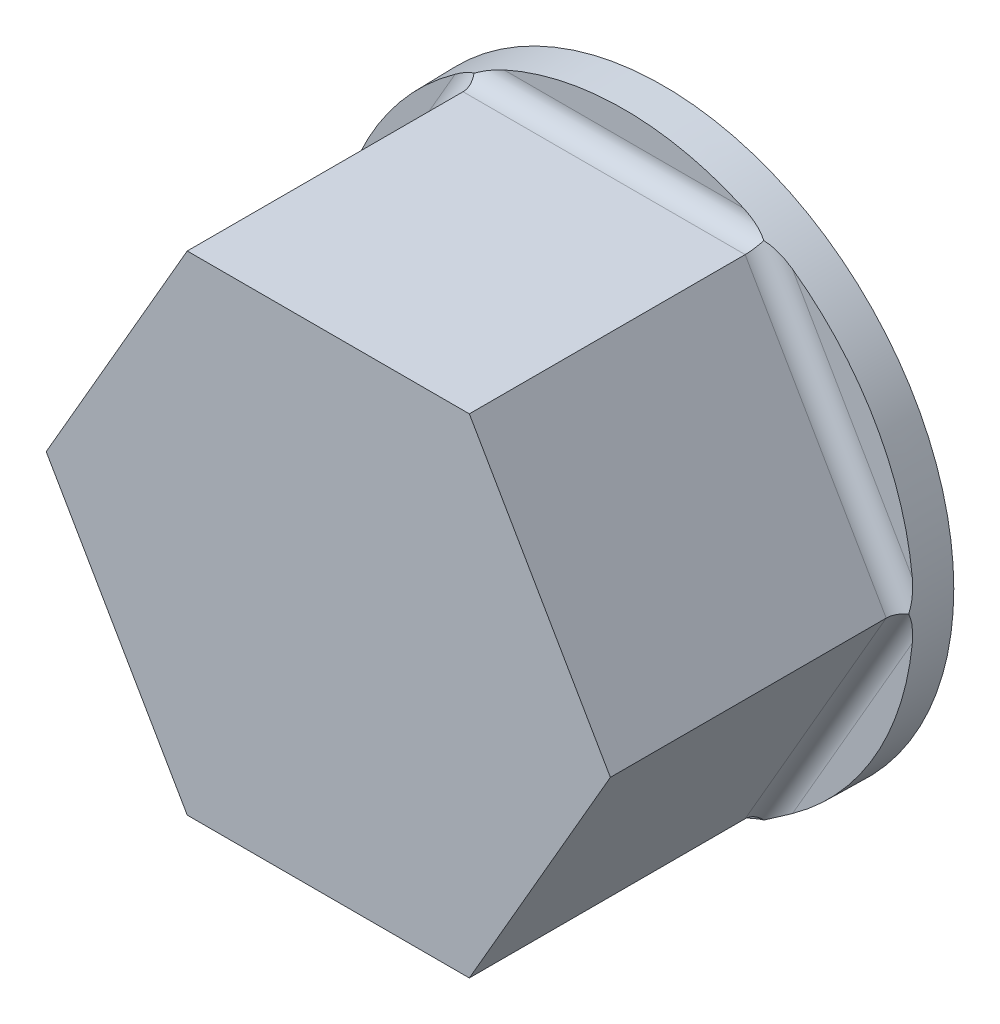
ISO-10303-21;
HEADER;
FILE_DESCRIPTION(('STEP AP214'),'2;1');
FILE_NAME('part.step','',(''),(''),'','','');
FILE_SCHEMA(('AUTOMOTIVE_DESIGN { 1 0 10303 214 1 1 1 1 }'));
ENDSEC;
DATA;
#1=APPLICATION_CONTEXT('core data for automotive mechanical design processes');
#2=APPLICATION_PROTOCOL_DEFINITION('international standard','automotive_design',2000,#1);
#3=PRODUCT_CONTEXT('',#1,'mechanical');
#4=PRODUCT('Part','Part','',(#3));
#5=PRODUCT_RELATED_PRODUCT_CATEGORY('part','',(#4));
#6=PRODUCT_DEFINITION_FORMATION('','',#4);
#7=PRODUCT_DEFINITION_CONTEXT('part definition',#1,'design');
#8=PRODUCT_DEFINITION('design','',#6,#7);
#9=PRODUCT_DEFINITION_SHAPE('','',#8);
#10=(LENGTH_UNIT() NAMED_UNIT(*) SI_UNIT(.MILLI.,.METRE.));
#11=(NAMED_UNIT(*) PLANE_ANGLE_UNIT() SI_UNIT($,.RADIAN.));
#12=(NAMED_UNIT(*) SI_UNIT($,.STERADIAN.) SOLID_ANGLE_UNIT());
#13=UNCERTAINTY_MEASURE_WITH_UNIT(LENGTH_MEASURE(1.E-05),#10,'distance_accuracy_value','');
#14=(GEOMETRIC_REPRESENTATION_CONTEXT(3) GLOBAL_UNCERTAINTY_ASSIGNED_CONTEXT((#13)) GLOBAL_UNIT_ASSIGNED_CONTEXT((#10,
#11,#12)) REPRESENTATION_CONTEXT('',''));
#15=CARTESIAN_POINT('',(0.,0.,0.));
#16=DIRECTION('',(0.,0.,1.));
#17=DIRECTION('',(1.,0.,0.));
#18=AXIS2_PLACEMENT_3D('',#15,#16,#17);
#19=CARTESIAN_POINT('',(417.592409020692,-78.74,3.17500000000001));
#20=DIRECTION('',(0.,1.,0.));
#21=DIRECTION('',(0.,0.,1.));
#22=AXIS2_PLACEMENT_3D('',#19,#20,#21);
#23=PLANE('',#22);
#24=CARTESIAN_POINT('',(-34.1067601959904,-78.74,26.2127999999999));
#25=DIRECTION('',(0.,-1.,0.));
#26=DIRECTION('',(0.,0.,-1.));
#27=AXIS2_PLACEMENT_3D('',#24,#25,#26);
#28=CIRCLE('',#27,2.0828);
#29=CARTESIAN_POINT('',(-34.1067601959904,-78.74,24.1299999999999));
#30=VERTEX_POINT('',#29);
#31=EDGE_CURVE('E215',#30,#30,#28,.T.);
#32=ORIENTED_EDGE('',*,*,#31,.F.);
#33=EDGE_LOOP('',(#32));
#34=FACE_BOUND('',#33,.T.);
#35=CARTESIAN_POINT('',(-34.1067601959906,-78.74,56.3371999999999));
#36=DIRECTION('',(0.,-1.,0.));
#37=DIRECTION('',(0.,0.,-1.));
#38=AXIS2_PLACEMENT_3D('',#35,#36,#37);
#39=CIRCLE('',#38,2.0828);
#40=CARTESIAN_POINT('',(-34.1067601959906,-78.74,54.2544));
#41=VERTEX_POINT('',#40);
#42=EDGE_CURVE('E227',#41,#41,#39,.T.);
#43=ORIENTED_EDGE('',*,*,#42,.F.);
#44=EDGE_LOOP('',(#43));
#45=FACE_BOUND('',#44,.T.);
#46=CARTESIAN_POINT('',(-3.98236019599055,-78.74,56.3372));
#47=DIRECTION('',(0.,-1.,0.));
#48=DIRECTION('',(0.,0.,-1.));
#49=AXIS2_PLACEMENT_3D('',#46,#47,#48);
#50=CIRCLE('',#49,2.0828);
#51=CARTESIAN_POINT('',(-3.98236019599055,-78.74,54.2544));
#52=VERTEX_POINT('',#51);
#53=EDGE_CURVE('E239',#52,#52,#50,.T.);
#54=ORIENTED_EDGE('',*,*,#53,.F.);
#55=EDGE_LOOP('',(#54));
#56=FACE_BOUND('',#55,.T.);
#57=CARTESIAN_POINT('',(-19.0445601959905,-78.74,41.275));
#58=DIRECTION('',(0.,-1.,0.));
#59=DIRECTION('',(0.,0.,-1.));
#60=AXIS2_PLACEMENT_3D('',#57,#58,#59);
#61=CIRCLE('',#60,12.7);
#62=CARTESIAN_POINT('',(-19.0445601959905,-78.74,28.575));
#63=VERTEX_POINT('',#62);
#64=EDGE_CURVE('E242',#63,#63,#61,.T.);
#65=ORIENTED_EDGE('',*,*,#64,.F.);
#66=EDGE_LOOP('',(#65));
#67=FACE_BOUND('',#66,.T.);
#68=CARTESIAN_POINT('',(9.27100000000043,-78.74,73.2789999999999));
#69=DIRECTION('',(0.,-1.,0.));
#70=DIRECTION('',(0.,0.,-1.));
#71=AXIS2_PLACEMENT_3D('',#68,#69,#70);
#72=CIRCLE('',#71,1.4986);
#73=CARTESIAN_POINT('',(9.27100000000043,-78.74,71.7803999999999));
#74=VERTEX_POINT('',#73);
#75=EDGE_CURVE('E248',#74,#74,#72,.T.);
#76=ORIENTED_EDGE('',*,*,#75,.F.);
#77=EDGE_LOOP('',(#76));
#78=FACE_BOUND('',#77,.T.);
#79=CARTESIAN_POINT('',(35.1790000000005,-78.74,73.2790000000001));
#80=DIRECTION('',(0.,-1.,0.));
#81=DIRECTION('',(0.,0.,-1.));
#82=AXIS2_PLACEMENT_3D('',#79,#80,#81);
#83=CIRCLE('',#82,1.4986);
#84=CARTESIAN_POINT('',(35.1790000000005,-78.74,71.7804000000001));
#85=VERTEX_POINT('',#84);
#86=EDGE_CURVE('E254',#85,#85,#83,.T.);
#87=ORIENTED_EDGE('',*,*,#86,.F.);
#88=EDGE_LOOP('',(#87));
#89=FACE_BOUND('',#88,.T.);
#90=CARTESIAN_POINT('',(35.1790000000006,-78.74,47.3710000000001));
#91=DIRECTION('',(0.,-1.,0.));
#92=DIRECTION('',(0.,0.,-1.));
#93=AXIS2_PLACEMENT_3D('',#90,#91,#92);
#94=CIRCLE('',#93,1.4986);
#95=CARTESIAN_POINT('',(35.1790000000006,-78.74,45.8724000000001));
#96=VERTEX_POINT('',#95);
#97=EDGE_CURVE('E260',#96,#96,#94,.T.);
#98=ORIENTED_EDGE('',*,*,#97,.F.);
#99=EDGE_LOOP('',(#98));
#100=FACE_BOUND('',#99,.T.);
#101=CARTESIAN_POINT('',(9.27100000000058,-78.74,47.371));
#102=DIRECTION('',(0.,-1.,0.));
#103=DIRECTION('',(0.,0.,-1.));
#104=AXIS2_PLACEMENT_3D('',#101,#102,#103);
#105=CIRCLE('',#104,1.4986);
#106=CARTESIAN_POINT('',(9.27100000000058,-78.74,45.8724));
#107=VERTEX_POINT('',#106);
#108=EDGE_CURVE('E266',#107,#107,#105,.T.);
#109=ORIENTED_EDGE('',*,*,#108,.F.);
#110=EDGE_LOOP('',(#109));
#111=FACE_BOUND('',#110,.T.);
#112=CARTESIAN_POINT('',(9.27100000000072,-78.7400000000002,9.27099999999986));
#113=DIRECTION('',(0.,-1.,0.));
#114=DIRECTION('',(0.,0.,-1.));
#115=AXIS2_PLACEMENT_3D('',#112,#113,#114);
#116=CIRCLE('',#115,1.4986);
#117=CARTESIAN_POINT('',(9.27100000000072,-78.7400000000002,7.77239999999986));
#118=VERTEX_POINT('',#117);
#119=EDGE_CURVE('E272',#118,#118,#116,.T.);
#120=ORIENTED_EDGE('',*,*,#119,.F.);
#121=EDGE_LOOP('',(#120));
#122=FACE_BOUND('',#121,.T.);
#123=CARTESIAN_POINT('',(9.27100000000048,-78.7400000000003,35.1789999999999));
#124=DIRECTION('',(0.,-1.,0.));
#125=DIRECTION('',(0.,0.,-1.));
#126=AXIS2_PLACEMENT_3D('',#123,#124,#125);
#127=CIRCLE('',#126,1.4986);
#128=CARTESIAN_POINT('',(9.27100000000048,-78.7400000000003,33.6803999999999));
#129=VERTEX_POINT('',#128);
#130=EDGE_CURVE('E278',#129,#129,#127,.T.);
#131=ORIENTED_EDGE('',*,*,#130,.F.);
#132=EDGE_LOOP('',(#131));
#133=FACE_BOUND('',#132,.T.);
#134=CARTESIAN_POINT('',(35.1790000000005,-78.7400000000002,35.179));
#135=DIRECTION('',(0.,-1.,0.));
#136=DIRECTION('',(0.,0.,-1.));
#137=AXIS2_PLACEMENT_3D('',#134,#135,#136);
#138=CIRCLE('',#137,1.4986);
#139=CARTESIAN_POINT('',(35.1790000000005,-78.7400000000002,33.6804));
#140=VERTEX_POINT('',#139);
#141=EDGE_CURVE('E284',#140,#140,#138,.T.);
#142=ORIENTED_EDGE('',*,*,#141,.F.);
#143=EDGE_LOOP('',(#142));
#144=FACE_BOUND('',#143,.T.);
#145=CARTESIAN_POINT('',(35.1790000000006,-78.7400000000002,9.271));
#146=DIRECTION('',(0.,-1.,0.));
#147=DIRECTION('',(0.,0.,-1.));
#148=AXIS2_PLACEMENT_3D('',#145,#146,#147);
#149=CIRCLE('',#148,1.4986);
#150=CARTESIAN_POINT('',(35.1790000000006,-78.7400000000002,7.77240000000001));
#151=VERTEX_POINT('',#150);
#152=EDGE_CURVE('E290',#151,#151,#149,.T.);
#153=ORIENTED_EDGE('',*,*,#152,.F.);
#154=EDGE_LOOP('',(#153));
#155=FACE_BOUND('',#154,.T.);
#156=CARTESIAN_POINT('',(22.2250000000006,-78.74,22.225));
#157=DIRECTION('',(0.,1.,0.));
#158=DIRECTION('',(0.,0.,1.));
#159=AXIS2_PLACEMENT_3D('',#156,#157,#158);
#160=CIRCLE('',#159,10.1601207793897);
#161=CARTESIAN_POINT('',(22.2250000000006,-78.74,32.3851207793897));
#162=VERTEX_POINT('',#161);
#163=EDGE_CURVE('E47',#162,#162,#160,.T.);
#164=ORIENTED_EDGE('',*,*,#163,.T.);
#165=EDGE_LOOP('',(#164));
#166=FACE_BOUND('',#165,.T.);
#167=CARTESIAN_POINT('',(22.2250000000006,-78.74,60.325));
#168=DIRECTION('',(0.,1.,0.));
#169=DIRECTION('',(0.,0.,1.));
#170=AXIS2_PLACEMENT_3D('',#167,#168,#169);
#171=CIRCLE('',#170,10.1601207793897);
#172=CARTESIAN_POINT('',(22.2250000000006,-78.74,70.4851207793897));
#173=VERTEX_POINT('',#172);
#174=EDGE_CURVE('E1124',#173,#173,#171,.T.);
#175=ORIENTED_EDGE('',*,*,#174,.T.);
#176=EDGE_LOOP('',(#175));
#177=FACE_BOUND('',#176,.T.);
#178=DIRECTION('',(-1.,0.,0.));
#179=VECTOR('',#178,1.);
#180=CARTESIAN_POINT('',(93.9799987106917,-78.74,92.075));
#181=LINE('',#180,#179);
#182=CARTESIAN_POINT('',(45.4605601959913,-78.74,92.075));
#183=VERTEX_POINT('',#182);
#184=CARTESIAN_POINT('',(-45.4605601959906,-78.74,92.075));
#185=VERTEX_POINT('',#184);
#186=EDGE_CURVE('E562',#183,#185,#181,.T.);
#187=ORIENTED_EDGE('',*,*,#186,.T.);
#188=DIRECTION('',(0.,0.,-1.));
#189=VECTOR('',#188,1.);
#190=CARTESIAN_POINT('',(-45.4605601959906,-78.74,3.17499999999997));
#191=LINE('',#190,#189);
#192=CARTESIAN_POINT('',(-45.4605601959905,-78.74,3.17500000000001));
#193=VERTEX_POINT('',#192);
#194=EDGE_CURVE('E472',#185,#193,#191,.T.);
#195=ORIENTED_EDGE('',*,*,#194,.T.);
#196=DIRECTION('',(-1.,0.,0.));
#197=VECTOR('',#196,1.);
#198=CARTESIAN_POINT('',(417.592409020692,-78.74,3.17500000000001));
#199=LINE('',#198,#197);
#200=CARTESIAN_POINT('',(45.4605601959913,-78.74,3.17500000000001));
#201=VERTEX_POINT('',#200);
#202=EDGE_CURVE('E551',#201,#193,#199,.T.);
#203=ORIENTED_EDGE('',*,*,#202,.F.);
#204=DIRECTION('',(0.,0.,1.));
#205=VECTOR('',#204,1.);
#206=CARTESIAN_POINT('',(45.4605601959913,-78.74,3.17500000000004));
#207=LINE('',#206,#205);
#208=EDGE_CURVE('E539',#201,#183,#207,.T.);
#209=ORIENTED_EDGE('',*,*,#208,.T.);
#210=EDGE_LOOP('',(#187,#195,#203,#209));
#211=FACE_BOUND('',#210,.T.);
#212=CARTESIAN_POINT('',(-3.98236019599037,-78.74,26.2128000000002));
#213=DIRECTION('',(0.,-1.,0.));
#214=DIRECTION('',(0.,0.,-1.));
#215=AXIS2_PLACEMENT_3D('',#212,#213,#214);
#216=CIRCLE('',#215,2.0828);
#217=CARTESIAN_POINT('',(-3.98236019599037,-78.74,24.1300000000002));
#218=VERTEX_POINT('',#217);
#219=EDGE_CURVE('E203',#218,#218,#216,.T.);
#220=ORIENTED_EDGE('',*,*,#219,.F.);
#221=EDGE_LOOP('',(#220));
#222=FACE_BOUND('',#221,.T.);
#223=ADVANCED_FACE('F34',(#34,#45,#56,#67,#78,#89,#100,#111,#122,#133,#144,#155,#166,#177,#211,
#222),#23,.F.);
#224=CARTESIAN_POINT('',(0.,79.3369,-15.875));
#225=DIRECTION('',(0.,0.,-1.));
#226=DIRECTION('',(-1.,0.,0.));
#227=AXIS2_PLACEMENT_3D('',#224,#225,#226);
#228=PLANE('',#227);
#229=CARTESIAN_POINT('',(0.,0.,-15.875));
#230=DIRECTION('',(0.,0.,1.));
#231=DIRECTION('',(1.,0.,0.));
#232=AXIS2_PLACEMENT_3D('',#229,#230,#231);
#233=CIRCLE('',#232,52.0954);
#234=CARTESIAN_POINT('',(52.0954,0.,-15.875));
#235=VERTEX_POINT('',#234);
#236=EDGE_CURVE('E298',#235,#235,#233,.T.);
#237=ORIENTED_EDGE('',*,*,#236,.T.);
#238=EDGE_LOOP('',(#237));
#239=FACE_BOUND('',#238,.T.);
#240=CARTESIAN_POINT('',(0.,0.,-15.875));
#241=DIRECTION('',(0.,0.,-1.));
#242=DIRECTION('',(-1.,0.,0.));
#243=AXIS2_PLACEMENT_3D('',#240,#241,#242);
#244=CIRCLE('',#243,93.6625);
#245=CARTESIAN_POINT('',(-93.6625,0.,-15.875));
#246=VERTEX_POINT('',#245);
#247=EDGE_CURVE('E560',#246,#246,#244,.T.);
#248=ORIENTED_EDGE('',*,*,#247,.T.);
#249=EDGE_LOOP('',(#248));
#250=FACE_BOUND('',#249,.T.);
#251=ADVANCED_FACE('F333',(#239,#250),#228,.T.);
#252=CARTESIAN_POINT('',(0.,0.,-15.875));
#253=DIRECTION('',(0.,0.,-1.));
#254=DIRECTION('',(-1.,0.,0.));
#255=AXIS2_PLACEMENT_3D('',#252,#253,#254);
#256=CONICAL_SURFACE('',#255,93.6625,0.0174532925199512);
#257=CARTESIAN_POINT('',(-93.3516962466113,2.50863443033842,0.000200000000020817));
#258=CARTESIAN_POINT('',(-93.3560191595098,2.40842118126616,-0.0930571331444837));
#259=CARTESIAN_POINT('',(-93.3601997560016,2.30533111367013,-0.183158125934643));
#260=CARTESIAN_POINT('',(-93.3682127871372,2.0942555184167,-0.357310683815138));
#261=CARTESIAN_POINT('',(-93.3720454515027,1.98627329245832,-0.441366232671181));
#262=CARTESIAN_POINT('',(-93.3792928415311,1.76650489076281,-0.603541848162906));
#263=CARTESIAN_POINT('',(-93.3827089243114,1.65473267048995,-0.681680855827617));
#264=CARTESIAN_POINT('',(-93.389092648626,1.42764269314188,-0.832666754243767));
#265=CARTESIAN_POINT('',(-93.3920602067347,1.31232428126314,-0.905512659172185));
#266=CARTESIAN_POINT('',(-93.4001514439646,0.965228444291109,-1.11454986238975));
#267=CARTESIAN_POINT('',(-93.4045709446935,0.729091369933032,-1.24357097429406));
#268=CARTESIAN_POINT('',(-93.4112953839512,0.248044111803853,-1.48458059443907));
#269=CARTESIAN_POINT('',(-93.4135979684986,0.00312447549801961,-1.59655002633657));
#270=CARTESIAN_POINT('',(-93.4157577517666,-0.454556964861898,-1.78902777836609));
#271=CARTESIAN_POINT('',(-93.4159391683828,-0.666406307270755,-1.87172155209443));
#272=CARTESIAN_POINT('',(-93.4146282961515,-1.09371343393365,-2.02723753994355));
#273=CARTESIAN_POINT('',(-93.4131357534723,-1.30917176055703,-2.10005825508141));
#274=CARTESIAN_POINT('',(-93.4084350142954,-1.74291800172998,-2.236694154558));
#275=CARTESIAN_POINT('',(-93.4052266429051,-1.96120620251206,-2.30050842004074));
#276=CARTESIAN_POINT('',(-93.3970668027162,-2.40000577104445,-2.41988167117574));
#277=CARTESIAN_POINT('',(-93.3921151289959,-2.62051739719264,-2.47543968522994));
#278=CARTESIAN_POINT('',(-93.3745031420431,-3.28888897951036,-2.631733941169));
#279=CARTESIAN_POINT('',(-93.3591294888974,-3.73943327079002,-2.72081355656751));
#280=CARTESIAN_POINT('',(-93.3211359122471,-4.64448126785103,-2.87252059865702));
#281=CARTESIAN_POINT('',(-93.2985164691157,-5.09898470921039,-2.93514977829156));
#282=CARTESIAN_POINT('',(-93.2460483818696,-6.01006012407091,-3.03742206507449));
#283=CARTESIAN_POINT('',(-93.21620062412,-6.46663183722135,-3.07706798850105));
#284=CARTESIAN_POINT('',(-93.1493255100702,-7.38060584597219,-3.13612201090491));
#285=CARTESIAN_POINT('',(-93.1122967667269,-7.83800828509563,-3.15552619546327));
#286=CARTESIAN_POINT('',(-93.0311186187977,-8.75289467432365,-3.17627627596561));
#287=CARTESIAN_POINT('',(-92.9869641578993,-9.2103784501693,-3.17760929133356));
#288=CARTESIAN_POINT('',(-92.8916576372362,-10.1243251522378,-3.16394962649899));
#289=CARTESIAN_POINT('',(-92.8405060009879,-10.5807881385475,-3.14895793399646));
#290=CARTESIAN_POINT('',(-92.731396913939,-11.4914643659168,-3.10410933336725));
#291=CARTESIAN_POINT('',(-92.6734496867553,-11.9456799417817,-3.07427454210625));
#292=CARTESIAN_POINT('',(-92.5508082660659,-12.8520843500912,-3.00088919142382));
#293=CARTESIAN_POINT('',(-92.4861139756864,-13.3042731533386,-2.95733843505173));
#294=CARTESIAN_POINT('',(-92.3501244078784,-14.206107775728,-2.8574302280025));
#295=CARTESIAN_POINT('',(-92.2788308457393,-14.65575422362,-2.80107609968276));
#296=CARTESIAN_POINT('',(-92.1297624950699,-15.5522791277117,-2.67622698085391));
#297=CARTESIAN_POINT('',(-92.0519876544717,-15.9991575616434,-2.60773189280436));
#298=CARTESIAN_POINT('',(-91.8986626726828,-16.8427122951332,-2.46691441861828));
#299=CARTESIAN_POINT('',(-91.8237469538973,-17.2397002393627,-2.39576265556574));
#300=CARTESIAN_POINT('',(-91.6689633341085,-18.030941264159,-2.2442776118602));
#301=CARTESIAN_POINT('',(-91.5890955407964,-18.4251944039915,-2.1639445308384));
#302=CARTESIAN_POINT('',(-91.4245547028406,-19.2105973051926,-1.99411677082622));
#303=CARTESIAN_POINT('',(-91.3398829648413,-19.6017478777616,-1.9046245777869));
#304=CARTESIAN_POINT('',(-91.1658555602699,-20.3807551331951,-1.71624736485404));
#305=CARTESIAN_POINT('',(-91.0764996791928,-20.768611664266,-1.61736191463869));
#306=CARTESIAN_POINT('',(-90.8937551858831,-21.5386234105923,-1.41025324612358));
#307=CARTESIAN_POINT('',(-90.8003896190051,-21.9207976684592,-1.30208054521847));
#308=CARTESIAN_POINT('',(-90.6094317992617,-22.6808916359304,-1.07513601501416));
#309=CARTESIAN_POINT('',(-90.5118400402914,-23.0588118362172,-0.956365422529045));
#310=CARTESIAN_POINT('',(-90.3624797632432,-23.6220398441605,-0.769136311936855));
#311=CARTESIAN_POINT('',(-90.3121780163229,-23.8092437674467,-0.705188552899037));
#312=CARTESIAN_POINT('',(-90.2106484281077,-24.1822409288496,-0.574008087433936));
#313=CARTESIAN_POINT('',(-90.1594206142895,-24.368034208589,-0.506775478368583));
#314=CARTESIAN_POINT('',(-90.056083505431,-24.738103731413,-0.36867585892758));
#315=CARTESIAN_POINT('',(-90.0039739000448,-24.9223794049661,-0.297807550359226));
#316=CARTESIAN_POINT('',(-89.8989779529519,-25.2891040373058,-0.151984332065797));
#317=CARTESIAN_POINT('',(-89.8460915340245,-25.4715528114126,-0.0770290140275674));
#318=CARTESIAN_POINT('',(-89.7928653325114,-25.6529486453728,0.000200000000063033));
#319=B_SPLINE_CURVE_WITH_KNOTS('',3,(#257,#258,#259,#260,#261,#262,#263,#264,#265,#266,#267,
#268,#269,#270,#271,#272,#273,#274,#275,#276,#277,#278,#279,#280,#281,#282,#283,#284,#285,#286,
#287,#288,#289,#290,#291,#292,#293,#294,#295,#296,#297,#298,#299,#300,#301,#302,#303,#304,#305,
#306,#307,#308,#309,#310,#311,#312,#313,#314,#315,#316,#317,#318),.UNSPECIFIED.,.F.,.F.,(4,2,2,
2,2,2,2,2,2,2,2,2,2,2,2,2,2,2,2,2,2,2,2,2,2,2,2,2,2,2,4),(0.,0.410745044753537,
0.821216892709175,1.23031362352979,1.63948635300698,2.44594724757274,3.25330383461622,
3.93528568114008,4.61737095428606,5.29952576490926,5.9817607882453,7.35923305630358,
8.73661402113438,10.1138261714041,11.4913046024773,12.8697648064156,14.2481416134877,
15.6244707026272,17.00081955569,18.3768116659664,19.7528148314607,20.9833130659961,
22.2137845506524,23.4439229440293,24.6741177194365,25.8980001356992,27.1217399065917,
27.7340722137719,28.3463863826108,28.9589207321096,29.5715163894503),.UNSPECIFIED.);
#320=CARTESIAN_POINT('',(-93.413239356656,-1.06260947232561E-12,-1.59486730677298));
#321=VERTEX_POINT('',#320);
#322=CARTESIAN_POINT('',(-92.9960519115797,-9.10611318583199,-3.17499999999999));
#323=VERTEX_POINT('',#322);
#324=EDGE_CURVE('E446',#321,#323,#319,.T.);
#325=ORIENTED_EDGE('',*,*,#324,.F.);
#326=CARTESIAN_POINT('',(-89.792865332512,25.6529486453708,0.000200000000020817));
#327=CARTESIAN_POINT('',(-89.8595759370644,25.4255997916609,-0.0965603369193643));
#328=CARTESIAN_POINT('',(-89.9257451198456,25.196620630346,-0.189787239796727));
#329=CARTESIAN_POINT('',(-90.0568242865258,24.735904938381,-0.370003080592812));
#330=CARTESIAN_POINT('',(-90.1217344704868,24.5041688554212,-0.456993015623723));
#331=CARTESIAN_POINT('',(-90.2501090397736,24.0384845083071,-0.625552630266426));
#332=CARTESIAN_POINT('',(-90.3135741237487,23.8045373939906,-0.707124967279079));
#333=CARTESIAN_POINT('',(-90.438986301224,23.3346013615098,-0.865433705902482));
#334=CARTESIAN_POINT('',(-90.5009333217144,23.0986123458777,-0.942169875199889));
#335=CARTESIAN_POINT('',(-90.6843245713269,22.3880845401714,-1.16572204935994));
#336=CARTESIAN_POINT('',(-90.8033607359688,21.9108336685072,-1.3059357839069));
#337=CARTESIAN_POINT('',(-91.034513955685,20.9503281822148,-1.57081692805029));
#338=CARTESIAN_POINT('',(-91.1466298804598,20.4670726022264,-1.69548180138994));
#339=CARTESIAN_POINT('',(-91.364826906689,19.4898251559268,-1.93157846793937));
#340=CARTESIAN_POINT('',(-91.4708237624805,18.9957737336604,-2.04284156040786));
#341=CARTESIAN_POINT('',(-91.6750740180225,18.0030568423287,-2.25079788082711));
#342=CARTESIAN_POINT('',(-91.773327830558,17.5043916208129,-2.34749188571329));
#343=CARTESIAN_POINT('',(-91.9618624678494,16.5029124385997,-2.52618031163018));
#344=CARTESIAN_POINT('',(-92.0521429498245,16.0000983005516,-2.60817410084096));
#345=CARTESIAN_POINT('',(-92.2245118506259,14.9908212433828,-2.75692254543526));
#346=CARTESIAN_POINT('',(-92.3066004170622,14.4843583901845,-2.82367747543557));
#347=CARTESIAN_POINT('',(-92.445582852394,13.5778951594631,-2.92838686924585));
#348=CARTESIAN_POINT('',(-92.5040915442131,13.178498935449,-2.9694477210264));
#349=CARTESIAN_POINT('',(-92.6158601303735,12.3780362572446,-3.04105367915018));
#350=CARTESIAN_POINT('',(-92.6691201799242,11.9769698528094,-3.07159909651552));
#351=CARTESIAN_POINT('',(-92.7703172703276,11.1733860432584,-3.12145244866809));
#352=CARTESIAN_POINT('',(-92.8182533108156,10.7708683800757,-3.14075827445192));
#353=CARTESIAN_POINT('',(-92.9087103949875,9.96481968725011,-3.16723300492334));
#354=CARTESIAN_POINT('',(-92.9512314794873,9.56128866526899,-3.17440200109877));
#355=CARTESIAN_POINT('',(-93.0307121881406,8.75438852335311,-3.17552545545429));
#356=CARTESIAN_POINT('',(-93.0676817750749,8.35102044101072,-3.16950389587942));
#357=CARTESIAN_POINT('',(-93.1360875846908,7.54424718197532,-3.14300139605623));
#358=CARTESIAN_POINT('',(-93.1675234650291,7.140842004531,-3.12251956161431));
#359=CARTESIAN_POINT('',(-93.2247841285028,6.33502913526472,-3.06554926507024));
#360=CARTESIAN_POINT('',(-93.2506128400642,5.93262094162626,-3.02907206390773));
#361=CARTESIAN_POINT('',(-93.2966450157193,5.12955237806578,-2.93821752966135));
#362=CARTESIAN_POINT('',(-93.3168496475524,4.72889166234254,-2.8838439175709));
#363=CARTESIAN_POINT('',(-93.3496473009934,3.97606904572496,-2.76219737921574));
#364=CARTESIAN_POINT('',(-93.3628453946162,3.62358423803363,-2.69710100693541));
#365=CARTESIAN_POINT('',(-93.3848413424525,2.92224158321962,-2.54899968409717));
#366=CARTESIAN_POINT('',(-93.3936395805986,2.57338342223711,-2.46599629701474));
#367=CARTESIAN_POINT('',(-93.4068538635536,1.88318083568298,-2.28019524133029));
#368=CARTESIAN_POINT('',(-93.4112969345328,1.5418030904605,-2.17752443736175));
#369=CARTESIAN_POINT('',(-93.4160101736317,0.866686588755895,-1.94903324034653));
#370=CARTESIAN_POINT('',(-93.4162800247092,0.532948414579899,-1.82321108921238));
#371=CARTESIAN_POINT('',(-93.4132942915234,-0.0397238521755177,-1.58011389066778));
#372=CARTESIAN_POINT('',(-93.4109175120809,-0.281190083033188,-1.46879774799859));
#373=CARTESIAN_POINT('',(-93.4041054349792,-0.75547592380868,-1.22941892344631));
#374=CARTESIAN_POINT('',(-93.3996722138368,-0.988304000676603,-1.10137322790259));
#375=CARTESIAN_POINT('',(-93.3916056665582,-1.33037150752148,-0.894229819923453));
#376=CARTESIAN_POINT('',(-93.3886569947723,-1.44390660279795,-0.822154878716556));
#377=CARTESIAN_POINT('',(-93.3823253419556,-1.6675059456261,-0.672844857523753));
#378=CARTESIAN_POINT('',(-93.3789424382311,-1.77757080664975,-0.595610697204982));
#379=CARTESIAN_POINT('',(-93.3717749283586,-1.99399514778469,-0.435410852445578));
#380=CARTESIAN_POINT('',(-93.367989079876,-2.10034174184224,-0.352427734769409));
#381=CARTESIAN_POINT('',(-93.3600804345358,-2.30827134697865,-0.180587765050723));
#382=CARTESIAN_POINT('',(-93.3559574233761,-2.40985126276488,-0.0917271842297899));
#383=CARTESIAN_POINT('',(-93.3516962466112,-2.50863443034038,0.00020000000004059));
#384=B_SPLINE_CURVE_WITH_KNOTS('',3,(#326,#327,#328,#329,#330,#331,#332,#333,#334,#335,#336,
#337,#338,#339,#340,#341,#342,#343,#344,#345,#346,#347,#348,#349,#350,#351,#352,#353,#354,#355,
#356,#357,#358,#359,#360,#361,#362,#363,#364,#365,#366,#367,#368,#369,#370,#371,#372,#373,#374,
#375,#376,#377,#378,#379,#380,#381,#382,#383),.UNSPECIFIED.,.F.,.F.,(4,2,2,2,2,2,2,2,2,2,2,2,2,
2,2,2,2,2,2,2,2,2,2,2,2,2,2,2,4),(0.,0.767719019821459,1.5353150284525,2.30253169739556,
3.06978519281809,4.60379447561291,6.13805365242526,7.68995999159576,9.24178354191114,
10.7936737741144,12.3455360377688,13.5626038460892,14.7796356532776,15.9968957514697,
17.2141466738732,18.4291863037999,19.644301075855,20.8585617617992,22.0725701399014,
23.148210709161,24.2237574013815,25.2925866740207,26.3614971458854,27.1586665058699,
27.9550326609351,28.3584531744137,28.7618019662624,29.1664324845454,29.571322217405),.UNSPECIFIED.);
#385=CARTESIAN_POINT('',(-92.9960519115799,9.10611318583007,-3.17499999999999));
#386=VERTEX_POINT('',#385);
#387=EDGE_CURVE('E440',#386,#321,#384,.T.);
#388=ORIENTED_EDGE('',*,*,#387,.F.);
#389=CARTESIAN_POINT('',(0.,0.,-3.17499999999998));
#390=DIRECTION('',(0.,0.,-1.));
#391=DIRECTION('',(-1.,0.,0.));
#392=AXIS2_PLACEMENT_3D('',#389,#390,#391);
#393=CIRCLE('',#392,93.4408206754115);
#394=CARTESIAN_POINT('',(-54.3841513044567,75.9838868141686,-3.17499999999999));
#395=VERTEX_POINT('',#394);
#396=EDGE_CURVE('E584',#395,#386,#393,.F.);
#397=ORIENTED_EDGE('',*,*,#396,.F.);
#398=CARTESIAN_POINT('',(-44.5033069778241,82.0992576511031,0.000200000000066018));
#399=CARTESIAN_POINT('',(-44.5922556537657,82.0528947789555,-0.0930571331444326));
#400=CARTESIAN_POINT('',(-44.6836245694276,82.0049702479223,-0.1831581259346));
#401=CARTESIAN_POINT('',(-44.8704279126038,81.9063719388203,-0.357310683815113));
#402=CARTESIAN_POINT('',(-44.9658595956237,81.8557000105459,-0.441366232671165));
#403=CARTESIAN_POINT('',(-45.1598083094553,81.7520922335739,-0.603541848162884));
#404=CARTESIAN_POINT('',(-45.2583139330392,81.6991645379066,-0.68168085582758));
#405=CARTESIAN_POINT('',(-45.4581714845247,81.5911480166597,-0.832666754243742));
#406=CARTESIAN_POINT('',(-45.5595239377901,81.5360587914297,-0.905512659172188));
#407=CARTESIAN_POINT('',(-45.8641633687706,81.3695180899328,-1.1145498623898));
#408=CARTESIAN_POINT('',(-46.0708738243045,81.2552769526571,-1.24357097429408));
#409=CARTESIAN_POINT('',(-46.4908351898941,81.0205768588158,-1.48458059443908));
#410=CARTESIAN_POINT('',(-46.7040931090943,80.9001111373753,-1.59655002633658));
#411=CARTESIAN_POINT('',(-47.1015367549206,80.6731408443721,-1.78902777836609));
#412=CARTESIAN_POINT('',(-47.2850943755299,80.567373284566,-1.87172155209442));
#413=CARTESIAN_POINT('',(-47.6544977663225,80.3525844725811,-2.02723753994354));
#414=CARTESIAN_POINT('',(-47.8403438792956,80.243562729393,-2.10005825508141));
#415=CARTESIAN_POINT('',(-48.213628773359,80.0226186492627,-2.23669415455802));
#416=CARTESIAN_POINT('',(-48.4010677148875,79.9106960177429,-2.30050842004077));
#417=CARTESIAN_POINT('',(-48.7769993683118,79.6842296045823,-2.41988167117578));
#418=CARTESIAN_POINT('',(-48.9654922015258,79.5696855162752,-2.47543968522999));
#419=CARTESIAN_POINT('',(-49.5355129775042,79.220247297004,-2.63173394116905));
#420=CARTESIAN_POINT('',(-49.9180089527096,78.981661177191,-2.72081355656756));
#421=CARTESIAN_POINT('',(-50.6828067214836,78.4962337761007,-2.87252059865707));
#422=CARTESIAN_POINT('',(-51.0651085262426,78.2493930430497,-2.93514977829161));
#423=CARTESIAN_POINT('',(-51.8278889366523,77.7484166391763,-3.03742206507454));
#424=CARTESIAN_POINT('',(-52.2083677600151,77.4942818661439,-3.07706798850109));
#425=CARTESIAN_POINT('',(-52.9664549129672,76.9793793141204,-3.13612201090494));
#426=CARTESIAN_POINT('',(-53.3440626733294,76.7186102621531,-3.1555261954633));
#427=CARTESIAN_POINT('',(-54.095788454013,76.1908647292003,-3.17627627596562));
#428=CARTESIAN_POINT('',(-54.4699037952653,75.923883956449,-3.17760929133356));
#429=CARTESIAN_POINT('',(-55.2137515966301,75.3843727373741,-3.16394962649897));
#430=CARTESIAN_POINT('',(-55.5834843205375,75.1118426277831,-3.14895793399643));
#431=CARTESIAN_POINT('',(-56.3175985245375,74.5620132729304,-3.1041093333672));
#432=CARTESIAN_POINT('',(-56.6819871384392,74.284721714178,-3.07427454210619));
#433=CARTESIAN_POINT('',(-57.4056356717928,73.7253089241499,-3.00088919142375));
#434=CARTESIAN_POINT('',(-57.7648955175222,73.4431876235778,-2.95733843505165));
#435=CARTESIAN_POINT('',(-58.4779124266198,72.8744998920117,-2.8574302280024));
#436=CARTESIAN_POINT('',(-58.8316708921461,72.5879346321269,-2.80107609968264));
#437=CARTESIAN_POINT('',(-59.5335500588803,72.010575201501,-2.67622698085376));
#438=CARTESIAN_POINT('',(-59.8816707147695,71.7197809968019,-2.60773189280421));
#439=CARTESIAN_POINT('',(-60.5355480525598,71.165220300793,-2.46691441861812));
#440=CARTESIAN_POINT('',(-60.8418918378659,70.9018474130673,-2.39576265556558));
#441=CARTESIAN_POINT('',(-61.4497348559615,70.3721803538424,-2.24427761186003));
#442=CARTESIAN_POINT('',(-61.7512341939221,70.1058862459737,-2.16394453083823));
#443=CARTESIAN_POINT('',(-62.3491426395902,69.5706882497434,-1.99411677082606));
#444=CARTESIAN_POINT('',(-62.6455531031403,69.301785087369,-1.90462457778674));
#445=CARTESIAN_POINT('',(-63.2331794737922,68.7615693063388,-1.71624736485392));
#446=CARTESIAN_POINT('',(-63.5243951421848,68.4902565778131,-1.61736191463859));
#447=CARTESIAN_POINT('',(-64.0998726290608,67.9469893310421,-1.41025324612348));
#448=CARTESIAN_POINT('',(-64.384162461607,67.6750452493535,-1.30208054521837));
#449=CARTESIAN_POINT('',(-64.9469442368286,67.1296239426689,-1.07513601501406));
#450=CARTESIAN_POINT('',(-65.2254368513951,66.8561469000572,-0.956365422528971));
#451=CARTESIAN_POINT('',(-65.6385264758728,66.4451831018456,-0.769136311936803));
#452=CARTESIAN_POINT('',(-65.7754989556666,66.3080185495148,-0.705188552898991));
#453=CARTESIAN_POINT('',(-66.0477591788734,66.0335927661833,-0.57400808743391));
#454=CARTESIAN_POINT('',(-66.183046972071,65.8963315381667,-0.506775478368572));
#455=CARTESIAN_POINT('',(-66.4518680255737,65.6218042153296,-0.368675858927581));
#456=CARTESIAN_POINT('',(-66.5854006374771,65.4845381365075,-0.297807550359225));
#457=CARTESIAN_POINT('',(-66.8504955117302,65.2102466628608,-0.151984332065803));
#458=CARTESIAN_POINT('',(-66.9820575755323,65.0732212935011,-0.0770290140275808));
#459=CARTESIAN_POINT('',(-67.1125378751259,64.9364281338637,0.000200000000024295));
#460=B_SPLINE_CURVE_WITH_KNOTS('',3,(#398,#399,#400,#401,#402,#403,#404,#405,#406,#407,#408,
#409,#410,#411,#412,#413,#414,#415,#416,#417,#418,#419,#420,#421,#422,#423,#424,#425,#426,#427,
#428,#429,#430,#431,#432,#433,#434,#435,#436,#437,#438,#439,#440,#441,#442,#443,#444,#445,#446,
#447,#448,#449,#450,#451,#452,#453,#454,#455,#456,#457,#458,#459),.UNSPECIFIED.,.F.,.F.,(4,2,2,
2,2,2,2,2,2,2,2,2,2,2,2,2,2,2,2,2,2,2,2,2,2,2,2,2,2,2,4),(0.,0.410745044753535,
0.821216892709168,1.23031362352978,1.63948635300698,2.44594724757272,3.2533038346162,
3.93528568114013,4.61737095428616,5.29952576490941,5.98176078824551,7.35923305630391,
8.73661402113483,10.1138261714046,11.4913046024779,12.8697648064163,14.2481416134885,
15.624470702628,17.0008195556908,18.3768116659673,19.7528148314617,20.9833130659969,
22.2137845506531,23.4439229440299,24.674117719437,25.8980001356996,27.121739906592,
27.7340722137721,28.3463863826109,28.9589207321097,29.5715163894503),.UNSPECIFIED.);
#461=CARTESIAN_POINT('',(-46.7066196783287,80.8982383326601,-1.59486730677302));
#462=VERTEX_POINT('',#461);
#463=EDGE_CURVE('E433',#462,#395,#460,.T.);
#464=ORIENTED_EDGE('',*,*,#463,.F.);
#465=CARTESIAN_POINT('',(-38.6114598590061,85.0902000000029,-3.17499999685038));
#466=CARTESIAN_POINT('',(-38.9549960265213,84.934317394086,-3.17496841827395));
#467=CARTESIAN_POINT('',(-39.2975827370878,84.7762387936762,-3.16926648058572));
#468=CARTESIAN_POINT('',(-39.9805082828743,84.4558534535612,-3.14530895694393));
#469=CARTESIAN_POINT('',(-40.3208460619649,84.2935448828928,-3.12704784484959));
#470=CARTESIAN_POINT('',(-41.0016814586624,83.9635177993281,-3.07652988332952));
#471=CARTESIAN_POINT('',(-41.3421527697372,83.7957636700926,-3.04414814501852));
#472=CARTESIAN_POINT('',(-42.0194129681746,83.4566377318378,-2.96381149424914));
#473=CARTESIAN_POINT('',(-42.3562022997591,83.2852663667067,-2.91585848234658));
#474=CARTESIAN_POINT('',(-43.0069604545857,82.9488402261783,-2.80559644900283));
#475=CARTESIAN_POINT('',(-43.3211708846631,82.7839517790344,-2.74421474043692));
#476=CARTESIAN_POINT('',(-43.9444737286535,82.4519983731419,-2.60392062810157));
#477=CARTESIAN_POINT('',(-44.2535668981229,82.284933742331,-2.52501083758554));
#478=CARTESIAN_POINT('',(-44.8642999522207,81.9500063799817,-2.3475674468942));
#479=CARTESIAN_POINT('',(-45.1659607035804,81.7821479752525,-2.24909811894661));
#480=CARTESIAN_POINT('',(-45.7609533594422,81.4463153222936,-2.02945481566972));
#481=CARTESIAN_POINT('',(-46.0542857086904,81.2783410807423,-1.90828205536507));
#482=CARTESIAN_POINT('',(-46.5696977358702,80.9790298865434,-1.66764185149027));
#483=CARTESIAN_POINT('',(-46.7938753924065,80.8473604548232,-1.5530926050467));
#484=CARTESIAN_POINT('',(-47.2331557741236,80.5864950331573,-1.30532507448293));
#485=CARTESIAN_POINT('',(-47.448263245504,80.4572977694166,-1.17211671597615));
#486=CARTESIAN_POINT('',(-47.7641811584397,80.2654661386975,-0.954884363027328));
#487=CARTESIAN_POINT('',(-47.8694142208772,80.2011961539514,-0.878689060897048));
#488=CARTESIAN_POINT('',(-48.0762463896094,80.0741597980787,-0.720400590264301));
#489=CARTESIAN_POINT('',(-48.1778466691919,80.0113929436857,-0.638309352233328));
#490=CARTESIAN_POINT('',(-48.3772229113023,79.8875170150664,-0.467506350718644));
#491=CARTESIAN_POINT('',(-48.4749831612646,79.826415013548,-0.378770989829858));
#492=CARTESIAN_POINT('',(-48.6655913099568,79.7065877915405,-0.194483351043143));
#493=CARTESIAN_POINT('',(-48.7584347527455,79.647864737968,-0.0989250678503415));
#494=CARTESIAN_POINT('',(-48.8483892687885,79.5906232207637,0.000200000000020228));
#495=B_SPLINE_CURVE_WITH_KNOTS('',3,(#465,#466,#467,#468,#469,#470,#471,#472,#473,#474,#475,
#476,#477,#478,#479,#480,#481,#482,#483,#484,#485,#486,#487,#488,#489,#490,#491,#492,#493,#494),
.UNSPECIFIED.,.F.,.F.,(4,2,2,2,2,2,2,2,2,2,2,2,2,2,4),(0.,1.13175965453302,2.26401761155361,
3.40649956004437,4.54884211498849,5.62878249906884,6.70856198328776,7.78485034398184,
8.86108112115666,9.71278329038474,10.5640341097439,10.9987407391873,11.4333056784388,
11.8694947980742,12.3060726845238),.UNSPECIFIED.);
#496=CARTESIAN_POINT('',(-38.6119006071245,85.0899999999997,-3.17499999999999));
#497=VERTEX_POINT('',#496);
#498=EDGE_CURVE('E426',#497,#462,#495,.T.);
#499=ORIENTED_EDGE('',*,*,#498,.F.);
#500=CARTESIAN_POINT('',(0.,0.,-3.17499999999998));
#501=DIRECTION('',(0.,0.,-1.));
#502=DIRECTION('',(0.,1.,0.));
#503=AXIS2_PLACEMENT_3D('',#500,#501,#502);
#504=CIRCLE('',#503,93.4408206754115);
#505=CARTESIAN_POINT('',(38.6119006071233,85.0900000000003,-3.17499999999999));
#506=VERTEX_POINT('',#505);
#507=EDGE_CURVE('E580',#506,#497,#504,.F.);
#508=ORIENTED_EDGE('',*,*,#507,.F.);
#509=CARTESIAN_POINT('',(48.8483892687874,79.5906232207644,0.000200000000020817));
#510=CARTESIAN_POINT('',(48.7637974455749,79.6444519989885,-0.0930197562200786));
#511=CARTESIAN_POINT('',(48.6766450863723,79.6995949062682,-0.18308590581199));
#512=CARTESIAN_POINT('',(48.4979299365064,79.8120254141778,-0.357173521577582));
#513=CARTESIAN_POINT('',(48.4063701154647,79.8693115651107,-0.441198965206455));
#514=CARTESIAN_POINT('',(48.2197476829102,79.9854241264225,-0.60332043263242));
#515=CARTESIAN_POINT('',(48.1246977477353,80.0442447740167,-0.681435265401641));
#516=CARTESIAN_POINT('',(47.9313050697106,80.1632698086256,-0.832376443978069));
#517=CARTESIAN_POINT('',(47.8329617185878,80.2234744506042,-0.90520180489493));
#518=CARTESIAN_POINT('',(47.5363852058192,80.40404985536,-1.11429148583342));
#519=CARTESIAN_POINT('',(47.3340178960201,80.5259933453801,-1.24337527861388));
#520=CARTESIAN_POINT('',(46.9206239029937,80.7724361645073,-1.48449372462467));
#521=CARTESIAN_POINT('',(46.7095879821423,80.8969381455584,-1.59650955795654));
#522=CARTESIAN_POINT('',(46.3142862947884,81.127659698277,-1.78899597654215));
#523=CARTESIAN_POINT('',(46.1309771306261,81.233703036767,-1.87166186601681));
#524=CARTESIAN_POINT('',(45.7603993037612,81.4461445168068,-2.02712895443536));
#525=CARTESIAN_POINT('',(45.5731300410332,81.5525427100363,-2.09992864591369));
#526=CARTESIAN_POINT('',(45.1952754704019,81.7652738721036,-2.23653188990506));
#527=CARTESIAN_POINT('',(45.0046896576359,81.8716068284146,-2.30033405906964));
#528=CARTESIAN_POINT('',(44.6207224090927,82.0838752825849,-2.41968748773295));
#529=CARTESIAN_POINT('',(44.4273406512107,82.1898107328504,-2.47523778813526));
#530=CARTESIAN_POINT('',(43.8396146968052,82.5088026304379,-2.63159004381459));
#531=CARTESIAN_POINT('',(43.4415851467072,82.7208498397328,-2.72071829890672));
#532=CARTESIAN_POINT('',(42.6385244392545,83.1406147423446,-2.87249114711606));
#533=CARTESIAN_POINT('',(42.2334949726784,83.3483334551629,-2.93514204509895));
#534=CARTESIAN_POINT('',(41.5596666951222,83.687293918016,-3.01966801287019));
#535=CARTESIAN_POINT('',(41.2924218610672,83.8200354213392,-3.04814749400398));
#536=CARTESIAN_POINT('',(40.7559686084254,84.0831125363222,-3.09608896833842));
#537=CARTESIAN_POINT('',(40.4867603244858,84.2134483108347,-3.11555157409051));
#538=CARTESIAN_POINT('',(39.9506431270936,84.4696702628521,-3.14592531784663));
#539=CARTESIAN_POINT('',(39.6837587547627,84.5955937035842,-3.15695819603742));
#540=CARTESIAN_POINT('',(39.1486001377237,84.8448573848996,-3.1714907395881));
#541=CARTESIAN_POINT('',(38.8803259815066,84.9681977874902,-3.17499087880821));
#542=CARTESIAN_POINT('',(38.6114598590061,85.0902000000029,-3.17499999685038));
#543=B_SPLINE_CURVE_WITH_KNOTS('',3,(#509,#510,#511,#512,#513,#514,#515,#516,#517,#518,#519,
#520,#521,#522,#523,#524,#525,#526,#527,#528,#529,#530,#531,#532,#533,#534,#535,#536,#537,#538,
#539,#540,#541,#542),.UNSPECIFIED.,.F.,.F.,(4,2,2,2,2,2,2,2,2,2,2,2,2,2,2,2,4),(0.,
0.410580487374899,0.820888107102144,1.22982972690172,1.63884729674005,2.44563379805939,
3.25330355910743,3.93503936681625,4.61687922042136,5.29882379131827,5.98084756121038,
7.35889467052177,8.73661345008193,9.63572399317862,10.5347734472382,11.420579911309,
12.3063306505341),.UNSPECIFIED.);
#544=CARTESIAN_POINT('',(46.7066196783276,80.8982383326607,-1.59486730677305));
#545=VERTEX_POINT('',#544);
#546=EDGE_CURVE('E418',#545,#506,#543,.T.);
#547=ORIENTED_EDGE('',*,*,#546,.F.);
#548=CARTESIAN_POINT('',(67.112537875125,64.9364281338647,0.000200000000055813));
#549=CARTESIAN_POINT('',(66.9490032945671,65.1078756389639,-0.0965603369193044));
#550=CARTESIAN_POINT('',(66.7837861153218,65.2796694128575,-0.189787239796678));
#551=CARTESIAN_POINT('',(66.450334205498,65.623545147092,-0.370003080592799));
#552=CARTESIAN_POINT('',(66.2820999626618,65.7956270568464,-0.456993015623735));
#553=CARTESIAN_POINT('',(65.9429927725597,66.1396448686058,-0.625552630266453));
#554=CARTESIAN_POINT('',(65.7721211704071,66.3115808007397,-0.707124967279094));
#555=CARTESIAN_POINT('',(65.4278507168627,66.6551589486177,-0.865433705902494));
#556=CARTESIAN_POINT('',(65.2544517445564,66.8268011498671,-0.942169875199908));
#557=CARTESIAN_POINT('',(64.7308122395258,67.3408865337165,-1.16572204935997));
#558=CARTESIAN_POINT('',(64.3770189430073,67.6826003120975,-1.3059357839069));
#559=CARTESIAN_POINT('',(63.6607734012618,68.3630376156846,-1.57081692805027));
#560=CARTESIAN_POINT('',(63.2983197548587,68.7017606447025,-1.69548180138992));
#561=CARTESIAN_POINT('',(62.5610971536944,69.3793485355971,-1.93157846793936));
#562=CARTESIAN_POINT('',(62.1862344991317,69.718170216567,-2.04284156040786));
#563=CARTESIAN_POINT('',(61.4286415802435,70.3914145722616,-2.25079788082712));
#564=CARTESIAN_POINT('',(61.0459117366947,70.7258374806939,-2.34749188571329));
#565=CARTESIAN_POINT('',(60.2728726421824,71.3898528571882,-2.52618031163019));
#566=CARTESIAN_POINT('',(59.8825630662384,71.7194451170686,-2.60817410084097));
#567=CARTESIAN_POINT('',(59.0946879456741,72.3733594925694,-2.75692254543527));
#568=CARTESIAN_POINT('',(58.6971225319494,72.6976817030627,-2.82367747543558));
#569=CARTESIAN_POINT('',(57.9815935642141,73.2712756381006,-2.92838686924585));
#570=CARTESIAN_POINT('',(57.6649606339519,73.5216437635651,-2.96944772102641));
#571=CARTESIAN_POINT('',(57.0276239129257,74.0186695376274,-3.04105367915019));
#572=CARTESIAN_POINT('',(56.7069202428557,74.2653272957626,-3.07159909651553));
#573=CARTESIAN_POINT('',(56.0615947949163,74.7547584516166,-3.1214524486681));
#574=CARTESIAN_POINT('',(55.7369722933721,74.9975311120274,-3.14075827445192));
#575=CARTESIAN_POINT('',(55.0841421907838,75.4788935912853,-3.16723300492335));
#576=CARTESIAN_POINT('',(54.755934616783,75.7174834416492,-3.17440200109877));
#577=CARTESIAN_POINT('',(54.0968789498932,76.1897658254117,-3.17552545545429));
#578=CARTESIAN_POINT('',(53.7660367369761,76.4234664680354,-3.16950389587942));
#579=CARTESIAN_POINT('',(53.1015535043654,76.8860942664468,-3.14300139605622));
#580=CARTESIAN_POINT('',(52.7679123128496,77.1150211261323,-3.1225195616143));
#581=CARTESIAN_POINT('',(52.0986882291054,77.5675167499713,-3.06554926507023));
#582=CARTESIAN_POINT('',(51.7631068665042,77.7910891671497,-3.02907206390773));
#583=CARTESIAN_POINT('',(51.0906451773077,78.2324884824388,-2.93821752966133));
#584=CARTESIAN_POINT('',(50.7537651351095,78.450316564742,-2.88384391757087));
#585=CARTESIAN_POINT('',(50.1182004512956,78.8551314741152,-2.76219737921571));
#586=CARTESIAN_POINT('',(49.8195387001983,79.0428037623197,-2.69710100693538));
#587=CARTESIAN_POINT('',(49.2231561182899,79.4125241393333,-2.54899968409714));
#588=CARTESIAN_POINT('',(48.9254352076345,79.5945727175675,-2.46599629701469));
#589=CARTESIAN_POINT('',(48.3343093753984,79.9511179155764,-2.28019524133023));
#590=CARTESIAN_POINT('',(48.0408891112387,80.1256546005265,-2.17752443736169));
#591=CARTESIAN_POINT('',(47.4585776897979,80.4672946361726,-1.94903324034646));
#592=CARTESIAN_POINT('',(47.1696868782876,80.6343974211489,-1.8232110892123));
#593=CARTESIAN_POINT('',(46.6722452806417,80.9181478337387,-1.58011389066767));
#594=CARTESIAN_POINT('',(46.4619410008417,81.0368225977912,-1.46879774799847));
#595=CARTESIAN_POINT('',(46.0477913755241,81.2680660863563,-1.22941892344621));
#596=CARTESIAN_POINT('',(45.8439397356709,81.3806408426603,-1.10137322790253));
#597=CARTESIAN_POINT('',(45.5436673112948,81.5446887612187,-0.894229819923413));
#598=CARTESIAN_POINT('',(45.4438686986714,81.598902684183,-0.822154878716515));
#599=CARTESIAN_POINT('',(45.2470601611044,81.7052189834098,-0.672844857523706));
#600=CARTESIAN_POINT('',(45.1500497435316,81.7573217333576,-0.595610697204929));
#601=CARTESIAN_POINT('',(44.9590370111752,81.8593266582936,-0.435410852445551));
#602=CARTESIAN_POINT('',(44.8650452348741,81.9092213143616,-0.352427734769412));
#603=CARTESIAN_POINT('',(44.681018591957,82.0063370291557,-0.180587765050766));
#604=CARTESIAN_POINT('',(44.590986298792,82.0535563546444,-0.0917271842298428));
#605=CARTESIAN_POINT('',(44.5033069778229,82.0992576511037,0.000200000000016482));
#606=B_SPLINE_CURVE_WITH_KNOTS('',3,(#548,#549,#550,#551,#552,#553,#554,#555,#556,#557,#558,
#559,#560,#561,#562,#563,#564,#565,#566,#567,#568,#569,#570,#571,#572,#573,#574,#575,#576,#577,
#578,#579,#580,#581,#582,#583,#584,#585,#586,#587,#588,#589,#590,#591,#592,#593,#594,#595,#596,
#597,#598,#599,#600,#601,#602,#603,#604,#605),.UNSPECIFIED.,.F.,.F.,(4,2,2,2,2,2,2,2,2,2,2,2,2,
2,2,2,2,2,2,2,2,2,2,2,2,2,2,2,4),(0.,0.767719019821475,1.5353150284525,2.30253169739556,
3.06978519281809,4.60379447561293,6.1380536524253,7.68995999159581,9.24178354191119,
10.7936737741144,12.3455360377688,13.5626038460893,14.7796356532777,15.9968957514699,
17.2141466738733,18.4291863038,19.6443010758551,20.8585617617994,22.0725701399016,
23.1482107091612,24.2237574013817,25.2925866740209,26.3614971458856,27.15866650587,
27.9550326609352,28.3584531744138,28.7618019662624,29.1664324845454,29.5713222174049),.UNSPECIFIED.);
#607=CARTESIAN_POINT('',(54.3841513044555,75.9838868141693,-3.17499999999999));
#608=VERTEX_POINT('',#607);
#609=EDGE_CURVE('E411',#608,#545,#606,.T.);
#610=ORIENTED_EDGE('',*,*,#609,.F.);
#611=CARTESIAN_POINT('',(0.,0.,-3.17499999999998));
#612=DIRECTION('',(0.,0.,-1.));
#613=DIRECTION('',(-1.,0.,0.));
#614=AXIS2_PLACEMENT_3D('',#611,#612,#613);
#615=CIRCLE('',#614,93.4408206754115);
#616=CARTESIAN_POINT('',(92.9960519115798,9.1061131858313,-3.17499999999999));
#617=VERTEX_POINT('',#616);
#618=EDGE_CURVE('E576',#617,#608,#615,.F.);
#619=ORIENTED_EDGE('',*,*,#618,.F.);
#620=CARTESIAN_POINT('',(93.3516962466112,-2.50863443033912,0.000200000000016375));
#621=CARTESIAN_POINT('',(93.3560191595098,-2.40842118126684,-0.0930571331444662));
#622=CARTESIAN_POINT('',(93.3601997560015,-2.30533111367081,-0.183158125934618));
#623=CARTESIAN_POINT('',(93.3682127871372,-2.09425551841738,-0.357310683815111));
#624=CARTESIAN_POINT('',(93.3720454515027,-1.986273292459,-0.441366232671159));
#625=CARTESIAN_POINT('',(93.3792928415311,-1.7665048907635,-0.603541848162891));
#626=CARTESIAN_POINT('',(93.3827089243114,-1.65473267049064,-0.681680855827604));
#627=CARTESIAN_POINT('',(93.389092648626,-1.42764269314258,-0.832666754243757));
#628=CARTESIAN_POINT('',(93.3920602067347,-1.31232428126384,-0.905512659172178));
#629=CARTESIAN_POINT('',(93.4001514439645,-0.965228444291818,-1.11454986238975));
#630=CARTESIAN_POINT('',(93.4045709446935,-0.729091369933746,-1.24357097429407));
#631=CARTESIAN_POINT('',(93.4112953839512,-0.24804411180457,-1.48458059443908));
#632=CARTESIAN_POINT('',(93.4135979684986,-0.00312447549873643,-1.59655002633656));
#633=CARTESIAN_POINT('',(93.4157577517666,0.454556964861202,-1.78902777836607));
#634=CARTESIAN_POINT('',(93.4159391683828,0.666406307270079,-1.87172155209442));
#635=CARTESIAN_POINT('',(93.4146282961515,1.09371343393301,-2.02723753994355));
#636=CARTESIAN_POINT('',(93.4131357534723,1.3091717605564,-2.10005825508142));
#637=CARTESIAN_POINT('',(93.4084350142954,1.74291800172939,-2.23669415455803));
#638=CARTESIAN_POINT('',(93.4052266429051,1.96120620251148,-2.30050842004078));
#639=CARTESIAN_POINT('',(93.3970668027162,2.40000577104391,-2.41988167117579));
#640=CARTESIAN_POINT('',(93.3921151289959,2.62051739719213,-2.47543968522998));
#641=CARTESIAN_POINT('',(93.3745031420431,3.28888897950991,-2.63173394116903));
#642=CARTESIAN_POINT('',(93.3591294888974,3.7394332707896,-2.72081355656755));
#643=CARTESIAN_POINT('',(93.3211359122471,4.64448126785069,-2.87252059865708));
#644=CARTESIAN_POINT('',(93.2985164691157,5.09898470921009,-2.93514977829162));
#645=CARTESIAN_POINT('',(93.2460483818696,6.01006012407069,-3.03742206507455));
#646=CARTESIAN_POINT('',(93.21620062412,6.46663183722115,-3.07706798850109));
#647=CARTESIAN_POINT('',(93.1493255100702,7.38060584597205,-3.13612201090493));
#648=CARTESIAN_POINT('',(93.1122967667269,7.83800828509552,-3.1555261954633));
#649=CARTESIAN_POINT('',(93.0311186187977,8.75289467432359,-3.17627627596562));
#650=CARTESIAN_POINT('',(92.9869641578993,9.21037845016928,-3.17760929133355));
#651=CARTESIAN_POINT('',(92.8916576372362,10.1243251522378,-3.16394962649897));
#652=CARTESIAN_POINT('',(92.8405060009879,10.5807881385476,-3.14895793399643));
#653=CARTESIAN_POINT('',(92.731396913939,11.4914643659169,-3.1041093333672));
#654=CARTESIAN_POINT('',(92.6734496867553,11.9456799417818,-3.07427454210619));
#655=CARTESIAN_POINT('',(92.5508082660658,12.8520843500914,-3.00088919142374));
#656=CARTESIAN_POINT('',(92.4861139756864,13.3042731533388,-2.95733843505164));
#657=CARTESIAN_POINT('',(92.3501244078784,14.2061077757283,-2.85743022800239));
#658=CARTESIAN_POINT('',(92.2788308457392,14.6557542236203,-2.80107609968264));
#659=CARTESIAN_POINT('',(92.1297624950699,15.5522791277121,-2.67622698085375));
#660=CARTESIAN_POINT('',(92.0519876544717,15.9991575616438,-2.60773189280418));
#661=CARTESIAN_POINT('',(91.8986626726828,16.8427122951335,-2.46691441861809));
#662=CARTESIAN_POINT('',(91.8237469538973,17.239700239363,-2.39576265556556));
#663=CARTESIAN_POINT('',(91.6689633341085,18.0309412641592,-2.24427761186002));
#664=CARTESIAN_POINT('',(91.5890955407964,18.4251944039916,-2.16394453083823));
#665=CARTESIAN_POINT('',(91.4245547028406,19.2105973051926,-1.99411677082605));
#666=CARTESIAN_POINT('',(91.3398829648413,19.6017478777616,-1.90462457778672));
#667=CARTESIAN_POINT('',(91.1658555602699,20.380755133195,-1.71624736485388));
#668=CARTESIAN_POINT('',(91.0764996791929,20.7686116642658,-1.61736191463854));
#669=CARTESIAN_POINT('',(90.8937551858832,21.538623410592,-1.41025324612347));
#670=CARTESIAN_POINT('',(90.8003896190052,21.9207976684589,-1.30208054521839));
#671=CARTESIAN_POINT('',(90.6094317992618,22.68089163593,-1.07513601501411));
#672=CARTESIAN_POINT('',(90.5118400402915,23.0588118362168,-0.956365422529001));
#673=CARTESIAN_POINT('',(90.3624797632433,23.62203984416,-0.769136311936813));
#674=CARTESIAN_POINT('',(90.312178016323,23.8092437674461,-0.705188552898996));
#675=CARTESIAN_POINT('',(90.2106484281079,24.182240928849,-0.57400808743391));
#676=CARTESIAN_POINT('',(90.1594206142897,24.3680342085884,-0.506775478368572));
#677=CARTESIAN_POINT('',(90.0560835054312,24.7381037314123,-0.368675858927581));
#678=CARTESIAN_POINT('',(90.003973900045,24.9223794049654,-0.297807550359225));
#679=CARTESIAN_POINT('',(89.8989779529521,25.289104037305,-0.151984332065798));
#680=CARTESIAN_POINT('',(89.8460915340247,25.4715528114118,-0.0770290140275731));
#681=CARTESIAN_POINT('',(89.7928653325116,25.652948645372,0.000200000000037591));
#682=B_SPLINE_CURVE_WITH_KNOTS('',3,(#620,#621,#622,#623,#624,#625,#626,#627,#628,#629,#630,
#631,#632,#633,#634,#635,#636,#637,#638,#639,#640,#641,#642,#643,#644,#645,#646,#647,#648,#649,
#650,#651,#652,#653,#654,#655,#656,#657,#658,#659,#660,#661,#662,#663,#664,#665,#666,#667,#668,
#669,#670,#671,#672,#673,#674,#675,#676,#677,#678,#679,#680,#681),.UNSPECIFIED.,.F.,.F.,(4,2,2,
2,2,2,2,2,2,2,2,2,2,2,2,2,2,2,2,2,2,2,2,2,2,2,2,2,2,2,4),(0.,0.410745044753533,
0.821216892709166,1.23031362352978,1.63948635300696,2.44594724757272,3.25330383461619,
3.93528568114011,4.61737095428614,5.2995257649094,5.98176078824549,7.3592330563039,
8.73661402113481,10.1138261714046,11.4913046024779,12.8697648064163,14.2481416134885,
15.624470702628,17.0008195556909,18.3768116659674,19.7528148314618,20.983313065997,
22.2137845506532,23.44392294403,24.674117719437,25.8980001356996,27.1217399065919,
27.734072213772,28.3463863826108,28.9589207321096,29.5715163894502),.UNSPECIFIED.);
#683=CARTESIAN_POINT('',(93.413239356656,2.91491531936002E-13,-1.59486730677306));
#684=VERTEX_POINT('',#683);
#685=EDGE_CURVE('E403',#684,#617,#682,.T.);
#686=ORIENTED_EDGE('',*,*,#685,.F.);
#687=CARTESIAN_POINT('',(89.7928653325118,-25.6529486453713,0.000200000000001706));
#688=CARTESIAN_POINT('',(89.8595759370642,-25.4255997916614,-0.0965603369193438));
#689=CARTESIAN_POINT('',(89.9257451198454,-25.1966206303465,-0.189787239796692));
#690=CARTESIAN_POINT('',(90.0568242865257,-24.7359049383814,-0.370003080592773));
#691=CARTESIAN_POINT('',(90.1217344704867,-24.5041688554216,-0.456993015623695));
#692=CARTESIAN_POINT('',(90.2501090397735,-24.0384845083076,-0.625552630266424));
#693=CARTESIAN_POINT('',(90.3135741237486,-23.8045373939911,-0.707124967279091));
#694=CARTESIAN_POINT('',(90.4389863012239,-23.3346013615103,-0.865433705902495));
#695=CARTESIAN_POINT('',(90.5009333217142,-23.0986123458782,-0.942169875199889));
#696=CARTESIAN_POINT('',(90.6843245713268,-22.3880845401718,-1.16572204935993));
#697=CARTESIAN_POINT('',(90.8033607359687,-21.9108336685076,-1.30593578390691));
#698=CARTESIAN_POINT('',(91.0345139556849,-20.9503281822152,-1.57081692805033));
#699=CARTESIAN_POINT('',(91.1466298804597,-20.4670726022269,-1.69548180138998));
#700=CARTESIAN_POINT('',(91.3648269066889,-19.4898251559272,-1.93157846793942));
#701=CARTESIAN_POINT('',(91.4708237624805,-18.9957737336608,-2.04284156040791));
#702=CARTESIAN_POINT('',(91.6750740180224,-18.0030568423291,-2.25079788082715));
#703=CARTESIAN_POINT('',(91.7733278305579,-17.5043916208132,-2.34749188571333));
#704=CARTESIAN_POINT('',(91.9618624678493,-16.5029124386,-2.52618031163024));
#705=CARTESIAN_POINT('',(92.0521429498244,-16.0000983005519,-2.60817410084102));
#706=CARTESIAN_POINT('',(92.2245118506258,-14.9908212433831,-2.7569225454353));
#707=CARTESIAN_POINT('',(92.3066004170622,-14.4843583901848,-2.82367747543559));
#708=CARTESIAN_POINT('',(92.445582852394,-13.5778951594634,-2.92838686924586));
#709=CARTESIAN_POINT('',(92.5040915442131,-13.1784989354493,-2.96944772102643));
#710=CARTESIAN_POINT('',(92.6158601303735,-12.3780362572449,-3.04105367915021));
#711=CARTESIAN_POINT('',(92.6691201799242,-11.9769698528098,-3.07159909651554));
#712=CARTESIAN_POINT('',(92.7703172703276,-11.1733860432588,-3.1214524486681));
#713=CARTESIAN_POINT('',(92.8182533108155,-10.770868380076,-3.14075827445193));
#714=CARTESIAN_POINT('',(92.9087103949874,-9.96481968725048,-3.16723300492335));
#715=CARTESIAN_POINT('',(92.9512314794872,-9.56128866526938,-3.17440200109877));
#716=CARTESIAN_POINT('',(93.0307121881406,-8.75438852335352,-3.17552545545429));
#717=CARTESIAN_POINT('',(93.0676817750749,-8.35102044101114,-3.16950389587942));
#718=CARTESIAN_POINT('',(93.1360875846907,-7.54424718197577,-3.14300139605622));
#719=CARTESIAN_POINT('',(93.1675234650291,-7.14084200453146,-3.1225195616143));
#720=CARTESIAN_POINT('',(93.2247841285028,-6.33502913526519,-3.06554926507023));
#721=CARTESIAN_POINT('',(93.2506128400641,-5.93262094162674,-3.02907206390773));
#722=CARTESIAN_POINT('',(93.2966450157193,-5.12955237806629,-2.93821752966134));
#723=CARTESIAN_POINT('',(93.3168496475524,-4.72889166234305,-2.88384391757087));
#724=CARTESIAN_POINT('',(93.3496473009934,-3.97606904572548,-2.76219737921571));
#725=CARTESIAN_POINT('',(93.3628453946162,-3.62358423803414,-2.69710100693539));
#726=CARTESIAN_POINT('',(93.3848413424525,-2.92224158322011,-2.54899968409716));
#727=CARTESIAN_POINT('',(93.3936395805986,-2.57338342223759,-2.46599629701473));
#728=CARTESIAN_POINT('',(93.4068538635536,-1.88318083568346,-2.28019524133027));
#729=CARTESIAN_POINT('',(93.4112969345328,-1.54180309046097,-2.17752443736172));
#730=CARTESIAN_POINT('',(93.4160101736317,-0.866686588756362,-1.94903324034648));
#731=CARTESIAN_POINT('',(93.4162800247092,-0.532948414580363,-1.82321108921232));
#732=CARTESIAN_POINT('',(93.4132942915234,0.0397238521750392,-1.58011389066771));
#733=CARTESIAN_POINT('',(93.4109175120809,0.281190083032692,-1.46879774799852));
#734=CARTESIAN_POINT('',(93.4041054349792,0.755475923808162,-1.22941892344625));
#735=CARTESIAN_POINT('',(93.3996722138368,0.988304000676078,-1.10137322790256));
#736=CARTESIAN_POINT('',(93.3916056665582,1.33037150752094,-0.894229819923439));
#737=CARTESIAN_POINT('',(93.3886569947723,1.44390660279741,-0.822154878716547));
#738=CARTESIAN_POINT('',(93.3823253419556,1.66750594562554,-0.672844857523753));
#739=CARTESIAN_POINT('',(93.3789424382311,1.77757080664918,-0.595610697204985));
#740=CARTESIAN_POINT('',(93.3717749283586,1.99399514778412,-0.435410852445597));
#741=CARTESIAN_POINT('',(93.367989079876,2.10034174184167,-0.35242773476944));
#742=CARTESIAN_POINT('',(93.3600804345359,2.30827134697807,-0.180587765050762));
#743=CARTESIAN_POINT('',(93.3559574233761,2.40985126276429,-0.0917271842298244));
#744=CARTESIAN_POINT('',(93.3516962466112,2.50863443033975,0.000200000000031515));
#745=B_SPLINE_CURVE_WITH_KNOTS('',3,(#687,#688,#689,#690,#691,#692,#693,#694,#695,#696,#697,
#698,#699,#700,#701,#702,#703,#704,#705,#706,#707,#708,#709,#710,#711,#712,#713,#714,#715,#716,
#717,#718,#719,#720,#721,#722,#723,#724,#725,#726,#727,#728,#729,#730,#731,#732,#733,#734,#735,
#736,#737,#738,#739,#740,#741,#742,#743,#744),.UNSPECIFIED.,.F.,.F.,(4,2,2,2,2,2,2,2,2,2,2,2,2,
2,2,2,2,2,2,2,2,2,2,2,2,2,2,2,4),(0.,0.767719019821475,1.53531502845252,2.3025316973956,
3.06978519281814,4.60379447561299,6.13805365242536,7.6899599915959,9.24178354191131,
10.7936737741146,12.345536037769,13.5626038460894,14.7796356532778,15.9968957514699,
17.2141466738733,18.4291863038,19.644301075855,20.8585617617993,22.0725701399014,
23.148210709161,24.2237574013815,25.2925866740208,26.3614971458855,27.1586665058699,
27.9550326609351,28.3584531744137,28.7618019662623,29.1664324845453,29.5713222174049),.UNSPECIFIED.);
#746=CARTESIAN_POINT('',(92.9960519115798,-9.10611318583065,-3.17499999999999));
#747=VERTEX_POINT('',#746);
#748=EDGE_CURVE('E396',#747,#684,#745,.T.);
#749=ORIENTED_EDGE('',*,*,#748,.F.);
#750=CARTESIAN_POINT('',(0.,0.,-3.17499999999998));
#751=DIRECTION('',(0.,0.,-1.));
#752=DIRECTION('',(-1.,0.,0.));
#753=AXIS2_PLACEMENT_3D('',#750,#751,#752);
#754=CIRCLE('',#753,93.4408206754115);
#755=CARTESIAN_POINT('',(54.3841513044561,-75.983886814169,-3.17499999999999));
#756=VERTEX_POINT('',#755);
#757=EDGE_CURVE('E572',#756,#747,#754,.F.);
#758=ORIENTED_EDGE('',*,*,#757,.F.);
#759=CARTESIAN_POINT('',(44.5033069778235,-82.0992576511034,0.00020000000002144));
#760=CARTESIAN_POINT('',(44.5922556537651,-82.0528947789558,-0.0930571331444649));
#761=CARTESIAN_POINT('',(44.683624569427,-82.0049702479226,-0.18315812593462));
#762=CARTESIAN_POINT('',(44.8704279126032,-81.9063719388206,-0.357310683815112));
#763=CARTESIAN_POINT('',(44.9658595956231,-81.8557000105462,-0.441366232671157));
#764=CARTESIAN_POINT('',(45.1598083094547,-81.7520922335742,-0.603541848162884));
#765=CARTESIAN_POINT('',(45.2583139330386,-81.6991645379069,-0.681680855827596));
#766=CARTESIAN_POINT('',(45.4581714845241,-81.5911480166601,-0.832666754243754));
#767=CARTESIAN_POINT('',(45.5595239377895,-81.53605879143,-0.905512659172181));
#768=CARTESIAN_POINT('',(45.86416336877,-81.3695180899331,-1.11454986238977));
#769=CARTESIAN_POINT('',(46.0708738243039,-81.2552769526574,-1.24357097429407));
#770=CARTESIAN_POINT('',(46.4908351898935,-81.0205768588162,-1.48458059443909));
#771=CARTESIAN_POINT('',(46.7040931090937,-80.9001111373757,-1.59655002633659));
#772=CARTESIAN_POINT('',(47.10153675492,-80.6731408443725,-1.78902777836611));
#773=CARTESIAN_POINT('',(47.2850943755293,-80.5673732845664,-1.87172155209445));
#774=CARTESIAN_POINT('',(47.6544977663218,-80.3525844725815,-2.02723753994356));
#775=CARTESIAN_POINT('',(47.840343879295,-80.2435627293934,-2.10005825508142));
#776=CARTESIAN_POINT('',(48.2136287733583,-80.0226186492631,-2.23669415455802));
#777=CARTESIAN_POINT('',(48.4010677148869,-79.9106960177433,-2.30050842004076));
#778=CARTESIAN_POINT('',(48.7769993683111,-79.6842296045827,-2.41988167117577));
#779=CARTESIAN_POINT('',(48.9654922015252,-79.5696855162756,-2.47543968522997));
#780=CARTESIAN_POINT('',(49.5355129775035,-79.2202472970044,-2.63173394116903));
#781=CARTESIAN_POINT('',(49.918008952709,-78.9816611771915,-2.72081355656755));
#782=CARTESIAN_POINT('',(50.6828067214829,-78.4962337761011,-2.87252059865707));
#783=CARTESIAN_POINT('',(51.0651085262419,-78.2493930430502,-2.9351497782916));
#784=CARTESIAN_POINT('',(51.8278889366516,-77.7484166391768,-3.03742206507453));
#785=CARTESIAN_POINT('',(52.2083677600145,-77.4942818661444,-3.07706798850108));
#786=CARTESIAN_POINT('',(52.9664549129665,-76.9793793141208,-3.13612201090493));
#787=CARTESIAN_POINT('',(53.3440626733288,-76.7186102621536,-3.15552619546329));
#788=CARTESIAN_POINT('',(54.0957884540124,-76.1908647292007,-3.17627627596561));
#789=CARTESIAN_POINT('',(54.4699037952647,-75.9238839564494,-3.17760929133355));
#790=CARTESIAN_POINT('',(55.2137515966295,-75.3843727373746,-3.16394962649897));
#791=CARTESIAN_POINT('',(55.583484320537,-75.1118426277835,-3.14895793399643));
#792=CARTESIAN_POINT('',(56.317598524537,-74.5620132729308,-3.1041093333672));
#793=CARTESIAN_POINT('',(56.6819871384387,-74.2847217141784,-3.07427454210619));
#794=CARTESIAN_POINT('',(57.4056356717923,-73.7253089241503,-3.00088919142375));
#795=CARTESIAN_POINT('',(57.7648955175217,-73.4431876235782,-2.95733843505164));
#796=CARTESIAN_POINT('',(58.4779124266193,-72.874499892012,-2.85743022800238));
#797=CARTESIAN_POINT('',(58.8316708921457,-72.5879346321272,-2.80107609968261));
#798=CARTESIAN_POINT('',(59.5335500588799,-72.0105752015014,-2.67622698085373));
#799=CARTESIAN_POINT('',(59.8816707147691,-71.7197809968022,-2.60773189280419));
#800=CARTESIAN_POINT('',(60.5355480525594,-71.1652203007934,-2.46691441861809));
#801=CARTESIAN_POINT('',(60.8418918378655,-70.9018474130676,-2.39576265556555));
#802=CARTESIAN_POINT('',(61.449734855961,-70.3721803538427,-2.24427761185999));
#803=CARTESIAN_POINT('',(61.7512341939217,-70.1058862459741,-2.1639445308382));
#804=CARTESIAN_POINT('',(62.3491426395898,-69.5706882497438,-1.99411677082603));
#805=CARTESIAN_POINT('',(62.6455531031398,-69.3017850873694,-1.90462457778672));
#806=CARTESIAN_POINT('',(63.2331794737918,-68.7615693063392,-1.71624736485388));
#807=CARTESIAN_POINT('',(63.5243951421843,-68.4902565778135,-1.61736191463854));
#808=CARTESIAN_POINT('',(64.0998726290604,-67.9469893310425,-1.41025324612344));
#809=CARTESIAN_POINT('',(64.3841624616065,-67.675045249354,-1.30208054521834));
#810=CARTESIAN_POINT('',(64.9469442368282,-67.1296239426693,-1.07513601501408));
#811=CARTESIAN_POINT('',(65.2254368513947,-66.8561469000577,-0.956365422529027));
#812=CARTESIAN_POINT('',(65.6385264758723,-66.4451831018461,-0.769136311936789));
#813=CARTESIAN_POINT('',(65.7754989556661,-66.3080185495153,-0.705188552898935));
#814=CARTESIAN_POINT('',(66.0477591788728,-66.0335927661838,-0.574008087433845));
#815=CARTESIAN_POINT('',(66.1830469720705,-65.8963315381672,-0.50677547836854));
#816=CARTESIAN_POINT('',(66.4518680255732,-65.6218042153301,-0.368675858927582));
#817=CARTESIAN_POINT('',(66.5854006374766,-65.484538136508,-0.297807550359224));
#818=CARTESIAN_POINT('',(66.8504955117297,-65.2102466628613,-0.151984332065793));
#819=CARTESIAN_POINT('',(66.9820575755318,-65.0732212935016,-0.0770290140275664));
#820=CARTESIAN_POINT('',(67.1125378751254,-64.9364281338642,0.000200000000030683));
#821=B_SPLINE_CURVE_WITH_KNOTS('',3,(#759,#760,#761,#762,#763,#764,#765,#766,#767,#768,#769,
#770,#771,#772,#773,#774,#775,#776,#777,#778,#779,#780,#781,#782,#783,#784,#785,#786,#787,#788,
#789,#790,#791,#792,#793,#794,#795,#796,#797,#798,#799,#800,#801,#802,#803,#804,#805,#806,#807,
#808,#809,#810,#811,#812,#813,#814,#815,#816,#817,#818,#819,#820),.UNSPECIFIED.,.F.,.F.,(4,2,2,
2,2,2,2,2,2,2,2,2,2,2,2,2,2,2,2,2,2,2,2,2,2,2,2,2,2,2,4),(0.,0.410745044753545,
0.821216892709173,1.23031362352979,1.63948635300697,2.44594724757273,3.2533038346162,
3.93528568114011,4.61737095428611,5.29952576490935,5.98176078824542,7.35923305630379,
8.73661402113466,10.1138261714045,11.4913046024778,12.8697648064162,14.2481416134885,
15.624470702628,17.0008195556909,18.3768116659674,19.7528148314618,20.983313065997,
22.2137845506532,23.44392294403,24.674117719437,25.8980001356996,27.121739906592,
27.734072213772,28.3463863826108,28.9589207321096,29.5715163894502),.UNSPECIFIED.);
#822=CARTESIAN_POINT('',(46.7066196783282,-80.8982383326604,-1.59486730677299));
#823=VERTEX_POINT('',#822);
#824=EDGE_CURVE('E388',#823,#756,#821,.T.);
#825=ORIENTED_EDGE('',*,*,#824,.F.);
#826=CARTESIAN_POINT('',(38.6114598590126,-85.0902,-3.17499999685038));
#827=CARTESIAN_POINT('',(38.9549960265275,-84.9343173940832,-3.17496841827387));
#828=CARTESIAN_POINT('',(39.2975827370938,-84.7762387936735,-3.16926648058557));
#829=CARTESIAN_POINT('',(39.9805082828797,-84.4558534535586,-3.14530895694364));
#830=CARTESIAN_POINT('',(40.3208460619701,-84.2935448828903,-3.12704784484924));
#831=CARTESIAN_POINT('',(41.001681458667,-83.9635177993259,-3.07652988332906));
#832=CARTESIAN_POINT('',(41.3421527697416,-83.7957636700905,-3.04414814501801));
#833=CARTESIAN_POINT('',(42.0194129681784,-83.4566377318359,-2.96381149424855));
#834=CARTESIAN_POINT('',(42.3562022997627,-83.2852663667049,-2.91585848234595));
#835=CARTESIAN_POINT('',(43.0069604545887,-82.9488402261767,-2.80559644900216));
#836=CARTESIAN_POINT('',(43.3211708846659,-82.7839517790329,-2.74421474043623));
#837=CARTESIAN_POINT('',(43.9444737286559,-82.4519983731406,-2.60392062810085));
#838=CARTESIAN_POINT('',(44.253566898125,-82.2849337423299,-2.52501083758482));
#839=CARTESIAN_POINT('',(44.8642999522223,-81.9500063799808,-2.34756744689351));
#840=CARTESIAN_POINT('',(45.1659607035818,-81.7821479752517,-2.24909811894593));
#841=CARTESIAN_POINT('',(45.7609533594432,-81.4463153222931,-2.02945481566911));
#842=CARTESIAN_POINT('',(46.0542857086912,-81.2783410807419,-1.9082820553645));
#843=CARTESIAN_POINT('',(46.5696977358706,-80.9790298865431,-1.66764185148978));
#844=CARTESIAN_POINT('',(46.7938753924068,-80.847360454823,-1.55309260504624));
#845=CARTESIAN_POINT('',(47.2331557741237,-80.5864950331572,-1.30532507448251));
#846=CARTESIAN_POINT('',(47.448263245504,-80.4572977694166,-1.17211671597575));
#847=CARTESIAN_POINT('',(47.7641811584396,-80.2654661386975,-0.95488436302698));
#848=CARTESIAN_POINT('',(47.8694142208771,-80.2011961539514,-0.878689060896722));
#849=CARTESIAN_POINT('',(48.0762463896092,-80.0741597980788,-0.72040059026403));
#850=CARTESIAN_POINT('',(48.1778466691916,-80.0113929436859,-0.638309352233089));
#851=CARTESIAN_POINT('',(48.377222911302,-79.8875170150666,-0.467506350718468));
#852=CARTESIAN_POINT('',(48.4749831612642,-79.8264150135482,-0.378770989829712));
#853=CARTESIAN_POINT('',(48.6655913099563,-79.7065877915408,-0.194483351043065));
#854=CARTESIAN_POINT('',(48.758434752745,-79.6478647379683,-0.0989250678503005));
#855=CARTESIAN_POINT('',(48.8483892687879,-79.590623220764,0.000200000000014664));
#856=B_SPLINE_CURVE_WITH_KNOTS('',3,(#826,#827,#828,#829,#830,#831,#832,#833,#834,#835,#836,
#837,#838,#839,#840,#841,#842,#843,#844,#845,#846,#847,#848,#849,#850,#851,#852,#853,#854,#855),
.UNSPECIFIED.,.F.,.F.,(4,2,2,2,2,2,2,2,2,2,2,2,2,2,4),(0.,1.13175965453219,2.26401761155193,
3.40649956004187,4.54884211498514,5.62878249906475,6.70856198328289,7.78485034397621,
8.86108112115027,9.71278329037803,10.5640341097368,10.9987407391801,11.4333056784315,
11.8694947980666,12.306072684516),.UNSPECIFIED.);
#857=CARTESIAN_POINT('',(38.6119006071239,-85.09,-3.17499999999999));
#858=VERTEX_POINT('',#857);
#859=EDGE_CURVE('E381',#858,#823,#856,.T.);
#860=ORIENTED_EDGE('',*,*,#859,.F.);
#861=CARTESIAN_POINT('',(0.,0.,-3.17499999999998));
#862=DIRECTION('',(0.,0.,-1.));
#863=DIRECTION('',(0.,1.,0.));
#864=AXIS2_PLACEMENT_3D('',#861,#862,#863);
#865=CIRCLE('',#864,93.4408206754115);
#866=CARTESIAN_POINT('',(-38.6119006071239,-85.09,-3.17499999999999));
#867=VERTEX_POINT('',#866);
#868=EDGE_CURVE('E565',#867,#858,#865,.F.);
#869=ORIENTED_EDGE('',*,*,#868,.F.);
#870=CARTESIAN_POINT('',(-48.8483892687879,-79.590623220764,0.000200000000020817));
#871=CARTESIAN_POINT('',(-48.7637974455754,-79.6444519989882,-0.0930197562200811));
#872=CARTESIAN_POINT('',(-48.6766450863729,-79.6995949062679,-0.183085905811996));
#873=CARTESIAN_POINT('',(-48.497929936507,-79.8120254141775,-0.357173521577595));
#874=CARTESIAN_POINT('',(-48.4063701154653,-79.8693115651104,-0.441198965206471));
#875=CARTESIAN_POINT('',(-48.2197476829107,-79.9854241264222,-0.603320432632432));
#876=CARTESIAN_POINT('',(-48.1246977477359,-80.0442447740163,-0.681435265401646));
#877=CARTESIAN_POINT('',(-47.9313050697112,-80.1632698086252,-0.832376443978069));
#878=CARTESIAN_POINT('',(-47.8329617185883,-80.2234744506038,-0.905201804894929));
#879=CARTESIAN_POINT('',(-47.5363852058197,-80.4040498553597,-1.11429148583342));
#880=CARTESIAN_POINT('',(-47.3340178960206,-80.5259933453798,-1.24337527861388));
#881=CARTESIAN_POINT('',(-46.9206239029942,-80.772436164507,-1.48449372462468));
#882=CARTESIAN_POINT('',(-46.7095879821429,-80.8969381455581,-1.59650955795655));
#883=CARTESIAN_POINT('',(-46.3142862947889,-81.1276596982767,-1.78899597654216));
#884=CARTESIAN_POINT('',(-46.1309771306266,-81.2337030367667,-1.87166186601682));
#885=CARTESIAN_POINT('',(-45.7603993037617,-81.4461445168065,-2.02712895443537));
#886=CARTESIAN_POINT('',(-45.5731300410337,-81.552542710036,-2.0999286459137));
#887=CARTESIAN_POINT('',(-45.1952754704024,-81.7652738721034,-2.23653188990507));
#888=CARTESIAN_POINT('',(-45.0046896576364,-81.8716068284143,-2.30033405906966));
#889=CARTESIAN_POINT('',(-44.6207224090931,-82.0838752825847,-2.41968748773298));
#890=CARTESIAN_POINT('',(-44.4273406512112,-82.1898107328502,-2.47523778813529));
#891=CARTESIAN_POINT('',(-43.8396146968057,-82.5088026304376,-2.63159004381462));
#892=CARTESIAN_POINT('',(-43.4415851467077,-82.7208498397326,-2.72071829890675));
#893=CARTESIAN_POINT('',(-42.6385244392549,-83.1406147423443,-2.87249114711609));
#894=CARTESIAN_POINT('',(-42.2334949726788,-83.3483334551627,-2.93514204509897));
#895=CARTESIAN_POINT('',(-41.5596666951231,-83.6872939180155,-3.01966801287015));
#896=CARTESIAN_POINT('',(-41.2924218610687,-83.8200354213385,-3.04814749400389));
#897=CARTESIAN_POINT('',(-40.7559686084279,-84.083112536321,-3.09608896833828));
#898=CARTESIAN_POINT('',(-40.4867603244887,-84.2134483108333,-3.11555157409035));
#899=CARTESIAN_POINT('',(-39.9506431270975,-84.4696702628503,-3.14592531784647));
#900=CARTESIAN_POINT('',(-39.6837587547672,-84.5955937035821,-3.15695819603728));
#901=CARTESIAN_POINT('',(-39.1486001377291,-84.8448573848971,-3.17149073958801));
#902=CARTESIAN_POINT('',(-38.8803259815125,-84.9681977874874,-3.17499087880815));
#903=CARTESIAN_POINT('',(-38.6114598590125,-85.0902,-3.17499999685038));
#904=B_SPLINE_CURVE_WITH_KNOTS('',3,(#870,#871,#872,#873,#874,#875,#876,#877,#878,#879,#880,
#881,#882,#883,#884,#885,#886,#887,#888,#889,#890,#891,#892,#893,#894,#895,#896,#897,#898,#899,
#900,#901,#902,#903),.UNSPECIFIED.,.F.,.F.,(4,2,2,2,2,2,2,2,2,2,2,2,2,2,2,2,4),(0.,
0.410580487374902,0.820888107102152,1.22982972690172,1.63884729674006,2.44563379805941,
3.25330355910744,3.93503936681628,4.61687922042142,5.29882379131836,5.98084756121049,
7.35889467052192,8.73661345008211,9.63572399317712,10.5347734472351,11.4205799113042,
12.3063306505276),.UNSPECIFIED.);
#905=CARTESIAN_POINT('',(-46.7066196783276,-80.8982383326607,-1.59486730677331));
#906=VERTEX_POINT('',#905);
#907=EDGE_CURVE('E372',#906,#867,#904,.T.);
#908=ORIENTED_EDGE('',*,*,#907,.F.);
#909=CARTESIAN_POINT('',(-67.1125378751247,-64.936428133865,0.000200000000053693));
#910=CARTESIAN_POINT('',(-66.9490032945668,-65.1078756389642,-0.096560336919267));
#911=CARTESIAN_POINT('',(-66.7837861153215,-65.2796694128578,-0.189787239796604));
#912=CARTESIAN_POINT('',(-66.4503342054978,-65.6235451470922,-0.370003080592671));
#913=CARTESIAN_POINT('',(-66.2820999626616,-65.7956270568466,-0.45699301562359));
#914=CARTESIAN_POINT('',(-65.9429927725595,-66.1396448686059,-0.625552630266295));
#915=CARTESIAN_POINT('',(-65.772121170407,-66.3115808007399,-0.707124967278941));
#916=CARTESIAN_POINT('',(-65.4278507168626,-66.6551589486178,-0.865433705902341));
#917=CARTESIAN_POINT('',(-65.2544517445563,-66.8268011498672,-0.94216987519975));
#918=CARTESIAN_POINT('',(-64.7308122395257,-67.3408865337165,-1.16572204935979));
#919=CARTESIAN_POINT('',(-64.3770189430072,-67.6826003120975,-1.30593578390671));
#920=CARTESIAN_POINT('',(-63.6607734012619,-68.3630376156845,-1.57081692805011));
#921=CARTESIAN_POINT('',(-63.2983197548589,-68.7017606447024,-1.69548180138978));
#922=CARTESIAN_POINT('',(-62.5610971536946,-69.3793485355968,-1.93157846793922));
#923=CARTESIAN_POINT('',(-62.1862344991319,-69.7181702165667,-2.04284156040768));
#924=CARTESIAN_POINT('',(-61.4286415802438,-70.3914145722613,-2.2507978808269));
#925=CARTESIAN_POINT('',(-61.0459117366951,-70.7258374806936,-2.34749188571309));
#926=CARTESIAN_POINT('',(-60.2728726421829,-71.3898528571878,-2.52618031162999));
#927=CARTESIAN_POINT('',(-59.882563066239,-71.7194451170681,-2.60817410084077));
#928=CARTESIAN_POINT('',(-59.0946879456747,-72.3733594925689,-2.75692254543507));
#929=CARTESIAN_POINT('',(-58.6971225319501,-72.6976817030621,-2.82367747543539));
#930=CARTESIAN_POINT('',(-57.9815935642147,-73.2712756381,-2.9283868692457));
#931=CARTESIAN_POINT('',(-57.6649606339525,-73.5216437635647,-2.96944772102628));
#932=CARTESIAN_POINT('',(-57.0276239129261,-74.018669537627,-3.0410536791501));
#933=CARTESIAN_POINT('',(-56.7069202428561,-74.2653272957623,-3.07159909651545));
#934=CARTESIAN_POINT('',(-56.0615947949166,-74.7547584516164,-3.12145244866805));
#935=CARTESIAN_POINT('',(-55.7369722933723,-74.9975311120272,-3.14075827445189));
#936=CARTESIAN_POINT('',(-55.0841421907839,-75.4788935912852,-3.16723300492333));
#937=CARTESIAN_POINT('',(-54.755934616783,-75.7174834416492,-3.17440200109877));
#938=CARTESIAN_POINT('',(-54.0968789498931,-76.1897658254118,-3.17552545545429));
#939=CARTESIAN_POINT('',(-53.7660367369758,-76.4234664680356,-3.16950389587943));
#940=CARTESIAN_POINT('',(-53.101553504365,-76.8860942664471,-3.14300139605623));
#941=CARTESIAN_POINT('',(-52.7679123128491,-77.1150211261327,-3.1225195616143));
#942=CARTESIAN_POINT('',(-52.0986882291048,-77.5675167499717,-3.06554926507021));
#943=CARTESIAN_POINT('',(-51.7631068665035,-77.7910891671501,-3.0290720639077));
#944=CARTESIAN_POINT('',(-51.0906451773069,-78.2324884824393,-2.93821752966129));
#945=CARTESIAN_POINT('',(-50.7537651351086,-78.4503165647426,-2.88384391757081));
#946=CARTESIAN_POINT('',(-50.1182004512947,-78.8551314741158,-2.76219737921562));
#947=CARTESIAN_POINT('',(-49.8195387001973,-79.0428037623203,-2.69710100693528));
#948=CARTESIAN_POINT('',(-49.223156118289,-79.4125241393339,-2.54899968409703));
#949=CARTESIAN_POINT('',(-48.9254352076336,-79.5945727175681,-2.4659962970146));
#950=CARTESIAN_POINT('',(-48.3343093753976,-79.9511179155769,-2.28019524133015));
#951=CARTESIAN_POINT('',(-48.0408891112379,-80.1256546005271,-2.1775244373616));
#952=CARTESIAN_POINT('',(-47.4585776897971,-80.4672946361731,-1.94903324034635));
#953=CARTESIAN_POINT('',(-47.1696868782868,-80.6343974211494,-1.82321108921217));
#954=CARTESIAN_POINT('',(-46.672245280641,-80.9181478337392,-1.58011389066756));
#955=CARTESIAN_POINT('',(-46.4619410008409,-81.0368225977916,-1.46879774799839));
#956=CARTESIAN_POINT('',(-46.0477913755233,-81.2680660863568,-1.22941892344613));
#957=CARTESIAN_POINT('',(-45.8439397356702,-81.3806408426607,-1.10137322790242));
#958=CARTESIAN_POINT('',(-45.5436673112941,-81.544688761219,-0.894229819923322));
#959=CARTESIAN_POINT('',(-45.4438686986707,-81.5989026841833,-0.822154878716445));
#960=CARTESIAN_POINT('',(-45.2470601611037,-81.7052189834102,-0.672844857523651));
#961=CARTESIAN_POINT('',(-45.150049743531,-81.757321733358,-0.595610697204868));
#962=CARTESIAN_POINT('',(-44.9590370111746,-81.8593266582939,-0.435410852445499));
#963=CARTESIAN_POINT('',(-44.8650452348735,-81.9092213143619,-0.352427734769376));
#964=CARTESIAN_POINT('',(-44.6810185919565,-82.0063370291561,-0.18058776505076));
#965=CARTESIAN_POINT('',(-44.5909862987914,-82.0535563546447,-0.0917271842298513));
#966=CARTESIAN_POINT('',(-44.5033069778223,-82.099257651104,0.000199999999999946));
#967=B_SPLINE_CURVE_WITH_KNOTS('',3,(#909,#910,#911,#912,#913,#914,#915,#916,#917,#918,#919,
#920,#921,#922,#923,#924,#925,#926,#927,#928,#929,#930,#931,#932,#933,#934,#935,#936,#937,#938,
#939,#940,#941,#942,#943,#944,#945,#946,#947,#948,#949,#950,#951,#952,#953,#954,#955,#956,#957,
#958,#959,#960,#961,#962,#963,#964,#965,#966),.UNSPECIFIED.,.F.,.F.,(4,2,2,2,2,2,2,2,2,2,2,2,2,
2,2,2,2,2,2,2,2,2,2,2,2,2,2,2,4),(0.,0.767719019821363,1.53531502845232,2.3025316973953,
3.06978519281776,4.6037944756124,6.13805365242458,7.68995999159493,9.24178354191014,
10.7936737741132,12.3455360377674,13.5626038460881,14.7796356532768,15.9968957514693,
17.214146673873,18.4291863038,19.6443010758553,20.8585617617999,22.0725701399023,
23.1482107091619,24.2237574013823,25.2925866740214,26.3614971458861,27.1586665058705,
27.9550326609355,28.3584531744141,28.7618019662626,29.1664324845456,29.5713222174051),.UNSPECIFIED.);
#968=CARTESIAN_POINT('',(-54.384151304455,-75.9838868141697,-3.17499999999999));
#969=VERTEX_POINT('',#968);
#970=EDGE_CURVE('E462',#969,#906,#967,.T.);
#971=ORIENTED_EDGE('',*,*,#970,.F.);
#972=CARTESIAN_POINT('',(0.,0.,-3.17499999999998));
#973=DIRECTION('',(0.,0.,-1.));
#974=DIRECTION('',(-1.,0.,0.));
#975=AXIS2_PLACEMENT_3D('',#972,#973,#974);
#976=CIRCLE('',#975,93.4408206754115);
#977=EDGE_CURVE('E588',#323,#969,#976,.F.);
#978=ORIENTED_EDGE('',*,*,#977,.F.);
#979=EDGE_LOOP('',(#325,#388,#397,#464,#499,#508,#547,#610,#619,#686,#749,#758,#825,#860,#869,
#908,#971,#978));
#980=FACE_BOUND('',#979,.T.);
#981=ORIENTED_EDGE('',*,*,#247,.F.);
#982=EDGE_LOOP('',(#981));
#983=FACE_BOUND('',#982,.T.);
#984=ADVANCED_FACE('F353',(#980,#983),#256,.T.);
#985=CARTESIAN_POINT('',(93.9799987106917,2.23314817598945E-06,92.075));
#986=DIRECTION('',(0.,0.,1.));
#987=DIRECTION('',(1.,0.,0.));
#988=AXIS2_PLACEMENT_3D('',#985,#986,#987);
#989=PLANE('',#988);
#990=DIRECTION('',(-0.50000000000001,0.866025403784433,0.));
#991=VECTOR('',#990,1.);
#992=CARTESIAN_POINT('',(-44.6958415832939,-80.0645314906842,92.075));
#993=LINE('',#992,#991);
#994=CARTESIAN_POINT('',(-90.9211203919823,-9.99200722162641E-13,92.075));
#995=VERTEX_POINT('',#994);
#996=EDGE_CURVE('E470',#185,#995,#993,.T.);
#997=ORIENTED_EDGE('',*,*,#996,.F.);
#998=ORIENTED_EDGE('',*,*,#186,.F.);
#999=DIRECTION('',(-0.499999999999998,-0.86602540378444,0.));
#1000=VECTOR('',#999,1.);
#1001=CARTESIAN_POINT('',(91.6858409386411,1.32453484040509,92.075));
#1002=LINE('',#1001,#1000);
#1003=CARTESIAN_POINT('',(90.9211203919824,3.88578058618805E-13,92.075));
#1004=VERTEX_POINT('',#1003);
#1005=EDGE_CURVE('E542',#1004,#183,#1002,.T.);
#1006=ORIENTED_EDGE('',*,*,#1005,.F.);
#1007=DIRECTION('',(0.500000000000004,-0.866025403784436,0.));
#1008=VECTOR('',#1007,1.);
#1009=CARTESIAN_POINT('',(91.6858390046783,-1.32453149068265,92.075));
#1010=LINE('',#1009,#1008);
#1011=CARTESIAN_POINT('',(45.4605601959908,78.7400000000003,92.075));
#1012=VERTEX_POINT('',#1011);
#1013=EDGE_CURVE('E524',#1012,#1004,#1010,.T.);
#1014=ORIENTED_EDGE('',*,*,#1013,.F.);
#1015=DIRECTION('',(1.,0.,0.));
#1016=VECTOR('',#1015,1.);
#1017=CARTESIAN_POINT('',(93.9799987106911,78.7400000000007,92.075));
#1018=LINE('',#1017,#1016);
#1019=CARTESIAN_POINT('',(-45.4605601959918,78.7399999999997,92.075));
#1020=VERTEX_POINT('',#1019);
#1021=EDGE_CURVE('E506',#1020,#1012,#1018,.T.);
#1022=ORIENTED_EDGE('',*,*,#1021,.F.);
#1023=DIRECTION('',(0.499999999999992,0.866025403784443,0.));
#1024=VECTOR('',#1023,1.);
#1025=CARTESIAN_POINT('',(-44.6958396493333,80.064534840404,92.075));
#1026=LINE('',#1025,#1024);
#1027=EDGE_CURVE('E488',#995,#1020,#1026,.T.);
#1028=ORIENTED_EDGE('',*,*,#1027,.F.);
#1029=EDGE_LOOP('',(#997,#998,#1006,#1014,#1022,#1028));
#1030=FACE_BOUND('',#1029,.T.);
#1031=ADVANCED_FACE('F362',(#1030),#989,.T.);
#1032=CARTESIAN_POINT('',(417.592409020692,-85.09,3.17500000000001));
#1033=DIRECTION('',(-1.,0.,0.));
#1034=DIRECTION('',(0.,0.,1.));
#1035=AXIS2_PLACEMENT_3D('',#1032,#1033,#1034);
#1036=CYLINDRICAL_SURFACE('',#1035,6.35);
#1037=ORIENTED_EDGE('',*,*,#202,.T.);
#1038=CARTESIAN_POINT('',(-49.1267344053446,-85.0900000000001,3.17500000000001));
#1039=DIRECTION('',(-0.866025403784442,0.499999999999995,0.));
#1040=DIRECTION('',(-0.499999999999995,-0.866025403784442,0.));
#1041=AXIS2_PLACEMENT_3D('',#1038,#1039,#1040);
#1042=ELLIPSE('',#1041,7.33234841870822,6.35);
#1043=EDGE_CURVE('E453',#193,#906,#1042,.T.);
#1044=ORIENTED_EDGE('',*,*,#1043,.T.);
#1045=ORIENTED_EDGE('',*,*,#907,.T.);
#1046=DIRECTION('',(-1.,0.,0.));
#1047=VECTOR('',#1046,1.);
#1048=CARTESIAN_POINT('',(417.592409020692,-85.09,-3.17499999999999));
#1049=LINE('',#1048,#1047);
#1050=EDGE_CURVE('E547',#858,#867,#1049,.T.);
#1051=ORIENTED_EDGE('',*,*,#1050,.F.);
#1052=ORIENTED_EDGE('',*,*,#859,.T.);
#1053=CARTESIAN_POINT('',(49.1267344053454,-85.0899999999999,3.17500000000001));
#1054=DIRECTION('',(-0.866025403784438,-0.500000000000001,0.));
#1055=DIRECTION('',(-0.500000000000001,0.866025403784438,0.));
#1056=AXIS2_PLACEMENT_3D('',#1053,#1054,#1055);
#1057=ELLIPSE('',#1056,7.33234841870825,6.35);
#1058=EDGE_CURVE('E570',#823,#201,#1057,.F.);
#1059=ORIENTED_EDGE('',*,*,#1058,.T.);
#1060=EDGE_LOOP('',(#1037,#1044,#1045,#1051,#1052,#1059));
#1061=FACE_BOUND('',#1060,.T.);
#1062=ADVANCED_FACE('F359',(#1061),#1036,.F.);
#1063=CARTESIAN_POINT('',(417.592409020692,-85.09,-3.17499999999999));
#1064=DIRECTION('',(0.,0.,-1.));
#1065=DIRECTION('',(0.,1.,0.));
#1066=AXIS2_PLACEMENT_3D('',#1063,#1064,#1065);
#1067=PLANE('',#1066);
#1068=ORIENTED_EDGE('',*,*,#1050,.T.);
#1069=ORIENTED_EDGE('',*,*,#868,.T.);
#1070=EDGE_LOOP('',(#1068,#1069));
#1071=FACE_BOUND('',#1070,.T.);
#1072=ADVANCED_FACE('F365',(#1071),#1067,.F.);
#1073=CARTESIAN_POINT('',(277.773183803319,323.637267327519,3.17500000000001));
#1074=DIRECTION('',(-0.86602540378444,0.499999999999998,0.));
#1075=DIRECTION('',(-0.499999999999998,-0.86602540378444,0.));
#1076=AXIS2_PLACEMENT_3D('',#1073,#1074,#1075);
#1077=PLANE('',#1076);
#1078=DIRECTION('',(-0.499999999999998,-0.86602540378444,0.));
#1079=VECTOR('',#1078,1.);
#1080=CARTESIAN_POINT('',(277.773183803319,323.637267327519,3.17500000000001));
#1081=LINE('',#1080,#1079);
#1082=CARTESIAN_POINT('',(90.9211203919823,2.4980018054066E-13,3.17500000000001));
#1083=VERTEX_POINT('',#1082);
#1084=EDGE_CURVE('E532',#1083,#201,#1081,.T.);
#1085=ORIENTED_EDGE('',*,*,#1084,.F.);
#1086=DIRECTION('',(0.,0.,1.));
#1087=VECTOR('',#1086,1.);
#1088=CARTESIAN_POINT('',(90.9211203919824,3.88578058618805E-13,3.17500000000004));
#1089=LINE('',#1088,#1087);
#1090=EDGE_CURVE('E521',#1083,#1004,#1089,.T.);
#1091=ORIENTED_EDGE('',*,*,#1090,.T.);
#1092=ORIENTED_EDGE('',*,*,#1005,.T.);
#1093=ORIENTED_EDGE('',*,*,#208,.F.);
#1094=EDGE_LOOP('',(#1085,#1091,#1092,#1093));
#1095=FACE_BOUND('',#1094,.T.);
#1096=ADVANCED_FACE('F611',(#1095),#1077,.F.);
#1097=CARTESIAN_POINT('',(283.27244511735,320.462267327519,3.17500000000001));
#1098=DIRECTION('',(-0.499999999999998,-0.86602540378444,0.));
#1099=DIRECTION('',(0.86602540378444,-0.499999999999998,0.));
#1100=AXIS2_PLACEMENT_3D('',#1097,#1098,#1099);
#1101=CYLINDRICAL_SURFACE('',#1100,6.35);
#1102=ORIENTED_EDGE('',*,*,#748,.T.);
#1103=CARTESIAN_POINT('',(98.2534688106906,3.05311331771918E-13,3.17500000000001));
#1104=DIRECTION('',(0.,-1.,0.));
#1105=DIRECTION('',(-1.,0.,0.));
#1106=AXIS2_PLACEMENT_3D('',#1103,#1104,#1105);
#1107=ELLIPSE('',#1106,7.33234841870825,6.35);
#1108=EDGE_CURVE('E574',#684,#1083,#1107,.F.);
#1109=ORIENTED_EDGE('',*,*,#1108,.T.);
#1110=ORIENTED_EDGE('',*,*,#1084,.T.);
#1111=ORIENTED_EDGE('',*,*,#1058,.F.);
#1112=ORIENTED_EDGE('',*,*,#824,.T.);
#1113=DIRECTION('',(-0.499999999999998,-0.86602540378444,0.));
#1114=VECTOR('',#1113,1.);
#1115=CARTESIAN_POINT('',(283.27244511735,320.462267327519,-3.17499999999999));
#1116=LINE('',#1115,#1114);
#1117=EDGE_CURVE('E528',#747,#756,#1116,.T.);
#1118=ORIENTED_EDGE('',*,*,#1117,.F.);
#1119=EDGE_LOOP('',(#1102,#1109,#1110,#1111,#1112,#1118));
#1120=FACE_BOUND('',#1119,.T.);
#1121=ADVANCED_FACE('F617',(#1120),#1101,.F.);
#1122=CARTESIAN_POINT('',(283.27244511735,320.462267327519,-3.17499999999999));
#1123=DIRECTION('',(0.,0.,-1.));
#1124=DIRECTION('',(-1.,0.,0.));
#1125=AXIS2_PLACEMENT_3D('',#1122,#1123,#1124);
#1126=PLANE('',#1125);
#1127=ORIENTED_EDGE('',*,*,#1117,.T.);
#1128=ORIENTED_EDGE('',*,*,#757,.T.);
#1129=EDGE_LOOP('',(#1127,#1128));
#1130=FACE_BOUND('',#1129,.T.);
#1131=ADVANCED_FACE('F619',(#1130),#1126,.F.);
#1132=CARTESIAN_POINT('',(-141.391503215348,402.377267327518,3.17500000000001));
#1133=DIRECTION('',(-0.866025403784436,-0.500000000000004,0.));
#1134=DIRECTION('',(0.500000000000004,-0.866025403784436,0.));
#1135=AXIS2_PLACEMENT_3D('',#1132,#1133,#1134);
#1136=PLANE('',#1135);
#1137=DIRECTION('',(0.500000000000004,-0.866025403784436,0.));
#1138=VECTOR('',#1137,1.);
#1139=CARTESIAN_POINT('',(-141.391503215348,402.377267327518,3.17500000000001));
#1140=LINE('',#1139,#1138);
#1141=CARTESIAN_POINT('',(45.4605601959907,78.7400000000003,3.17500000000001));
#1142=VERTEX_POINT('',#1141);
#1143=EDGE_CURVE('E514',#1142,#1083,#1140,.T.);
#1144=ORIENTED_EDGE('',*,*,#1143,.F.);
#1145=DIRECTION('',(0.,0.,1.));
#1146=VECTOR('',#1145,1.);
#1147=CARTESIAN_POINT('',(45.4605601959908,78.7400000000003,3.17500000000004));
#1148=LINE('',#1147,#1146);
#1149=EDGE_CURVE('E503',#1142,#1012,#1148,.T.);
#1150=ORIENTED_EDGE('',*,*,#1149,.T.);
#1151=ORIENTED_EDGE('',*,*,#1013,.T.);
#1152=ORIENTED_EDGE('',*,*,#1090,.F.);
#1153=EDGE_LOOP('',(#1144,#1150,#1151,#1152));
#1154=FACE_BOUND('',#1153,.T.);
#1155=ADVANCED_FACE('F623',(#1154),#1136,.F.);
#1156=CARTESIAN_POINT('',(-135.892241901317,405.552267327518,3.17500000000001));
#1157=DIRECTION('',(0.500000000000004,-0.866025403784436,0.));
#1158=DIRECTION('',(0.866025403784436,0.500000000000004,0.));
#1159=AXIS2_PLACEMENT_3D('',#1156,#1157,#1158);
#1160=CYLINDRICAL_SURFACE('',#1159,6.35);
#1161=ORIENTED_EDGE('',*,*,#609,.T.);
#1162=CARTESIAN_POINT('',(49.1267344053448,85.0900000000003,3.17500000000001));
#1163=DIRECTION('',(0.866025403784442,-0.499999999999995,0.));
#1164=DIRECTION('',(-0.499999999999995,-0.866025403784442,0.));
#1165=AXIS2_PLACEMENT_3D('',#1162,#1163,#1164);
#1166=ELLIPSE('',#1165,7.33234841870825,6.35);
#1167=EDGE_CURVE('E578',#545,#1142,#1166,.F.);
#1168=ORIENTED_EDGE('',*,*,#1167,.T.);
#1169=ORIENTED_EDGE('',*,*,#1143,.T.);
#1170=ORIENTED_EDGE('',*,*,#1108,.F.);
#1171=ORIENTED_EDGE('',*,*,#685,.T.);
#1172=DIRECTION('',(0.500000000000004,-0.866025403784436,0.));
#1173=VECTOR('',#1172,1.);
#1174=CARTESIAN_POINT('',(-135.892241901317,405.552267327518,-3.17499999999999));
#1175=LINE('',#1174,#1173);
#1176=EDGE_CURVE('E510',#608,#617,#1175,.T.);
#1177=ORIENTED_EDGE('',*,*,#1176,.F.);
#1178=EDGE_LOOP('',(#1161,#1168,#1169,#1170,#1171,#1177));
#1179=FACE_BOUND('',#1178,.T.);
#1180=ADVANCED_FACE('F630',(#1179),#1160,.F.);
#1181=CARTESIAN_POINT('',(-135.892241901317,405.552267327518,-3.17499999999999));
#1182=DIRECTION('',(0.,0.,-1.));
#1183=DIRECTION('',(-1.,0.,0.));
#1184=AXIS2_PLACEMENT_3D('',#1181,#1182,#1183);
#1185=PLANE('',#1184);
#1186=ORIENTED_EDGE('',*,*,#1176,.T.);
#1187=ORIENTED_EDGE('',*,*,#618,.T.);
#1188=EDGE_LOOP('',(#1186,#1187));
#1189=FACE_BOUND('',#1188,.T.);
#1190=ADVANCED_FACE('F632',(#1189),#1185,.F.);
#1191=CARTESIAN_POINT('',(-419.164687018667,78.7399999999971,3.17500000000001));
#1192=DIRECTION('',(0.,-1.,0.));
#1193=DIRECTION('',(1.,0.,0.));
#1194=AXIS2_PLACEMENT_3D('',#1191,#1192,#1193);
#1195=PLANE('',#1194);
#1196=DIRECTION('',(1.,0.,0.));
#1197=VECTOR('',#1196,1.);
#1198=CARTESIAN_POINT('',(-419.164687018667,78.7399999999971,3.17500000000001));
#1199=LINE('',#1198,#1197);
#1200=CARTESIAN_POINT('',(-45.4605601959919,78.7399999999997,3.17500000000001));
#1201=VERTEX_POINT('',#1200);
#1202=EDGE_CURVE('E496',#1201,#1142,#1199,.T.);
#1203=ORIENTED_EDGE('',*,*,#1202,.F.);
#1204=DIRECTION('',(0.,0.,1.));
#1205=VECTOR('',#1204,1.);
#1206=CARTESIAN_POINT('',(-45.4605601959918,78.7399999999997,3.17500000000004));
#1207=LINE('',#1206,#1205);
#1208=EDGE_CURVE('E485',#1201,#1020,#1207,.T.);
#1209=ORIENTED_EDGE('',*,*,#1208,.T.);
#1210=ORIENTED_EDGE('',*,*,#1021,.T.);
#1211=ORIENTED_EDGE('',*,*,#1149,.F.);
#1212=EDGE_LOOP('',(#1203,#1209,#1210,#1211));
#1213=FACE_BOUND('',#1212,.T.);
#1214=ADVANCED_FACE('F638',(#1213),#1195,.F.);
#1215=CARTESIAN_POINT('',(-419.164687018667,85.0899999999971,3.17500000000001));
#1216=DIRECTION('',(1.,0.,0.));
#1217=DIRECTION('',(0.,1.,0.));
#1218=AXIS2_PLACEMENT_3D('',#1215,#1216,#1217);
#1219=CYLINDRICAL_SURFACE('',#1218,6.35);
#1220=ORIENTED_EDGE('',*,*,#498,.T.);
#1221=CARTESIAN_POINT('',(-49.126734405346,85.0899999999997,3.17500000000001));
#1222=DIRECTION('',(0.866025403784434,0.500000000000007,0.));
#1223=DIRECTION('',(0.500000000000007,-0.866025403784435,0.));
#1224=AXIS2_PLACEMENT_3D('',#1221,#1222,#1223);
#1225=ELLIPSE('',#1224,7.33234841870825,6.35);
#1226=EDGE_CURVE('E582',#462,#1201,#1225,.F.);
#1227=ORIENTED_EDGE('',*,*,#1226,.T.);
#1228=ORIENTED_EDGE('',*,*,#1202,.T.);
#1229=ORIENTED_EDGE('',*,*,#1167,.F.);
#1230=ORIENTED_EDGE('',*,*,#546,.T.);
#1231=DIRECTION('',(1.,0.,0.));
#1232=VECTOR('',#1231,1.);
#1233=CARTESIAN_POINT('',(-419.164687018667,85.0899999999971,-3.17499999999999));
#1234=LINE('',#1233,#1232);
#1235=EDGE_CURVE('E492',#497,#506,#1234,.T.);
#1236=ORIENTED_EDGE('',*,*,#1235,.F.);
#1237=EDGE_LOOP('',(#1220,#1227,#1228,#1229,#1230,#1236));
#1238=FACE_BOUND('',#1237,.T.);
#1239=ADVANCED_FACE('F644',(#1238),#1219,.F.);
#1240=CARTESIAN_POINT('',(-419.164687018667,85.0899999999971,-3.17499999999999));
#1241=DIRECTION('',(0.,0.,-1.));
#1242=DIRECTION('',(0.,1.,0.));
#1243=AXIS2_PLACEMENT_3D('',#1240,#1241,#1242);
#1244=PLANE('',#1243);
#1245=ORIENTED_EDGE('',*,*,#1235,.T.);
#1246=ORIENTED_EDGE('',*,*,#507,.T.);
#1247=EDGE_LOOP('',(#1245,#1246));
#1248=FACE_BOUND('',#1247,.T.);
#1249=ADVANCED_FACE('F645',(#1248),#1244,.F.);
#1250=CARTESIAN_POINT('',(-277.773183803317,-323.637267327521,3.17500000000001));
#1251=DIRECTION('',(0.866025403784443,-0.499999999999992,0.));
#1252=DIRECTION('',(0.499999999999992,0.866025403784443,0.));
#1253=AXIS2_PLACEMENT_3D('',#1250,#1251,#1252);
#1254=PLANE('',#1253);
#1255=DIRECTION('',(0.499999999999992,0.866025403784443,0.));
#1256=VECTOR('',#1255,1.);
#1257=CARTESIAN_POINT('',(-277.773183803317,-323.637267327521,3.17500000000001));
#1258=LINE('',#1257,#1256);
#1259=CARTESIAN_POINT('',(-90.9211203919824,-1.0547118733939E-12,3.17500000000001));
#1260=VERTEX_POINT('',#1259);
#1261=EDGE_CURVE('E477',#1260,#1201,#1258,.T.);
#1262=ORIENTED_EDGE('',*,*,#1261,.F.);
#1263=DIRECTION('',(0.,0.,1.));
#1264=VECTOR('',#1263,1.);
#1265=CARTESIAN_POINT('',(-90.9211203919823,-9.99200722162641E-13,3.17500000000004));
#1266=LINE('',#1265,#1264);
#1267=EDGE_CURVE('E467',#1260,#995,#1266,.T.);
#1268=ORIENTED_EDGE('',*,*,#1267,.T.);
#1269=ORIENTED_EDGE('',*,*,#1027,.T.);
#1270=ORIENTED_EDGE('',*,*,#1208,.F.);
#1271=EDGE_LOOP('',(#1262,#1268,#1269,#1270));
#1272=FACE_BOUND('',#1271,.T.);
#1273=ADVANCED_FACE('F649',(#1272),#1254,.F.);
#1274=CARTESIAN_POINT('',(-283.272445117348,-320.462267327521,3.17500000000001));
#1275=DIRECTION('',(0.499999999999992,0.866025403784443,0.));
#1276=DIRECTION('',(-0.866025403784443,0.499999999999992,0.));
#1277=AXIS2_PLACEMENT_3D('',#1274,#1275,#1276);
#1278=CYLINDRICAL_SURFACE('',#1277,6.35);
#1279=ORIENTED_EDGE('',*,*,#387,.T.);
#1280=CARTESIAN_POINT('',(-98.2534688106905,-1.11022302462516E-12,3.17500000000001));
#1281=DIRECTION('',(0.,1.,0.));
#1282=DIRECTION('',(1.,0.,0.));
#1283=AXIS2_PLACEMENT_3D('',#1280,#1281,#1282);
#1284=ELLIPSE('',#1283,7.33234841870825,6.35);
#1285=EDGE_CURVE('E586',#321,#1260,#1284,.F.);
#1286=ORIENTED_EDGE('',*,*,#1285,.T.);
#1287=ORIENTED_EDGE('',*,*,#1261,.T.);
#1288=ORIENTED_EDGE('',*,*,#1226,.F.);
#1289=ORIENTED_EDGE('',*,*,#463,.T.);
#1290=DIRECTION('',(0.499999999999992,0.866025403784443,0.));
#1291=VECTOR('',#1290,1.);
#1292=CARTESIAN_POINT('',(-283.272445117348,-320.462267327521,-3.17499999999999));
#1293=LINE('',#1292,#1291);
#1294=EDGE_CURVE('E475',#386,#395,#1293,.T.);
#1295=ORIENTED_EDGE('',*,*,#1294,.F.);
#1296=EDGE_LOOP('',(#1279,#1286,#1287,#1288,#1289,#1295));
#1297=FACE_BOUND('',#1296,.T.);
#1298=ADVANCED_FACE('F655',(#1297),#1278,.F.);
#1299=CARTESIAN_POINT('',(-283.272445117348,-320.462267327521,-3.17499999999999));
#1300=DIRECTION('',(0.,0.,-1.));
#1301=DIRECTION('',(-1.,0.,0.));
#1302=AXIS2_PLACEMENT_3D('',#1299,#1300,#1301);
#1303=PLANE('',#1302);
#1304=ORIENTED_EDGE('',*,*,#1294,.T.);
#1305=ORIENTED_EDGE('',*,*,#396,.T.);
#1306=EDGE_LOOP('',(#1304,#1305));
#1307=FACE_BOUND('',#1306,.T.);
#1308=ADVANCED_FACE('F657',(#1307),#1303,.F.);
#1309=CARTESIAN_POINT('',(141.391503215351,-402.377267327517,3.17500000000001));
#1310=DIRECTION('',(0.866025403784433,0.50000000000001,0.));
#1311=DIRECTION('',(-0.50000000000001,0.866025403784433,0.));
#1312=AXIS2_PLACEMENT_3D('',#1309,#1310,#1311);
#1313=PLANE('',#1312);
#1314=ORIENTED_EDGE('',*,*,#194,.F.);
#1315=ORIENTED_EDGE('',*,*,#996,.T.);
#1316=ORIENTED_EDGE('',*,*,#1267,.F.);
#1317=DIRECTION('',(-0.50000000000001,0.866025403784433,0.));
#1318=VECTOR('',#1317,1.);
#1319=CARTESIAN_POINT('',(141.391503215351,-402.377267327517,3.17500000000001));
#1320=LINE('',#1319,#1318);
#1321=EDGE_CURVE('E61',#193,#1260,#1320,.T.);
#1322=ORIENTED_EDGE('',*,*,#1321,.F.);
#1323=EDGE_LOOP('',(#1314,#1315,#1316,#1322));
#1324=FACE_BOUND('',#1323,.T.);
#1325=ADVANCED_FACE('F459',(#1324),#1313,.F.);
#1326=CARTESIAN_POINT('',(135.89224190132,-405.552267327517,3.17500000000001));
#1327=DIRECTION('',(-0.50000000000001,0.866025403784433,0.));
#1328=DIRECTION('',(-0.866025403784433,-0.50000000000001,0.));
#1329=AXIS2_PLACEMENT_3D('',#1326,#1327,#1328);
#1330=CYLINDRICAL_SURFACE('',#1329,6.35);
#1331=DIRECTION('',(-0.50000000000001,0.866025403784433,0.));
#1332=VECTOR('',#1331,1.);
#1333=CARTESIAN_POINT('',(135.89224190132,-405.552267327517,-3.17499999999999));
#1334=LINE('',#1333,#1332);
#1335=EDGE_CURVE('E602',#969,#323,#1334,.T.);
#1336=ORIENTED_EDGE('',*,*,#1335,.F.);
#1337=ORIENTED_EDGE('',*,*,#970,.T.);
#1338=ORIENTED_EDGE('',*,*,#1043,.F.);
#1339=ORIENTED_EDGE('',*,*,#1321,.T.);
#1340=ORIENTED_EDGE('',*,*,#1285,.F.);
#1341=ORIENTED_EDGE('',*,*,#324,.T.);
#1342=EDGE_LOOP('',(#1336,#1337,#1338,#1339,#1340,#1341));
#1343=FACE_BOUND('',#1342,.T.);
#1344=ADVANCED_FACE('F454',(#1343),#1330,.F.);
#1345=CARTESIAN_POINT('',(135.89224190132,-405.552267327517,-3.17499999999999));
#1346=DIRECTION('',(0.,0.,-1.));
#1347=DIRECTION('',(-1.,0.,0.));
#1348=AXIS2_PLACEMENT_3D('',#1345,#1346,#1347);
#1349=PLANE('',#1348);
#1350=ORIENTED_EDGE('',*,*,#1335,.T.);
#1351=ORIENTED_EDGE('',*,*,#977,.T.);
#1352=EDGE_LOOP('',(#1350,#1351));
#1353=FACE_BOUND('',#1352,.T.);
#1354=ADVANCED_FACE('F458',(#1353),#1349,.F.);
#1355=CARTESIAN_POINT('',(0.,0.,-15.875));
#1356=DIRECTION('',(0.,0.,1.));
#1357=DIRECTION('',(1.,0.,0.));
#1358=AXIS2_PLACEMENT_3D('',#1355,#1356,#1357);
#1359=CYLINDRICAL_SURFACE('',#1358,52.0954);
#1360=CARTESIAN_POINT('',(-19.0445601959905,-48.4895393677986,28.575));
#1361=CARTESIAN_POINT('',(-18.6970433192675,-48.6260281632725,28.5750007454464));
#1362=CARTESIAN_POINT('',(-18.3480327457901,-48.7587834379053,28.589271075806));
#1363=CARTESIAN_POINT('',(-17.6492480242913,-49.016052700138,28.6470131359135));
#1364=CARTESIAN_POINT('',(-17.2994736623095,-49.1405639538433,28.6904944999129));
#1365=CARTESIAN_POINT('',(-16.6013381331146,-49.3807929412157,28.8071987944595));
#1366=CARTESIAN_POINT('',(-16.2529793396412,-49.4964992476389,28.8804596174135));
#1367=CARTESIAN_POINT('',(-15.560873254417,-49.718426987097,29.0569213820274));
#1368=CARTESIAN_POINT('',(-15.2171255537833,-49.8246492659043,29.1601196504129));
#1369=CARTESIAN_POINT('',(-14.5363307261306,-50.0275146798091,29.3966166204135));
#1370=CARTESIAN_POINT('',(-14.1992996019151,-50.1241367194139,29.5299795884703));
#1371=CARTESIAN_POINT('',(-13.5356462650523,-50.307410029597,29.8262481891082));
#1372=CARTESIAN_POINT('',(-13.2090243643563,-50.3940610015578,29.989154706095));
#1373=CARTESIAN_POINT('',(-12.5692966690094,-50.5574172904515,30.343639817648));
#1374=CARTESIAN_POINT('',(-12.2561854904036,-50.6341265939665,30.5352068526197));
#1375=CARTESIAN_POINT('',(-11.6462525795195,-50.7778858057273,30.94590507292));
#1376=CARTESIAN_POINT('',(-11.3494301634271,-50.844936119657,31.1650350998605));
#1377=CARTESIAN_POINT('',(-10.7875187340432,-50.9670399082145,31.6191234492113));
#1378=CARTESIAN_POINT('',(-10.5216076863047,-51.0224918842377,31.8529584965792));
#1379=CARTESIAN_POINT('',(-10.0094745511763,-51.1254276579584,32.3428785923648));
#1380=CARTESIAN_POINT('',(-9.76325192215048,-51.1729116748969,32.5989630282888));
#1381=CARTESIAN_POINT('',(-9.2925822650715,-51.2604714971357,33.1315834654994));
#1382=CARTESIAN_POINT('',(-9.06813492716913,-51.3005474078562,33.4081191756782));
#1383=CARTESIAN_POINT('',(-8.64288563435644,-51.3739019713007,33.9796564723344));
#1384=CARTESIAN_POINT('',(-8.44208361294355,-51.4071806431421,34.2746580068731));
#1385=CARTESIAN_POINT('',(-8.06895737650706,-51.4670549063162,34.8758447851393));
#1386=CARTESIAN_POINT('',(-7.89620924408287,-51.4937539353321,35.1817567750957));
#1387=CARTESIAN_POINT('',(-7.57650774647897,-51.5417634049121,35.8071750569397));
#1388=CARTESIAN_POINT('',(-7.42955401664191,-51.5630739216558,36.1266811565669));
#1389=CARTESIAN_POINT('',(-7.16256679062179,-51.600838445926,36.7770236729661));
#1390=CARTESIAN_POINT('',(-7.04253317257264,-51.6172924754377,37.1078600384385));
#1391=CARTESIAN_POINT('',(-6.83029051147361,-51.6458062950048,37.7785263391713));
#1392=CARTESIAN_POINT('',(-6.73808165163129,-51.6578660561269,38.1183563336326));
#1393=CARTESIAN_POINT('',(-6.58191903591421,-51.6779959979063,38.8057472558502));
#1394=CARTESIAN_POINT('',(-6.51805975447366,-51.6860528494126,39.1533300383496));
#1395=CARTESIAN_POINT('',(-6.41951820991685,-51.698384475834,39.8526731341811));
#1396=CARTESIAN_POINT('',(-6.38483598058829,-51.7026592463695,40.2044334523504));
#1397=CARTESIAN_POINT('',(-6.34490438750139,-51.7075748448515,40.9096540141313));
#1398=CARTESIAN_POINT('',(-6.33965569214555,-51.7082155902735,41.2631142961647));
#1399=CARTESIAN_POINT('',(-6.35863161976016,-51.7058854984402,41.969231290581));
#1400=CARTESIAN_POINT('',(-6.38285629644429,-51.7029146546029,42.3218880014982));
#1401=CARTESIAN_POINT('',(-6.46072365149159,-51.6932422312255,43.0250190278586));
#1402=CARTESIAN_POINT('',(-6.51445923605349,-51.6865288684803,43.3754828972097));
#1403=CARTESIAN_POINT('',(-6.65101030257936,-51.6691348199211,44.0706000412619));
#1404=CARTESIAN_POINT('',(-6.73382585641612,-51.6584541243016,44.4152533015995));
#1405=CARTESIAN_POINT('',(-6.92791342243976,-51.6327830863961,45.0962876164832));
#1406=CARTESIAN_POINT('',(-7.03918536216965,-51.6177927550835,45.4326686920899));
#1407=CARTESIAN_POINT('',(-7.28933852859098,-51.5830609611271,46.0947504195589));
#1408=CARTESIAN_POINT('',(-7.42821968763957,-51.5633195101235,46.420451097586));
#1409=CARTESIAN_POINT('',(-7.73231182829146,-51.5185949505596,47.0584011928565));
#1410=CARTESIAN_POINT('',(-7.89748680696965,-51.4936189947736,47.3706682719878));
#1411=CARTESIAN_POINT('',(-8.25300731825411,-51.4378355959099,47.9799831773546));
#1412=CARTESIAN_POINT('',(-8.44335281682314,-51.4070281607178,48.2770310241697));
#1413=CARTESIAN_POINT('',(-8.84768269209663,-51.3389834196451,48.8537668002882));
#1414=CARTESIAN_POINT('',(-9.06166544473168,-51.3017465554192,49.1334559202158));
#1415=CARTESIAN_POINT('',(-9.51154400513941,-51.2202447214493,49.67351858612));
#1416=CARTESIAN_POINT('',(-9.74743971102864,-51.1759797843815,49.9338922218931));
#1417=CARTESIAN_POINT('',(-10.2380546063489,-51.0800851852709,50.4323566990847));
#1418=CARTESIAN_POINT('',(-10.4926809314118,-51.0284908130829,50.6705457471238));
#1419=CARTESIAN_POINT('',(-11.019617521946,-50.9172978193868,51.1244269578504));
#1420=CARTESIAN_POINT('',(-11.2919276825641,-50.8576992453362,51.3401192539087));
#1421=CARTESIAN_POINT('',(-11.8519602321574,-50.7301113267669,51.7476514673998));
#1422=CARTESIAN_POINT('',(-12.1396816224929,-50.6621225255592,51.9394929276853));
#1423=CARTESIAN_POINT('',(-12.7281824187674,-50.517480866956,52.2982543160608));
#1424=CARTESIAN_POINT('',(-13.0289618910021,-50.4408279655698,52.4651741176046));
#1425=CARTESIAN_POINT('',(-13.6425018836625,-50.2783649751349,52.7739668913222));
#1426=CARTESIAN_POINT('',(-13.9553098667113,-50.1925155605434,52.9157248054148));
#1427=CARTESIAN_POINT('',(-14.5891375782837,-50.0119620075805,53.1727377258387));
#1428=CARTESIAN_POINT('',(-14.9101572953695,-49.9172578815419,53.2879927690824));
#1429=CARTESIAN_POINT('',(-15.5579764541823,-49.7191593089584,53.4917526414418));
#1430=CARTESIAN_POINT('',(-15.8847764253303,-49.6157640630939,53.5802550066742));
#1431=CARTESIAN_POINT('',(-16.5417504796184,-49.4006141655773,53.7305009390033));
#1432=CARTESIAN_POINT('',(-16.8719246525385,-49.2888592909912,53.7922437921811));
#1433=CARTESIAN_POINT('',(-17.5461290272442,-49.0529963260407,53.8910694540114));
#1434=CARTESIAN_POINT('',(-17.8902032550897,-48.9285782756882,53.9271112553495));
#1435=CARTESIAN_POINT('',(-18.5772020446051,-48.6718887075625,53.9710650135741));
#1436=CARTESIAN_POINT('',(-18.9201265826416,-48.5396170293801,53.9789763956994));
#1437=CARTESIAN_POINT('',(-19.6027351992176,-48.2679855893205,53.9673199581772));
#1438=CARTESIAN_POINT('',(-19.9424187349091,-48.1286246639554,53.9477476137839));
#1439=CARTESIAN_POINT('',(-20.6165763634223,-47.843718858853,53.8818829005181));
#1440=CARTESIAN_POINT('',(-20.9510499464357,-47.6981733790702,53.8355879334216));
#1441=CARTESIAN_POINT('',(-21.6398397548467,-47.3898898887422,53.7123082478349));
#1442=CARTESIAN_POINT('',(-21.9935703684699,-47.2267139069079,53.633142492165));
#1443=CARTESIAN_POINT('',(-22.6909393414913,-46.8956394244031,53.4456332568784));
#1444=CARTESIAN_POINT('',(-23.0345771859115,-46.7277406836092,53.337288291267));
#1445=CARTESIAN_POINT('',(-23.7102288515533,-46.3885624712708,53.0923914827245));
#1446=CARTESIAN_POINT('',(-24.0422349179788,-46.2172808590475,52.9558212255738));
#1447=CARTESIAN_POINT('',(-24.6927895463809,-45.8730019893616,52.6555041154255));
#1448=CARTESIAN_POINT('',(-25.0113377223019,-45.7000046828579,52.491756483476));
#1449=CARTESIAN_POINT('',(-25.6603326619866,-45.3390284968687,52.1227033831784));
#1450=CARTESIAN_POINT('',(-25.9894342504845,-45.1510449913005,51.9150311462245));
#1451=CARTESIAN_POINT('',(-26.6281123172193,-44.7773520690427,51.4696714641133));
#1452=CARTESIAN_POINT('',(-26.9376864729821,-44.5916429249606,51.2319804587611));
#1453=CARTESIAN_POINT('',(-27.5352472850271,-44.2251476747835,50.7275702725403));
#1454=CARTESIAN_POINT('',(-27.8232384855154,-44.0443605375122,50.4608572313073));
#1455=CARTESIAN_POINT('',(-28.375535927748,-43.6905843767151,49.8992643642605));
#1456=CARTESIAN_POINT('',(-28.6398471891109,-43.5175937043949,49.6043905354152));
#1457=CARTESIAN_POINT('',(-29.0975755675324,-43.212537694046,49.0424801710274));
#1458=CARTESIAN_POINT('',(-29.2952288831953,-43.0786762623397,48.7798596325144));
#1459=CARTESIAN_POINT('',(-29.6714736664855,-42.8203970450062,48.2368802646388));
#1460=CARTESIAN_POINT('',(-29.8500663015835,-42.6959786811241,47.956522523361));
#1461=CARTESIAN_POINT('',(-30.1863524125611,-42.4588874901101,47.3792545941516));
#1462=CARTESIAN_POINT('',(-30.3440690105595,-42.3462016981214,47.0823632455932));
#1463=CARTESIAN_POINT('',(-30.6370420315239,-42.1347245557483,46.4729429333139));
#1464=CARTESIAN_POINT('',(-30.7723018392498,-42.0359311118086,46.1604163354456));
#1465=CARTESIAN_POINT('',(-30.9994635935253,-41.868612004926,45.5708211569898));
#1466=CARTESIAN_POINT('',(-31.0948358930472,-41.7977682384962,45.2957442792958));
#1467=CARTESIAN_POINT('',(-31.2671033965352,-41.6690594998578,44.736919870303));
#1468=CARTESIAN_POINT('',(-31.3440017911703,-41.6111922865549,44.4531738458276));
#1469=CARTESIAN_POINT('',(-31.4782856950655,-41.5097015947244,43.8787328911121));
#1470=CARTESIAN_POINT('',(-31.5356806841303,-41.4660711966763,43.5880414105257));
#1471=CARTESIAN_POINT('',(-31.6301651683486,-41.3940441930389,43.0014932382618));
#1472=CARTESIAN_POINT('',(-31.6672544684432,-41.3656477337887,42.7056364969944));
#1473=CARTESIAN_POINT('',(-31.7206225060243,-41.3247377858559,42.1099575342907));
#1474=CARTESIAN_POINT('',(-31.7368319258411,-41.312277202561,41.8101254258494));
#1475=CARTESIAN_POINT('',(-31.7479404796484,-41.3037410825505,41.2098307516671));
#1476=CARTESIAN_POINT('',(-31.7428395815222,-41.3076655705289,40.9093681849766));
#1477=CARTESIAN_POINT('',(-31.7114124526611,-41.331796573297,40.3101819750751));
#1478=CARTESIAN_POINT('',(-31.6850835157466,-41.3520051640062,40.011458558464));
#1479=CARTESIAN_POINT('',(-31.6116312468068,-41.4081827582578,39.4180949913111));
#1480=CARTESIAN_POINT('',(-31.5645082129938,-41.44415153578,39.1234547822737));
#1481=CARTESIAN_POINT('',(-31.4530498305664,-41.528797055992,38.5548706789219));
#1482=CARTESIAN_POINT('',(-31.3896880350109,-41.5767521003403,38.2806266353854));
#1483=CARTESIAN_POINT('',(-31.2456390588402,-41.6851155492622,37.7391561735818));
#1484=CARTESIAN_POINT('',(-31.1649459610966,-41.7455282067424,37.4719321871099));
#1485=CARTESIAN_POINT('',(-30.9871816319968,-41.877649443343,36.9459288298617));
#1486=CARTESIAN_POINT('',(-30.8901129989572,-41.949356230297,36.6871481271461));
#1487=CARTESIAN_POINT('',(-30.6805234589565,-42.1028866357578,36.1789268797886));
#1488=CARTESIAN_POINT('',(-30.5679966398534,-42.1847141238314,35.9294899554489));
#1489=CARTESIAN_POINT('',(-30.315410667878,-42.3666535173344,35.4142011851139));
#1490=CARTESIAN_POINT('',(-30.1736874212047,-42.4677862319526,35.1495236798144));
#1491=CARTESIAN_POINT('',(-29.8737031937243,-42.6793434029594,34.6335515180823));
#1492=CARTESIAN_POINT('',(-29.7154352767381,-42.7897717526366,34.3822625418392));
#1493=CARTESIAN_POINT('',(-29.2175214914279,-43.1326893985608,33.6494272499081));
#1494=CARTESIAN_POINT('',(-28.8546612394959,-43.3768875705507,33.1887022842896));
#1495=CARTESIAN_POINT('',(-28.2336579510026,-43.7820550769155,32.5017280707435));
#1496=CARTESIAN_POINT('',(-27.9924381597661,-43.9367891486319,32.2559515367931));
#1497=CARTESIAN_POINT('',(-27.492630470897,-44.251248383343,31.7861856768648));
#1498=CARTESIAN_POINT('',(-27.2340454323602,-44.4109727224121,31.5621927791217));
#1499=CARTESIAN_POINT('',(-26.7005393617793,-44.7337599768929,31.1363272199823));
#1500=CARTESIAN_POINT('',(-26.4255959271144,-44.8968272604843,30.9344860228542));
#1501=CARTESIAN_POINT('',(-25.8610687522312,-45.2243550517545,30.5539438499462));
#1502=CARTESIAN_POINT('',(-25.5714890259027,-45.3888151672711,30.3752365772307));
#1503=CARTESIAN_POINT('',(-24.9370788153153,-45.7408158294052,30.0180574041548));
#1504=CARTESIAN_POINT('',(-24.5902144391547,-45.9283416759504,29.8431702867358));
#1505=CARTESIAN_POINT('',(-23.8808335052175,-46.3011564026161,29.5254669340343));
#1506=CARTESIAN_POINT('',(-23.5183135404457,-46.486444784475,29.3826577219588));
#1507=CARTESIAN_POINT('',(-22.7805184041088,-46.8524054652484,29.1306903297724));
#1508=CARTESIAN_POINT('',(-22.4052711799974,-47.0330865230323,29.0214631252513));
#1509=CARTESIAN_POINT('',(-21.6437613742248,-47.3883386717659,28.8376590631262));
#1510=CARTESIAN_POINT('',(-21.2575047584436,-47.5629129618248,28.7630638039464));
#1511=CARTESIAN_POINT('',(-20.5674429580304,-47.8645796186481,28.6630028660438));
#1512=CARTESIAN_POINT('',(-20.2653858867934,-47.9932613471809,28.6301411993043));
#1513=CARTESIAN_POINT('',(-19.6574617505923,-48.2454472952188,28.5861373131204));
#1514=CARTESIAN_POINT('',(-19.3515939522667,-48.3689504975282,28.5749993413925));
#1515=CARTESIAN_POINT('',(-19.0445601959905,-48.4895393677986,28.575));
#1516=B_SPLINE_CURVE_WITH_KNOTS('',3,(#1360,#1361,#1362,#1363,#1364,#1365,#1366,#1367,#1368,
#1369,#1370,#1371,#1372,#1373,#1374,#1375,#1376,#1377,#1378,#1379,#1380,#1381,#1382,#1383,#1384,
#1385,#1386,#1387,#1388,#1389,#1390,#1391,#1392,#1393,#1394,#1395,#1396,#1397,#1398,#1399,#1400,
#1401,#1402,#1403,#1404,#1405,#1406,#1407,#1408,#1409,#1410,#1411,#1412,#1413,#1414,#1415,#1416,
#1417,#1418,#1419,#1420,#1421,#1422,#1423,#1424,#1425,#1426,#1427,#1428,#1429,#1430,#1431,#1432,
#1433,#1434,#1435,#1436,#1437,#1438,#1439,#1440,#1441,#1442,#1443,#1444,#1445,#1446,#1447,#1448,
#1449,#1450,#1451,#1452,#1453,#1454,#1455,#1456,#1457,#1458,#1459,#1460,#1461,#1462,#1463,#1464,
#1465,#1466,#1467,#1468,#1469,#1470,#1471,#1472,#1473,#1474,#1475,#1476,#1477,#1478,#1479,#1480,
#1481,#1482,#1483,#1484,#1485,#1486,#1487,#1488,#1489,#1490,#1491,#1492,#1493,#1494,#1495,#1496,
#1497,#1498,#1499,#1500,#1501,#1502,#1503,#1504,#1505,#1506,#1507,#1508,#1509,#1510,#1511,#1512,
#1513,#1514,#1515),.UNSPECIFIED.,.T.,.F.,(4,2,2,2,2,2,2,2,2,2,2,2,2,2,2,2,2,2,2,2,2,2,2,2,2,2,2,
2,2,2,2,2,2,2,2,2,2,2,2,2,2,2,2,2,2,2,2,2,2,2,2,2,2,2,2,2,2,2,2,2,2,2,2,2,2,2,2,2,2,2,2,2,2,2,2,
2,2,4),(0.,1.11981207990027,2.23999367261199,3.36160510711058,4.48311641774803,5.60704001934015,
6.73099727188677,7.85450241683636,8.97796036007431,10.0519031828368,11.1258164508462,
12.1997144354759,13.2736093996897,14.3293558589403,15.3850873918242,16.4408141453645,
17.4965478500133,18.5557738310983,19.6150010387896,20.6742523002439,21.7335054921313,
22.7961127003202,23.8587225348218,24.9213296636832,25.9839341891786,27.0450960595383,
28.1062564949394,29.1673440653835,30.2284267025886,31.2845634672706,32.3406939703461,
33.3967561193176,34.452823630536,35.5136023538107,36.5743795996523,37.6352545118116,
38.6961577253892,39.7979084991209,40.8996817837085,42.0016364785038,43.1036983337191,
44.2949753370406,45.4863130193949,46.6784303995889,47.8705819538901,49.1656044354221,
50.4607806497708,51.7556833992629,53.0503110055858,54.1140213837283,55.1776665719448,
56.2401236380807,57.3024204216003,58.2004207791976,59.0982659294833,59.9956740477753,
60.8930907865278,61.7934791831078,62.693868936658,63.5943734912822,64.4948651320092,
65.3505323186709,66.2064921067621,67.062316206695,67.9184685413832,68.867941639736,
69.8178144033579,71.7168259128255,72.8485924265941,73.9801730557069,75.1133407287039,
76.2461993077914,77.5387622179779,78.8316078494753,80.1217781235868,81.4112620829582,
82.4004310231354,83.3897933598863),.UNSPECIFIED.);
#1517=CARTESIAN_POINT('',(-19.0445601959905,-48.4895393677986,28.575));
#1518=VERTEX_POINT('',#1517);
#1519=EDGE_CURVE('E38',#1518,#1518,#1516,.T.);
#1520=ORIENTED_EDGE('',*,*,#1519,.T.);
#1521=EDGE_LOOP('',(#1520));
#1522=FACE_BOUND('',#1521,.T.);
#1523=CARTESIAN_POINT('',(22.2250000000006,-47.1166645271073,12.7));
#1524=CARTESIAN_POINT('',(22.5276303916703,-46.9739171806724,12.6999963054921));
#1525=CARTESIAN_POINT('',(22.8287956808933,-46.8282821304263,12.7144213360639));
#1526=CARTESIAN_POINT('',(23.4262349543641,-46.5322820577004,12.7712868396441));
#1527=CARTESIAN_POINT('',(23.7225077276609,-46.3819158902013,12.8137341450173));
#1528=CARTESIAN_POINT('',(24.3082588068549,-46.0776334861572,12.9258246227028));
#1529=CARTESIAN_POINT('',(24.5977319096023,-45.9237146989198,12.9954879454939));
#1530=CARTESIAN_POINT('',(25.167965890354,-45.6136991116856,13.1611838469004));
#1531=CARTESIAN_POINT('',(25.4487235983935,-45.4576015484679,13.25722589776));
#1532=CARTESIAN_POINT('',(25.9991647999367,-45.1450340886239,13.4746461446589));
#1533=CARTESIAN_POINT('',(26.2688701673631,-44.9885656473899,13.5959710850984));
#1534=CARTESIAN_POINT('',(26.7962380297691,-44.6764615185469,13.8633723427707));
#1535=CARTESIAN_POINT('',(27.0539002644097,-44.5208258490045,14.0094491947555));
#1536=CARTESIAN_POINT('',(27.5557945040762,-44.2119417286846,14.3258648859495));
#1537=CARTESIAN_POINT('',(27.8000148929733,-44.0586954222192,14.4962242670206));
#1538=CARTESIAN_POINT('',(28.2730145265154,-43.7566687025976,14.8604763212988));
#1539=CARTESIAN_POINT('',(28.5018002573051,-43.6078864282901,15.0543590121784));
#1540=CARTESIAN_POINT('',(28.944888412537,-43.3150724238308,15.4676620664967));
#1541=CARTESIAN_POINT('',(29.1589823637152,-43.1711198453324,15.6873627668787));
#1542=CARTESIAN_POINT('',(29.5675170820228,-42.892351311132,16.1497841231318));
#1543=CARTESIAN_POINT('',(29.7619551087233,-42.7575366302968,16.3925079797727));
#1544=CARTESIAN_POINT('',(30.1283383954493,-42.5001641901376,16.8995425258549));
#1545=CARTESIAN_POINT('',(30.3003304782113,-42.377581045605,17.1638063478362));
#1546=CARTESIAN_POINT('',(30.6195399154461,-42.1475169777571,17.7130087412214));
#1547=CARTESIAN_POINT('',(30.7667708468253,-42.0400277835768,17.9979358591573));
#1548=CARTESIAN_POINT('',(30.9904358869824,-41.875245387,18.4912881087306));
#1549=CARTESIAN_POINT('',(31.0743733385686,-41.812955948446,18.6946814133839));
#1550=CARTESIAN_POINT('',(31.228659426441,-41.6978512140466,19.1091376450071));
#1551=CARTESIAN_POINT('',(31.2990116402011,-41.6450334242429,19.3201985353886));
#1552=CARTESIAN_POINT('',(31.4252000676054,-41.5498947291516,19.7487526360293));
#1553=CARTESIAN_POINT('',(31.4810474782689,-41.5075657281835,19.9662407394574));
#1554=CARTESIAN_POINT('',(31.5775047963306,-41.4342318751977,20.4064706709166));
#1555=CARTESIAN_POINT('',(31.6181141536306,-41.4032274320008,20.629212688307));
#1556=CARTESIAN_POINT('',(31.6836030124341,-41.3531343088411,21.0793896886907));
#1557=CARTESIAN_POINT('',(31.7084095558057,-41.3341009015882,21.3068415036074));
#1558=CARTESIAN_POINT('',(31.7415760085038,-41.30863705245,21.7636482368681));
#1559=CARTESIAN_POINT('',(31.7499360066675,-41.3022065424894,21.9930031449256));
#1560=CARTESIAN_POINT('',(31.7500632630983,-41.302108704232,22.4517221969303));
#1561=CARTESIAN_POINT('',(31.7418303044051,-41.3084415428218,22.681086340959));
#1562=CARTESIAN_POINT('',(31.7089149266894,-41.3337131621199,23.1379208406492));
#1563=CARTESIAN_POINT('',(31.6842330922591,-41.3526514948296,23.3653912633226));
#1564=CARTESIAN_POINT('',(31.6211081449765,-41.400938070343,23.801013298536));
#1565=CARTESIAN_POINT('',(31.5837359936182,-41.4294748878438,24.0094121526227));
#1566=CARTESIAN_POINT('',(31.4956087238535,-41.4965106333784,24.421795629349));
#1567=CARTESIAN_POINT('',(31.4448490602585,-41.5350129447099,24.6257787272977));
#1568=CARTESIAN_POINT('',(31.3306060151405,-41.6212558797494,25.0280848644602));
#1569=CARTESIAN_POINT('',(31.2671254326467,-41.668994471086,25.226409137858));
#1570=CARTESIAN_POINT('',(31.1281285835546,-41.7729319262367,25.6165837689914));
#1571=CARTESIAN_POINT('',(31.0526076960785,-41.8291340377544,25.8084316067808));
#1572=CARTESIAN_POINT('',(30.8841851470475,-41.9536598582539,26.1990026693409));
#1573=CARTESIAN_POINT('',(30.7904032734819,-42.0225774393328,26.3971570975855));
#1574=CARTESIAN_POINT('',(30.5907323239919,-42.1681524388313,26.7843460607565));
#1575=CARTESIAN_POINT('',(30.484839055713,-42.2448125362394,26.9733774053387));
#1576=CARTESIAN_POINT('',(30.1503629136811,-42.4848386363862,27.5259002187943));
#1577=CARTESIAN_POINT('',(29.9049210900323,-42.6582972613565,27.8749635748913));
#1578=CARTESIAN_POINT('',(29.3277382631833,-43.0576179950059,28.5909158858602));
#1579=CARTESIAN_POINT('',(28.9884188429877,-43.2872792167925,28.9495619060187));
#1580=CARTESIAN_POINT('',(28.4463538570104,-43.6438178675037,29.4416524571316));
#1581=CARTESIAN_POINT('',(28.2600256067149,-43.7647504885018,29.598118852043));
#1582=CARTESIAN_POINT('',(27.8771470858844,-44.0096230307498,29.8955673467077));
#1583=CARTESIAN_POINT('',(27.6805954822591,-44.1335633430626,30.0365474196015));
#1584=CARTESIAN_POINT('',(27.2429818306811,-44.4052709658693,30.3259780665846));
#1585=CARTESIAN_POINT('',(27.0001532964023,-44.5534095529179,30.4714125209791));
#1586=CARTESIAN_POINT('',(26.5031672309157,-44.8508269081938,30.739848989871));
#1587=CARTESIAN_POINT('',(26.2490121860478,-45.0001054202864,30.8628558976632));
#1588=CARTESIAN_POINT('',(25.7304832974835,-45.2985925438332,31.0859782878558));
#1589=CARTESIAN_POINT('',(25.4661012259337,-45.4478009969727,31.1860748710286));
#1590=CARTESIAN_POINT('',(24.9288434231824,-45.744700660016,31.3625475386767));
#1591=CARTESIAN_POINT('',(24.6559707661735,-45.8923923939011,31.438932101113));
#1592=CARTESIAN_POINT('',(24.0839750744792,-46.1952883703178,31.5717588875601));
#1593=CARTESIAN_POINT('',(23.7843433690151,-46.350303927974,31.6264522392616));
#1594=CARTESIAN_POINT('',(23.1790009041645,-46.6559705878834,31.7070220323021));
#1595=CARTESIAN_POINT('',(22.873289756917,-46.8066214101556,31.7328966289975));
#1596=CARTESIAN_POINT('',(22.2581237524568,-47.1022616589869,31.7549124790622));
#1597=CARTESIAN_POINT('',(21.9486695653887,-47.2472520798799,31.7510589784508));
#1598=CARTESIAN_POINT('',(21.3285286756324,-47.5304189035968,31.7128053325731));
#1599=CARTESIAN_POINT('',(21.0178420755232,-47.6685958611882,31.6784076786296));
#1600=CARTESIAN_POINT('',(20.4144293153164,-47.9299920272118,31.5810603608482));
#1601=CARTESIAN_POINT('',(20.1216202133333,-48.05361577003,31.5197124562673));
#1602=CARTESIAN_POINT('',(19.5400950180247,-48.2930040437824,31.368693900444));
#1603=CARTESIAN_POINT('',(19.2513788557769,-48.4087687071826,31.2790237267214));
#1604=CARTESIAN_POINT('',(18.6810730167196,-48.6316965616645,31.0713691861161));
#1605=CARTESIAN_POINT('',(18.3994795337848,-48.7388644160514,30.9534003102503));
#1606=CARTESIAN_POINT('',(17.8463022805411,-48.9441233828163,30.689426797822));
#1607=CARTESIAN_POINT('',(17.5747174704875,-49.0422154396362,30.5434250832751));
#1608=CARTESIAN_POINT('',(17.070713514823,-49.2197694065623,30.2397878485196));
#1609=CARTESIAN_POINT('',(16.8370668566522,-49.3001148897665,30.0847015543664));
#1610=CARTESIAN_POINT('',(16.3827459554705,-49.4529450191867,29.7531311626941));
#1611=CARTESIAN_POINT('',(16.1620707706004,-49.5254302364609,29.5766486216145));
#1612=CARTESIAN_POINT('',(15.7360078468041,-49.6624489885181,29.2034515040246));
#1613=CARTESIAN_POINT('',(15.5306151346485,-49.7269851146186,29.0067435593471));
#1614=CARTESIAN_POINT('',(15.1371891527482,-49.8481552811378,28.594438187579));
#1615=CARTESIAN_POINT('',(14.9491550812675,-49.9047896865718,28.3788416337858));
#1616=CARTESIAN_POINT('',(14.6050668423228,-50.0065256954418,27.946287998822));
#1617=CARTESIAN_POINT('',(14.4476914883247,-50.0521596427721,27.7305053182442));
#1618=CARTESIAN_POINT('',(14.1511110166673,-50.1368182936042,27.2855742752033));
#1619=CARTESIAN_POINT('',(14.0119050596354,-50.1758433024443,27.0564265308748));
#1620=CARTESIAN_POINT('',(13.7529728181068,-50.2474326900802,26.5864620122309));
#1621=CARTESIAN_POINT('',(13.6332435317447,-50.2799980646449,26.3456470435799));
#1622=CARTESIAN_POINT('',(13.4143473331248,-50.3388402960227,25.8541049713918));
#1623=CARTESIAN_POINT('',(13.3151802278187,-50.3651172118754,25.6033779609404));
#1624=CARTESIAN_POINT('',(13.1410353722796,-50.4108296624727,25.1017232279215));
#1625=CARTESIAN_POINT('',(13.0654094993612,-50.4304501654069,24.8510370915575));
#1626=CARTESIAN_POINT('',(12.9349918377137,-50.4640587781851,24.3439401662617));
#1627=CARTESIAN_POINT('',(12.8801992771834,-50.4780470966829,24.0875295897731));
#1628=CARTESIAN_POINT('',(12.7919183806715,-50.500491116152,23.570839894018));
#1629=CARTESIAN_POINT('',(12.7584291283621,-50.5089470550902,23.3105609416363));
#1630=CARTESIAN_POINT('',(12.7130376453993,-50.520391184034,22.7880070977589));
#1631=CARTESIAN_POINT('',(12.7011354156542,-50.5233793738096,22.5257322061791));
#1632=CARTESIAN_POINT('',(12.6990289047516,-50.5239088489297,22.0034258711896));
#1633=CARTESIAN_POINT('',(12.7086325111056,-50.5214983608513,21.7433952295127));
#1634=CARTESIAN_POINT('',(12.7490628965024,-50.5113109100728,21.225096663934));
#1635=CARTESIAN_POINT('',(12.7798894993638,-50.5035339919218,20.9668287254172));
#1636=CARTESIAN_POINT('',(12.8625054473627,-50.4825560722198,20.4538987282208));
#1637=CARTESIAN_POINT('',(12.9142942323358,-50.4693552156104,20.1992365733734));
#1638=CARTESIAN_POINT('',(13.0383976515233,-50.4374363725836,19.6953169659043));
#1639=CARTESIAN_POINT('',(13.110712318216,-50.4187183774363,19.4460595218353));
#1640=CARTESIAN_POINT('',(13.2752263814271,-50.3756517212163,18.9547926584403));
#1641=CARTESIAN_POINT('',(13.3674189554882,-50.3513049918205,18.7127807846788));
#1642=CARTESIAN_POINT('',(13.5709186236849,-50.2968384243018,18.2376072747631));
#1643=CARTESIAN_POINT('',(13.6822256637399,-50.2667186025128,18.004445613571));
#1644=CARTESIAN_POINT('',(13.9229989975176,-50.2005615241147,17.548586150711));
#1645=CARTESIAN_POINT('',(14.0524645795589,-50.1645244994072,17.3258879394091));
#1646=CARTESIAN_POINT('',(14.3284505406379,-50.086393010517,16.892444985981));
#1647=CARTESIAN_POINT('',(14.4749710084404,-50.0442985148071,16.6817003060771));
#1648=CARTESIAN_POINT('',(14.7849301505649,-49.9536064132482,16.2720655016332));
#1649=CARTESIAN_POINT('',(14.9484833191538,-49.9049640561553,16.0732719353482));
#1650=CARTESIAN_POINT('',(15.2902111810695,-49.8013254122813,15.6904639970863));
#1651=CARTESIAN_POINT('',(15.468385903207,-49.7463291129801,15.5064496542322));
#1652=CARTESIAN_POINT('',(15.8378557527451,-49.6299358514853,15.1542749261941));
#1653=CARTESIAN_POINT('',(16.0291520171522,-49.5685383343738,14.9861159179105));
#1654=CARTESIAN_POINT('',(16.4232525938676,-49.4393615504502,14.6665801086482));
#1655=CARTESIAN_POINT('',(16.6260570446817,-49.3715822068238,14.5152035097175));
#1656=CARTESIAN_POINT('',(17.0466616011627,-49.2279657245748,14.2264310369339));
#1657=CARTESIAN_POINT('',(17.2647083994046,-49.1519708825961,14.089472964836));
#1658=CARTESIAN_POINT('',(17.7093601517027,-48.9935197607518,13.8345104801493));
#1659=CARTESIAN_POINT('',(17.9359653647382,-48.9110632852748,13.7165066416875));
#1660=CARTESIAN_POINT('',(18.3958802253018,-48.7399469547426,13.4998614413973));
#1661=CARTESIAN_POINT('',(18.6291874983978,-48.6512892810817,13.4012133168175));
#1662=CARTESIAN_POINT('',(19.1008679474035,-48.4680482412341,13.2233878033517));
#1663=CARTESIAN_POINT('',(19.3392425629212,-48.3734631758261,13.1442160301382));
#1664=CARTESIAN_POINT('',(20.0150061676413,-48.099381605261,12.9488498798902));
#1665=CARTESIAN_POINT('',(20.4564292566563,-47.9134452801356,12.8549865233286));
#1666=CARTESIAN_POINT('',(21.3412683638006,-47.5259348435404,12.730555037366));
#1667=CARTESIAN_POINT('',(21.7846849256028,-47.3243561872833,12.7000053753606));
#1668=CARTESIAN_POINT('',(22.2250000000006,-47.1166645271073,12.7));
#1669=B_SPLINE_CURVE_WITH_KNOTS('',3,(#1523,#1524,#1525,#1526,#1527,#1528,#1529,#1530,#1531,
#1532,#1533,#1534,#1535,#1536,#1537,#1538,#1539,#1540,#1541,#1542,#1543,#1544,#1545,#1546,#1547,
#1548,#1549,#1550,#1551,#1552,#1553,#1554,#1555,#1556,#1557,#1558,#1559,#1560,#1561,#1562,#1563,
#1564,#1565,#1566,#1567,#1568,#1569,#1570,#1571,#1572,#1573,#1574,#1575,#1576,#1577,#1578,#1579,
#1580,#1581,#1582,#1583,#1584,#1585,#1586,#1587,#1588,#1589,#1590,#1591,#1592,#1593,#1594,#1595,
#1596,#1597,#1598,#1599,#1600,#1601,#1602,#1603,#1604,#1605,#1606,#1607,#1608,#1609,#1610,#1611,
#1612,#1613,#1614,#1615,#1616,#1617,#1618,#1619,#1620,#1621,#1622,#1623,#1624,#1625,#1626,#1627,
#1628,#1629,#1630,#1631,#1632,#1633,#1634,#1635,#1636,#1637,#1638,#1639,#1640,#1641,#1642,#1643,
#1644,#1645,#1646,#1647,#1648,#1649,#1650,#1651,#1652,#1653,#1654,#1655,#1656,#1657,#1658,#1659,
#1660,#1661,#1662,#1663,#1664,#1665,#1666,#1667,#1668),.UNSPECIFIED.,.T.,.F.,(4,2,2,2,2,2,2,2,2,
2,2,2,2,2,2,2,2,2,2,2,2,2,2,2,2,2,2,2,2,2,2,2,2,2,2,2,2,2,2,2,2,2,2,2,2,2,2,2,2,2,2,2,2,2,2,2,2,
2,2,2,2,2,2,2,2,2,2,2,2,2,2,2,4),(0.,1.00335347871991,2.00695168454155,3.01129435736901,
4.01599814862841,5.01860665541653,6.02123682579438,7.02472026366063,8.02777934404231,
9.04296184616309,10.058285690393,11.0714564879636,12.0840699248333,12.7694604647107,
13.4546702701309,14.1393495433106,14.8240535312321,15.5118961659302,16.1997350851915,
16.8875829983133,17.5754064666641,18.2156129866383,18.8560371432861,19.4963205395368,
20.1368502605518,20.8255745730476,21.5145380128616,22.8919803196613,24.5191669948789,
25.3337695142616,26.1484785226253,27.1058771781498,28.0630666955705,29.0210429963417,
29.9786763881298,31.0026747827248,32.0267387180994,33.0506219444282,34.0744216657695,
35.0442182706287,36.0139985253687,36.9832491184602,37.952398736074,38.8264053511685,
39.7003484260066,40.5740058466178,41.4476228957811,42.2594600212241,43.0712596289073,
43.8829339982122,44.6946007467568,45.4813953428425,46.2681607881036,47.0548923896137,
47.8416240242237,48.6213558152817,49.401081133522,50.1807856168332,50.9604913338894,
51.7399298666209,52.5193661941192,53.2987719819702,54.0781818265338,54.8632180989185,
55.6482559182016,56.4333618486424,57.218477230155,58.0229895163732,58.8275261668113,
59.631781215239,60.4362678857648,61.8956813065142,63.3555203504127),.UNSPECIFIED.);
#1670=CARTESIAN_POINT('',(22.2250000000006,-47.1166645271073,12.7));
#1671=VERTEX_POINT('',#1670);
#1672=EDGE_CURVE('E293',#1671,#1671,#1669,.T.);
#1673=ORIENTED_EDGE('',*,*,#1672,.T.);
#1674=EDGE_LOOP('',(#1673));
#1675=FACE_BOUND('',#1674,.T.);
#1676=CARTESIAN_POINT('',(0.,0.,62.8015));
#1677=DIRECTION('',(0.,0.,1.));
#1678=DIRECTION('',(1.,0.,0.));
#1679=AXIS2_PLACEMENT_3D('',#1676,#1677,#1678);
#1680=CIRCLE('',#1679,52.0954);
#1681=CARTESIAN_POINT('',(31.4224220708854,-41.551920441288,62.8015));
#1682=VERTEX_POINT('',#1681);
#1683=CARTESIAN_POINT('',(13.0275779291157,-50.4401914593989,62.8015));
#1684=VERTEX_POINT('',#1683);
#1685=EDGE_CURVE('E589',#1682,#1684,#1680,.T.);
#1686=ORIENTED_EDGE('',*,*,#1685,.T.);
#1687=CARTESIAN_POINT('',(22.2250000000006,-47.1166645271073,50.8));
#1688=CARTESIAN_POINT('',(22.5276303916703,-46.9739171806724,50.7999963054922));
#1689=CARTESIAN_POINT('',(22.8287956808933,-46.8282821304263,50.8144213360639));
#1690=CARTESIAN_POINT('',(23.4262349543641,-46.5322820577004,50.8712868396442));
#1691=CARTESIAN_POINT('',(23.7225077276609,-46.3819158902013,50.9137341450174));
#1692=CARTESIAN_POINT('',(24.3082588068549,-46.0776334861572,51.0258246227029));
#1693=CARTESIAN_POINT('',(24.5977319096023,-45.9237146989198,51.0954879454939));
#1694=CARTESIAN_POINT('',(25.167965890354,-45.6136991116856,51.2611838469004));
#1695=CARTESIAN_POINT('',(25.4487235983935,-45.4576015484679,51.3572258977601));
#1696=CARTESIAN_POINT('',(25.9991647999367,-45.1450340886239,51.5746461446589));
#1697=CARTESIAN_POINT('',(26.2688701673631,-44.9885656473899,51.6959710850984));
#1698=CARTESIAN_POINT('',(26.7962380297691,-44.6764615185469,51.9633723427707));
#1699=CARTESIAN_POINT('',(27.0539002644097,-44.5208258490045,52.1094491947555));
#1700=CARTESIAN_POINT('',(27.5557945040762,-44.2119417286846,52.4258648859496));
#1701=CARTESIAN_POINT('',(27.8000148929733,-44.0586954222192,52.5962242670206));
#1702=CARTESIAN_POINT('',(28.2730145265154,-43.7566687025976,52.9604763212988));
#1703=CARTESIAN_POINT('',(28.5018002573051,-43.6078864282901,53.1543590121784));
#1704=CARTESIAN_POINT('',(28.944888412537,-43.3150724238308,53.5676620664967));
#1705=CARTESIAN_POINT('',(29.1589823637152,-43.1711198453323,53.7873627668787));
#1706=CARTESIAN_POINT('',(29.5675170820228,-42.892351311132,54.2497841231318));
#1707=CARTESIAN_POINT('',(29.7619551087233,-42.7575366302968,54.4925079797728));
#1708=CARTESIAN_POINT('',(30.1283383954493,-42.5001641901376,54.9995425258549));
#1709=CARTESIAN_POINT('',(30.3003304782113,-42.377581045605,55.2638063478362));
#1710=CARTESIAN_POINT('',(30.6195399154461,-42.1475169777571,55.8130087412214));
#1711=CARTESIAN_POINT('',(30.7667708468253,-42.0400277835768,56.0979358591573));
#1712=CARTESIAN_POINT('',(30.9904358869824,-41.875245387,56.5912881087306));
#1713=CARTESIAN_POINT('',(31.0743733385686,-41.812955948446,56.7946814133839));
#1714=CARTESIAN_POINT('',(31.228659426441,-41.6978512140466,57.2091376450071));
#1715=CARTESIAN_POINT('',(31.2990116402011,-41.6450334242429,57.4201985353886));
#1716=CARTESIAN_POINT('',(31.4252000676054,-41.5498947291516,57.8487526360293));
#1717=CARTESIAN_POINT('',(31.4810474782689,-41.5075657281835,58.0662407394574));
#1718=CARTESIAN_POINT('',(31.5775047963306,-41.4342318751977,58.5064706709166));
#1719=CARTESIAN_POINT('',(31.6181141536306,-41.4032274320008,58.729212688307));
#1720=CARTESIAN_POINT('',(31.6836030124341,-41.3531343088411,59.1793896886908));
#1721=CARTESIAN_POINT('',(31.7084095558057,-41.3341009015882,59.4068415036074));
#1722=CARTESIAN_POINT('',(31.7415760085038,-41.3086370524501,59.8636482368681));
#1723=CARTESIAN_POINT('',(31.7499360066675,-41.3022065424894,60.0930031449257));
#1724=CARTESIAN_POINT('',(31.7500632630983,-41.302108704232,60.5517221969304));
#1725=CARTESIAN_POINT('',(31.7418303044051,-41.3084415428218,60.781086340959));
#1726=CARTESIAN_POINT('',(31.7089149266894,-41.3337131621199,61.2379208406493));
#1727=CARTESIAN_POINT('',(31.684233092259,-41.3526514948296,61.4653912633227));
#1728=CARTESIAN_POINT('',(31.6211081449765,-41.400938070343,61.901013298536));
#1729=CARTESIAN_POINT('',(31.5837359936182,-41.4294748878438,62.1094121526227));
#1730=CARTESIAN_POINT('',(31.4956087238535,-41.4965106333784,62.5217956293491));
#1731=CARTESIAN_POINT('',(31.4448490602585,-41.5350129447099,62.7257787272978));
#1732=CARTESIAN_POINT('',(31.3306060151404,-41.6212558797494,63.1280848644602));
#1733=CARTESIAN_POINT('',(31.2671254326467,-41.668994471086,63.326409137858));
#1734=CARTESIAN_POINT('',(31.1281285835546,-41.7729319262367,63.7165837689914));
#1735=CARTESIAN_POINT('',(31.0526076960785,-41.8291340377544,63.9084316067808));
#1736=CARTESIAN_POINT('',(30.8841851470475,-41.9536598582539,64.2990026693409));
#1737=CARTESIAN_POINT('',(30.7904032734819,-42.0225774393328,64.4971570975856));
#1738=CARTESIAN_POINT('',(30.5907323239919,-42.1681524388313,64.8843460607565));
#1739=CARTESIAN_POINT('',(30.484839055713,-42.2448125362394,65.0733774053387));
#1740=CARTESIAN_POINT('',(30.1503629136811,-42.4848386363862,65.6259002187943));
#1741=CARTESIAN_POINT('',(29.9049210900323,-42.6582972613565,65.9749635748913));
#1742=CARTESIAN_POINT('',(29.3277382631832,-43.0576179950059,66.6909158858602));
#1743=CARTESIAN_POINT('',(28.9884188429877,-43.2872792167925,67.0495619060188));
#1744=CARTESIAN_POINT('',(28.4463538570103,-43.6438178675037,67.5416524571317));
#1745=CARTESIAN_POINT('',(28.2600256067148,-43.7647504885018,67.698118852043));
#1746=CARTESIAN_POINT('',(27.8771470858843,-44.0096230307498,67.9955673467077));
#1747=CARTESIAN_POINT('',(27.6805954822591,-44.1335633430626,68.1365474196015));
#1748=CARTESIAN_POINT('',(27.242981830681,-44.4052709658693,68.4259780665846));
#1749=CARTESIAN_POINT('',(27.0001532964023,-44.5534095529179,68.5714125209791));
#1750=CARTESIAN_POINT('',(26.5031672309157,-44.8508269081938,68.8398489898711));
#1751=CARTESIAN_POINT('',(26.2490121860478,-45.0001054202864,68.9628558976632));
#1752=CARTESIAN_POINT('',(25.7304832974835,-45.2985925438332,69.1859782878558));
#1753=CARTESIAN_POINT('',(25.4661012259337,-45.4478009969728,69.2860748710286));
#1754=CARTESIAN_POINT('',(24.9288434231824,-45.744700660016,69.4625475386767));
#1755=CARTESIAN_POINT('',(24.6559707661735,-45.8923923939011,69.538932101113));
#1756=CARTESIAN_POINT('',(24.0839750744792,-46.1952883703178,69.6717588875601));
#1757=CARTESIAN_POINT('',(23.784343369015,-46.350303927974,69.7264522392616));
#1758=CARTESIAN_POINT('',(23.1790009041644,-46.6559705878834,69.8070220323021));
#1759=CARTESIAN_POINT('',(22.873289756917,-46.8066214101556,69.8328966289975));
#1760=CARTESIAN_POINT('',(22.2581237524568,-47.1022616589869,69.8549124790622));
#1761=CARTESIAN_POINT('',(21.9486695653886,-47.2472520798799,69.8510589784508));
#1762=CARTESIAN_POINT('',(21.3285286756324,-47.5304189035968,69.8128053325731));
#1763=CARTESIAN_POINT('',(21.0178420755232,-47.6685958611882,69.7784076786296));
#1764=CARTESIAN_POINT('',(20.4144293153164,-47.9299920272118,69.6810603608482));
#1765=CARTESIAN_POINT('',(20.1216202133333,-48.05361577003,69.6197124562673));
#1766=CARTESIAN_POINT('',(19.5400950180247,-48.2930040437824,69.468693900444));
#1767=CARTESIAN_POINT('',(19.2513788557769,-48.4087687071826,69.3790237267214));
#1768=CARTESIAN_POINT('',(18.6810730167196,-48.6316965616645,69.1713691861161));
#1769=CARTESIAN_POINT('',(18.3994795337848,-48.7388644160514,69.0534003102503));
#1770=CARTESIAN_POINT('',(17.8463022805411,-48.9441233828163,68.789426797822));
#1771=CARTESIAN_POINT('',(17.5747174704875,-49.0422154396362,68.6434250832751));
#1772=CARTESIAN_POINT('',(17.070713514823,-49.2197694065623,68.3397878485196));
#1773=CARTESIAN_POINT('',(16.8370668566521,-49.3001148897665,68.1847015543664));
#1774=CARTESIAN_POINT('',(16.3827459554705,-49.4529450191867,67.8531311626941));
#1775=CARTESIAN_POINT('',(16.1620707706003,-49.5254302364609,67.6766486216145));
#1776=CARTESIAN_POINT('',(15.7360078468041,-49.6624489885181,67.3034515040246));
#1777=CARTESIAN_POINT('',(15.5306151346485,-49.7269851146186,67.1067435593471));
#1778=CARTESIAN_POINT('',(15.1371891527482,-49.8481552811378,66.694438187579));
#1779=CARTESIAN_POINT('',(14.9491550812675,-49.9047896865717,66.4788416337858));
#1780=CARTESIAN_POINT('',(14.6050668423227,-50.0065256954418,66.046287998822));
#1781=CARTESIAN_POINT('',(14.4476914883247,-50.0521596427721,65.8305053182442));
#1782=CARTESIAN_POINT('',(14.1511110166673,-50.1368182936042,65.3855742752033));
#1783=CARTESIAN_POINT('',(14.0119050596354,-50.1758433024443,65.1564265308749));
#1784=CARTESIAN_POINT('',(13.7529728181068,-50.2474326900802,64.6864620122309));
#1785=CARTESIAN_POINT('',(13.6332435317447,-50.2799980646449,64.4456470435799));
#1786=CARTESIAN_POINT('',(13.4143473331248,-50.3388402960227,63.9541049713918));
#1787=CARTESIAN_POINT('',(13.3151802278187,-50.3651172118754,63.7033779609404));
#1788=CARTESIAN_POINT('',(13.1410353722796,-50.4108296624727,63.2017232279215));
#1789=CARTESIAN_POINT('',(13.0654094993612,-50.4304501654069,62.9510370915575));
#1790=CARTESIAN_POINT('',(12.9349918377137,-50.4640587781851,62.4439401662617));
#1791=CARTESIAN_POINT('',(12.8801992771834,-50.4780470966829,62.1875295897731));
#1792=CARTESIAN_POINT('',(12.7919183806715,-50.500491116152,61.6708398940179));
#1793=CARTESIAN_POINT('',(12.7584291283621,-50.5089470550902,61.4105609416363));
#1794=CARTESIAN_POINT('',(12.7130376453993,-50.520391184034,60.8880070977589));
#1795=CARTESIAN_POINT('',(12.7011354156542,-50.5233793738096,60.6257322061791));
#1796=CARTESIAN_POINT('',(12.6990289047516,-50.5239088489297,60.1034258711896));
#1797=CARTESIAN_POINT('',(12.7086325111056,-50.5214983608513,59.8433952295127));
#1798=CARTESIAN_POINT('',(12.7490628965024,-50.5113109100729,59.325096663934));
#1799=CARTESIAN_POINT('',(12.7798894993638,-50.5035339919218,59.0668287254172));
#1800=CARTESIAN_POINT('',(12.8625054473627,-50.4825560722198,58.5538987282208));
#1801=CARTESIAN_POINT('',(12.9142942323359,-50.4693552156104,58.2992365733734));
#1802=CARTESIAN_POINT('',(13.0383976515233,-50.4374363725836,57.7953169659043));
#1803=CARTESIAN_POINT('',(13.110712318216,-50.4187183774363,57.5460595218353));
#1804=CARTESIAN_POINT('',(13.2752263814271,-50.3756517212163,57.0547926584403));
#1805=CARTESIAN_POINT('',(13.3674189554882,-50.3513049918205,56.8127807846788));
#1806=CARTESIAN_POINT('',(13.5709186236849,-50.2968384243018,56.3376072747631));
#1807=CARTESIAN_POINT('',(13.6822256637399,-50.2667186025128,56.104445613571));
#1808=CARTESIAN_POINT('',(13.9229989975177,-50.2005615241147,55.6485861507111));
#1809=CARTESIAN_POINT('',(14.0524645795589,-50.1645244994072,55.4258879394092));
#1810=CARTESIAN_POINT('',(14.3284505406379,-50.086393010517,54.992444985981));
#1811=CARTESIAN_POINT('',(14.4749710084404,-50.0442985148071,54.7817003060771));
#1812=CARTESIAN_POINT('',(14.7849301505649,-49.9536064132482,54.3720655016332));
#1813=CARTESIAN_POINT('',(14.9484833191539,-49.9049640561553,54.1732719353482));
#1814=CARTESIAN_POINT('',(15.2902111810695,-49.8013254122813,53.7904639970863));
#1815=CARTESIAN_POINT('',(15.468385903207,-49.7463291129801,53.6064496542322));
#1816=CARTESIAN_POINT('',(15.8378557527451,-49.6299358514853,53.2542749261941));
#1817=CARTESIAN_POINT('',(16.0291520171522,-49.5685383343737,53.0861159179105));
#1818=CARTESIAN_POINT('',(16.4232525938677,-49.4393615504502,52.7665801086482));
#1819=CARTESIAN_POINT('',(16.6260570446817,-49.3715822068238,52.6152035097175));
#1820=CARTESIAN_POINT('',(17.0466616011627,-49.2279657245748,52.3264310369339));
#1821=CARTESIAN_POINT('',(17.2647083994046,-49.1519708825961,52.189472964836));
#1822=CARTESIAN_POINT('',(17.7093601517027,-48.9935197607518,51.9345104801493));
#1823=CARTESIAN_POINT('',(17.9359653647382,-48.9110632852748,51.8165066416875));
#1824=CARTESIAN_POINT('',(18.3958802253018,-48.7399469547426,51.5998614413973));
#1825=CARTESIAN_POINT('',(18.6291874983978,-48.6512892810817,51.5012133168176));
#1826=CARTESIAN_POINT('',(19.1008679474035,-48.4680482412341,51.3233878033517));
#1827=CARTESIAN_POINT('',(19.3392425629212,-48.3734631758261,51.2442160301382));
#1828=CARTESIAN_POINT('',(20.0150061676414,-48.099381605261,51.0488498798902));
#1829=CARTESIAN_POINT('',(20.4564292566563,-47.9134452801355,50.9549865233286));
#1830=CARTESIAN_POINT('',(21.3412683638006,-47.5259348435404,50.830555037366));
#1831=CARTESIAN_POINT('',(21.7846849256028,-47.3243561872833,50.8000053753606));
#1832=CARTESIAN_POINT('',(22.2250000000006,-47.1166645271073,50.8));
#1833=B_SPLINE_CURVE_WITH_KNOTS('',3,(#1687,#1688,#1689,#1690,#1691,#1692,#1693,#1694,#1695,
#1696,#1697,#1698,#1699,#1700,#1701,#1702,#1703,#1704,#1705,#1706,#1707,#1708,#1709,#1710,#1711,
#1712,#1713,#1714,#1715,#1716,#1717,#1718,#1719,#1720,#1721,#1722,#1723,#1724,#1725,#1726,#1727,
#1728,#1729,#1730,#1731,#1732,#1733,#1734,#1735,#1736,#1737,#1738,#1739,#1740,#1741,#1742,#1743,
#1744,#1745,#1746,#1747,#1748,#1749,#1750,#1751,#1752,#1753,#1754,#1755,#1756,#1757,#1758,#1759,
#1760,#1761,#1762,#1763,#1764,#1765,#1766,#1767,#1768,#1769,#1770,#1771,#1772,#1773,#1774,#1775,
#1776,#1777,#1778,#1779,#1780,#1781,#1782,#1783,#1784,#1785,#1786,#1787,#1788,#1789,#1790,#1791,
#1792,#1793,#1794,#1795,#1796,#1797,#1798,#1799,#1800,#1801,#1802,#1803,#1804,#1805,#1806,#1807,
#1808,#1809,#1810,#1811,#1812,#1813,#1814,#1815,#1816,#1817,#1818,#1819,#1820,#1821,#1822,#1823,
#1824,#1825,#1826,#1827,#1828,#1829,#1830,#1831,#1832),.UNSPECIFIED.,.T.,.F.,(4,2,2,2,2,2,2,2,2,
2,2,2,2,2,2,2,2,2,2,2,2,2,2,2,2,2,2,2,2,2,2,2,2,2,2,2,2,2,2,2,2,2,2,2,2,2,2,2,2,2,2,2,2,2,2,2,2,
2,2,2,2,2,2,2,2,2,2,2,2,2,2,2,4),(0.,1.00335347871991,2.00695168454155,3.01129435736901,
4.01599814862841,5.01860665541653,6.02123682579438,7.02472026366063,8.02777934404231,
9.04296184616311,10.058285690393,11.0714564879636,12.0840699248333,12.7694604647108,
13.4546702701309,14.1393495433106,14.8240535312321,15.5118961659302,16.1997350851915,
16.8875829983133,17.5754064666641,18.2156129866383,18.8560371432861,19.4963205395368,
20.1368502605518,20.8255745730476,21.5145380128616,22.8919803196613,24.5191669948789,
25.3337695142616,26.1484785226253,27.1058771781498,28.0630666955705,29.0210429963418,
29.9786763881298,31.0026747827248,32.0267387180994,33.0506219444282,34.0744216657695,
35.0442182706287,36.0139985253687,36.9832491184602,37.952398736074,38.8264053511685,
39.7003484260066,40.5740058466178,41.4476228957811,42.2594600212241,43.0712596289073,
43.8829339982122,44.6946007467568,45.4813953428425,46.2681607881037,47.0548923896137,
47.8416240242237,48.6213558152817,49.401081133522,50.1807856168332,50.9604913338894,
51.7399298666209,52.5193661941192,53.2987719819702,54.0781818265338,54.8632180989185,
55.6482559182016,56.4333618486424,57.218477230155,58.0229895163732,58.8275261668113,
59.631781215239,60.4362678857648,61.8956813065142,63.3555203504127),.UNSPECIFIED.);
#1834=EDGE_CURVE('E53',#1684,#1682,#1833,.T.);
#1835=ORIENTED_EDGE('',*,*,#1834,.T.);
#1836=EDGE_LOOP('',(#1686,#1835));
#1837=FACE_BOUND('',#1836,.T.);
#1838=ORIENTED_EDGE('',*,*,#236,.F.);
#1839=EDGE_LOOP('',(#1838));
#1840=FACE_BOUND('',#1839,.T.);
#1841=ADVANCED_FACE('F300',(#1522,#1675,#1837,#1840),#1359,.F.);
#1842=CARTESIAN_POINT('',(0.,0.,70.739));
#1843=DIRECTION('',(0.,0.,1.));
#1844=DIRECTION('',(1.,0.,0.));
#1845=AXIS2_PLACEMENT_3D('',#1842,#1843,#1844);
#1846=PLANE('',#1845);
#1847=CARTESIAN_POINT('',(0.,0.,70.739));
#1848=DIRECTION('',(0.,0.,1.));
#1849=DIRECTION('',(1.,0.,0.));
#1850=AXIS2_PLACEMENT_3D('',#1847,#1848,#1849);
#1851=CIRCLE('',#1850,44.1579);
#1852=CARTESIAN_POINT('',(44.1579,0.,70.739));
#1853=VERTEX_POINT('',#1852);
#1854=EDGE_CURVE('E324',#1853,#1853,#1851,.F.);
#1855=ORIENTED_EDGE('',*,*,#1854,.T.);
#1856=EDGE_LOOP('',(#1855));
#1857=FACE_BOUND('',#1856,.T.);
#1858=ADVANCED_FACE('F313',(#1857),#1846,.F.);
#1859=CARTESIAN_POINT('',(0.,0.,62.8015));
#1860=DIRECTION('',(0.,0.,1.));
#1861=DIRECTION('',(1.,0.,0.));
#1862=AXIS2_PLACEMENT_3D('',#1859,#1860,#1861);
#1863=TOROIDAL_SURFACE('',#1862,44.1579,7.9375);
#1864=ORIENTED_EDGE('',*,*,#1854,.F.);
#1865=EDGE_LOOP('',(#1864));
#1866=FACE_BOUND('',#1865,.T.);
#1867=ORIENTED_EDGE('',*,*,#1685,.F.);
#1868=CARTESIAN_POINT('',(31.4224759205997,-41.5518797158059,62.8013));
#1869=CARTESIAN_POINT('',(31.3918499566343,-41.5750443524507,62.9150559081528));
#1870=CARTESIAN_POINT('',(31.3590397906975,-41.5967389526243,63.0285057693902));
#1871=CARTESIAN_POINT('',(31.2890654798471,-41.6372750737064,63.2545630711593));
#1872=CARTESIAN_POINT('',(31.2519015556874,-41.6561167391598,63.3671705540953));
#1873=CARTESIAN_POINT('',(31.133944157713,-41.7084746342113,63.7032634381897));
#1874=CARTESIAN_POINT('',(31.0466473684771,-41.7378520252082,63.9251596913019));
#1875=CARTESIAN_POINT('',(30.8556162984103,-41.7862051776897,64.3616586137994));
#1876=CARTESIAN_POINT('',(30.7519589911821,-41.8052278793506,64.576289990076));
#1877=CARTESIAN_POINT('',(30.5285371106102,-41.8339688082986,64.9976609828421));
#1878=CARTESIAN_POINT('',(30.4087716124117,-41.8436865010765,65.2044001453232));
#1879=CARTESIAN_POINT('',(30.1540801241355,-41.8548139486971,65.6082033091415));
#1880=CARTESIAN_POINT('',(30.0191717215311,-41.8562332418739,65.805278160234));
#1881=CARTESIAN_POINT('',(29.734972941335,-41.8519280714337,66.1886918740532));
#1882=CARTESIAN_POINT('',(29.5856816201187,-41.8462031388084,66.3750300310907));
#1883=CARTESIAN_POINT('',(29.2735227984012,-41.8288951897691,66.7360023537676));
#1884=CARTESIAN_POINT('',(29.1106411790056,-41.8173060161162,66.9106239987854));
#1885=CARTESIAN_POINT('',(28.7724266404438,-41.7897655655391,67.2469734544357));
#1886=CARTESIAN_POINT('',(28.597093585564,-41.7738142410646,67.4087011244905));
#1887=CARTESIAN_POINT('',(28.2229748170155,-41.7381659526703,67.7286780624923));
#1888=CARTESIAN_POINT('',(28.023404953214,-41.7182911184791,67.8859911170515));
#1889=CARTESIAN_POINT('',(27.6123269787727,-41.6781636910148,68.1841872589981));
#1890=CARTESIAN_POINT('',(27.4008165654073,-41.657911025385,68.325067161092));
#1891=CARTESIAN_POINT('',(26.966939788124,-41.6202872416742,68.5896372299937));
#1892=CARTESIAN_POINT('',(26.744569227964,-41.6029172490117,68.7133206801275));
#1893=CARTESIAN_POINT('',(26.2903063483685,-41.5752745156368,68.9426315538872));
#1894=CARTESIAN_POINT('',(26.0584179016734,-41.5649989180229,69.0482662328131));
#1895=CARTESIAN_POINT('',(25.6625987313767,-41.5582673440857,69.2097293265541));
#1896=CARTESIAN_POINT('',(25.5007936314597,-41.5584299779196,69.2706505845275));
#1897=CARTESIAN_POINT('',(25.1742984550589,-41.566548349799,69.3835358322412));
#1898=CARTESIAN_POINT('',(25.0096093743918,-41.5745014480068,69.4355028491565));
#1899=CARTESIAN_POINT('',(24.6789918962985,-41.6002926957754,69.5300522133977));
#1900=CARTESIAN_POINT('',(24.5130709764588,-41.6180916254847,69.5726708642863));
#1901=CARTESIAN_POINT('',(24.1807710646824,-41.6655529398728,69.6486054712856));
#1902=CARTESIAN_POINT('',(24.0143921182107,-41.6952141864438,69.6819223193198));
#1903=CARTESIAN_POINT('',(23.6812060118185,-41.7682439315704,69.7395612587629));
#1904=CARTESIAN_POINT('',(23.51441215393,-41.8117507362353,69.7637869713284));
#1905=CARTESIAN_POINT('',(23.1840606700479,-41.9128717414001,69.8030539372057));
#1906=CARTESIAN_POINT('',(23.0205028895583,-41.9704852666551,69.8180956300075));
#1907=CARTESIAN_POINT('',(22.6978848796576,-42.099253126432,69.8396315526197));
#1908=CARTESIAN_POINT('',(22.5388341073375,-42.1704338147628,69.8461089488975));
#1909=CARTESIAN_POINT('',(22.2264645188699,-42.3246270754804,69.8512816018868));
#1910=CARTESIAN_POINT('',(22.0731470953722,-42.4076424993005,69.8499749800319));
#1911=CARTESIAN_POINT('',(21.7040798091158,-42.6234101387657,69.8382653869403));
#1912=CARTESIAN_POINT('',(21.4916495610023,-42.7616110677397,69.8239955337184));
#1913=CARTESIAN_POINT('',(21.0781933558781,-43.0524182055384,69.7829955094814));
#1914=CARTESIAN_POINT('',(20.8771759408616,-43.2050349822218,69.7562561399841));
#1915=CARTESIAN_POINT('',(20.4833653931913,-43.5206248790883,69.6915561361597));
#1916=CARTESIAN_POINT('',(20.2906306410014,-43.6836560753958,69.6535273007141));
#1917=CARTESIAN_POINT('',(19.9127633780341,-44.0155246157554,69.5671172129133));
#1918=CARTESIAN_POINT('',(19.7276294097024,-44.1843608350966,69.5187379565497));
#1919=CARTESIAN_POINT('',(19.3731175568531,-44.516080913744,69.4148092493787));
#1920=CARTESIAN_POINT('',(19.2034274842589,-44.6787974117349,69.3597844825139));
#1921=CARTESIAN_POINT('',(18.8683895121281,-45.0054444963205,69.2407386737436));
#1922=CARTESIAN_POINT('',(18.7030421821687,-45.1693752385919,69.1767164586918));
#1923=CARTESIAN_POINT('',(18.3758997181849,-45.4972222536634,69.0394442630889));
#1924=CARTESIAN_POINT('',(18.2141077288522,-45.661138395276,68.9661864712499));
#1925=CARTESIAN_POINT('',(17.8938154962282,-45.9876598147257,68.8101749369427));
#1926=CARTESIAN_POINT('',(17.735315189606,-46.1502651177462,68.7274213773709));
#1927=CARTESIAN_POINT('',(17.4222626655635,-46.4722421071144,68.5524731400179));
#1928=CARTESIAN_POINT('',(17.2676936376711,-46.631626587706,68.460332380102));
#1929=CARTESIAN_POINT('',(16.9616548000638,-46.9470270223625,68.2657611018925));
#1930=CARTESIAN_POINT('',(16.8101850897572,-47.1030428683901,68.1633302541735));
#1931=CARTESIAN_POINT('',(16.3610337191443,-47.5641084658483,67.8400292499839));
#1932=CARTESIAN_POINT('',(16.0680870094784,-47.8627200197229,67.6028625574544));
#1933=CARTESIAN_POINT('',(15.5242438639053,-48.4073934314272,67.1035959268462));
#1934=CARTESIAN_POINT('',(15.2719246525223,-48.6557669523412,66.8455887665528));
#1935=CARTESIAN_POINT('',(14.7859664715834,-49.1209150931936,66.2851845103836));
#1936=CARTESIAN_POINT('',(14.5523483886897,-49.3376545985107,65.9827388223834));
#1937=CARTESIAN_POINT('',(14.2211736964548,-49.6302624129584,65.4925962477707));
#1938=CARTESIAN_POINT('',(14.1132810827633,-49.7229315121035,65.3217626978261));
#1939=CARTESIAN_POINT('',(13.905939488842,-49.8946969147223,64.9683611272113));
#1940=CARTESIAN_POINT('',(13.8064924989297,-49.973790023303,64.7857903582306));
#1941=CARTESIAN_POINT('',(13.6180673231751,-50.1158488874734,64.4103717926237));
#1942=CARTESIAN_POINT('',(13.5290460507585,-50.1788823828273,64.2175714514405));
#1943=CARTESIAN_POINT('',(13.3626861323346,-50.286968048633,63.8222682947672));
#1944=CARTESIAN_POINT('',(13.2853347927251,-50.3320398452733,63.619776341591));
#1945=CARTESIAN_POINT('',(13.1802034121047,-50.3841436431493,63.3130688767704));
#1946=CARTESIAN_POINT('',(13.1473749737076,-50.3988216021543,63.2118197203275));
#1947=CARTESIAN_POINT('',(13.0849711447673,-50.4232560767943,63.0077033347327));
#1948=CARTESIAN_POINT('',(13.0553967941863,-50.433011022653,62.9048356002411));
#1949=CARTESIAN_POINT('',(13.0275240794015,-50.4402053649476,62.8013));
#1950=B_SPLINE_CURVE_WITH_KNOTS('',3,(#1868,#1869,#1870,#1871,#1872,#1873,#1874,#1875,#1876,
#1877,#1878,#1879,#1880,#1881,#1882,#1883,#1884,#1885,#1886,#1887,#1888,#1889,#1890,#1891,#1892,
#1893,#1894,#1895,#1896,#1897,#1898,#1899,#1900,#1901,#1902,#1903,#1904,#1905,#1906,#1907,#1908,
#1909,#1910,#1911,#1912,#1913,#1914,#1915,#1916,#1917,#1918,#1919,#1920,#1921,#1922,#1923,#1924,
#1925,#1926,#1927,#1928,#1929,#1930,#1931,#1932,#1933,#1934,#1935,#1936,#1937,#1938,#1939,#1940,
#1941,#1942,#1943,#1944,#1945,#1946,#1947,#1948,#1949),.UNSPECIFIED.,.F.,.F.,(4,2,2,2,2,2,2,2,2,
2,2,2,2,2,2,2,2,2,2,2,2,2,2,2,2,2,2,2,2,2,2,2,2,2,2,2,2,2,2,2,4),(0.,0.360125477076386,
0.720232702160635,1.44000437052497,2.15648538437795,2.87300755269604,3.58870597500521,
4.30445138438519,5.02094986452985,5.7374561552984,6.50131396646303,7.26531959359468,
8.02962279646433,8.79361803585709,9.31193684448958,9.83008007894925,10.3461740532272,
10.8622185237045,11.3835888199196,11.9049341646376,12.4273027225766,12.9497973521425,
13.7099309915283,14.470626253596,15.2360138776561,16.0012540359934,16.7253925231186,
17.449625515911,18.1744752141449,18.8993109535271,19.6201959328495,20.3411039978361,
21.7805075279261,23.0919087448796,24.4047547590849,25.0709020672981,25.7372059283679,
26.4006509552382,27.0633690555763,27.3855533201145,27.7078402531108),.UNSPECIFIED.);
#1951=EDGE_CURVE('E316',#1682,#1684,#1950,.T.);
#1952=ORIENTED_EDGE('',*,*,#1951,.T.);
#1953=EDGE_LOOP('',(#1867,#1952));
#1954=FACE_BOUND('',#1953,.T.);
#1955=ADVANCED_FACE('F309',(#1866,#1954),#1863,.F.);
#1956=CARTESIAN_POINT('',(22.2250000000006,-40.64,60.325));
#1957=DIRECTION('',(0.,-1.,0.));
#1958=DIRECTION('',(0.,0.,-1.));
#1959=AXIS2_PLACEMENT_3D('',#1956,#1957,#1958);
#1960=CYLINDRICAL_SURFACE('',#1959,9.52500000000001);
#1961=CARTESIAN_POINT('',(22.2250000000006,-76.9950200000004,60.325));
#1962=DIRECTION('',(0.,1.,0.));
#1963=DIRECTION('',(0.,0.,1.));
#1964=AXIS2_PLACEMENT_3D('',#1961,#1962,#1963);
#1965=CIRCLE('',#1964,9.52500000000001);
#1966=CARTESIAN_POINT('',(22.2250000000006,-76.9950200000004,69.85));
#1967=VERTEX_POINT('',#1966);
#1968=EDGE_CURVE('E11',#1967,#1967,#1965,.F.);
#1969=ORIENTED_EDGE('',*,*,#1968,.T.);
#1970=EDGE_LOOP('',(#1969));
#1971=FACE_BOUND('',#1970,.T.);
#1972=ORIENTED_EDGE('',*,*,#1951,.F.);
#1973=ORIENTED_EDGE('',*,*,#1834,.F.);
#1974=EDGE_LOOP('',(#1972,#1973));
#1975=FACE_BOUND('',#1974,.T.);
#1976=ADVANCED_FACE('F304',(#1971,#1975),#1960,.F.);
#1977=CARTESIAN_POINT('',(22.2250000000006,-40.64,22.225));
#1978=DIRECTION('',(0.,-1.,0.));
#1979=DIRECTION('',(0.,0.,-1.));
#1980=AXIS2_PLACEMENT_3D('',#1977,#1978,#1979);
#1981=CYLINDRICAL_SURFACE('',#1980,9.52500000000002);
#1982=CARTESIAN_POINT('',(22.2250000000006,-76.9950200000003,22.225));
#1983=DIRECTION('',(0.,1.,0.));
#1984=DIRECTION('',(0.,0.,1.));
#1985=AXIS2_PLACEMENT_3D('',#1982,#1983,#1984);
#1986=CIRCLE('',#1985,9.52500000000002);
#1987=CARTESIAN_POINT('',(22.2250000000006,-76.9950200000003,31.75));
#1988=VERTEX_POINT('',#1987);
#1989=EDGE_CURVE('E323',#1988,#1988,#1986,.F.);
#1990=ORIENTED_EDGE('',*,*,#1989,.T.);
#1991=EDGE_LOOP('',(#1990));
#1992=FACE_BOUND('',#1991,.T.);
#1993=ORIENTED_EDGE('',*,*,#1672,.F.);
#1994=EDGE_LOOP('',(#1993));
#1995=FACE_BOUND('',#1994,.T.);
#1996=ADVANCED_FACE('F308',(#1992,#1995),#1981,.F.);
#1997=CARTESIAN_POINT('',(22.2250000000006,-76.9950200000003,22.225));
#1998=DIRECTION('',(0.,-1.,0.));
#1999=DIRECTION('',(0.,0.,-1.));
#2000=AXIS2_PLACEMENT_3D('',#1997,#1998,#1999);
#2001=CONICAL_SURFACE('',#2000,9.52500000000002,0.34906585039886);
#2002=ORIENTED_EDGE('',*,*,#163,.F.);
#2003=EDGE_LOOP('',(#2002));
#2004=FACE_BOUND('',#2003,.T.);
#2005=ORIENTED_EDGE('',*,*,#1989,.F.);
#2006=EDGE_LOOP('',(#2005));
#2007=FACE_BOUND('',#2006,.T.);
#2008=ADVANCED_FACE('F335',(#2004,#2007),#2001,.F.);
#2009=CARTESIAN_POINT('',(22.2250000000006,-76.9950200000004,60.325));
#2010=DIRECTION('',(0.,-1.,0.));
#2011=DIRECTION('',(0.,0.,-1.));
#2012=AXIS2_PLACEMENT_3D('',#2009,#2010,#2011);
#2013=CONICAL_SURFACE('',#2012,9.52500000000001,0.349065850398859);
#2014=ORIENTED_EDGE('',*,*,#174,.F.);
#2015=EDGE_LOOP('',(#2014));
#2016=FACE_BOUND('',#2015,.T.);
#2017=ORIENTED_EDGE('',*,*,#1968,.F.);
#2018=EDGE_LOOP('',(#2017));
#2019=FACE_BOUND('',#2018,.T.);
#2020=ADVANCED_FACE('F36',(#2016,#2019),#2013,.F.);
#2021=CARTESIAN_POINT('',(35.1790000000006,-78.7400000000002,9.271));
#2022=DIRECTION('',(0.,-1.,0.));
#2023=DIRECTION('',(0.,0.,-1.));
#2024=AXIS2_PLACEMENT_3D('',#2021,#2022,#2023);
#2025=CYLINDRICAL_SURFACE('',#2024,1.4986);
#2026=CARTESIAN_POINT('',(35.1790000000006,-67.7672000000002,9.271));
#2027=DIRECTION('',(0.,-1.,0.));
#2028=DIRECTION('',(0.,0.,-1.));
#2029=AXIS2_PLACEMENT_3D('',#2026,#2027,#2028);
#2030=CIRCLE('',#2029,1.4986);
#2031=CARTESIAN_POINT('',(35.1790000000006,-67.7672000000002,7.77240000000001));
#2032=VERTEX_POINT('',#2031);
#2033=EDGE_CURVE('E287',#2032,#2032,#2030,.T.);
#2034=ORIENTED_EDGE('',*,*,#2033,.F.);
#2035=EDGE_LOOP('',(#2034));
#2036=FACE_BOUND('',#2035,.T.);
#2037=ORIENTED_EDGE('',*,*,#152,.T.);
#2038=EDGE_LOOP('',(#2037));
#2039=FACE_BOUND('',#2038,.T.);
#2040=ADVANCED_FACE('F342',(#2036,#2039),#2025,.F.);
#2041=CARTESIAN_POINT('',(35.1790000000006,-67.7672000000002,9.271));
#2042=DIRECTION('',(0.,-1.,0.));
#2043=DIRECTION('',(0.,0.,-1.));
#2044=AXIS2_PLACEMENT_3D('',#2041,#2042,#2043);
#2045=CONICAL_SURFACE('',#2044,1.4986,1.02974425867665);
#2046=CARTESIAN_POINT('',(35.1790000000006,-66.8667502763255,9.271));
#2047=VERTEX_POINT('',#2046);
#2048=VERTEX_LOOP('',#2047);
#2049=FACE_BOUND('',#2048,.T.);
#2050=ORIENTED_EDGE('',*,*,#2033,.T.);
#2051=EDGE_LOOP('',(#2050));
#2052=FACE_BOUND('',#2051,.T.);
#2053=ADVANCED_FACE('F722',(#2049,#2052),#2045,.F.);
#2054=CARTESIAN_POINT('',(35.1790000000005,-78.7400000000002,35.179));
#2055=DIRECTION('',(0.,-1.,0.));
#2056=DIRECTION('',(0.,0.,-1.));
#2057=AXIS2_PLACEMENT_3D('',#2054,#2055,#2056);
#2058=CYLINDRICAL_SURFACE('',#2057,1.4986);
#2059=CARTESIAN_POINT('',(35.1790000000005,-67.7672000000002,35.179));
#2060=DIRECTION('',(0.,-1.,0.));
#2061=DIRECTION('',(0.,0.,-1.));
#2062=AXIS2_PLACEMENT_3D('',#2059,#2060,#2061);
#2063=CIRCLE('',#2062,1.4986);
#2064=CARTESIAN_POINT('',(35.1790000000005,-67.7672000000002,33.6804));
#2065=VERTEX_POINT('',#2064);
#2066=EDGE_CURVE('E281',#2065,#2065,#2063,.T.);
#2067=ORIENTED_EDGE('',*,*,#2066,.F.);
#2068=EDGE_LOOP('',(#2067));
#2069=FACE_BOUND('',#2068,.T.);
#2070=ORIENTED_EDGE('',*,*,#141,.T.);
#2071=EDGE_LOOP('',(#2070));
#2072=FACE_BOUND('',#2071,.T.);
#2073=ADVANCED_FACE('F731',(#2069,#2072),#2058,.F.);
#2074=CARTESIAN_POINT('',(35.1790000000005,-67.7672000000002,35.179));
#2075=DIRECTION('',(0.,-1.,0.));
#2076=DIRECTION('',(0.,0.,-1.));
#2077=AXIS2_PLACEMENT_3D('',#2074,#2075,#2076);
#2078=CONICAL_SURFACE('',#2077,1.4986,1.02974425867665);
#2079=CARTESIAN_POINT('',(35.1790000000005,-66.8667502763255,35.179));
#2080=VERTEX_POINT('',#2079);
#2081=VERTEX_LOOP('',#2080);
#2082=FACE_BOUND('',#2081,.T.);
#2083=ORIENTED_EDGE('',*,*,#2066,.T.);
#2084=EDGE_LOOP('',(#2083));
#2085=FACE_BOUND('',#2084,.T.);
#2086=ADVANCED_FACE('F741',(#2082,#2085),#2078,.F.);
#2087=CARTESIAN_POINT('',(9.27100000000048,-78.7400000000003,35.1789999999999));
#2088=DIRECTION('',(0.,-1.,0.));
#2089=DIRECTION('',(0.,0.,-1.));
#2090=AXIS2_PLACEMENT_3D('',#2087,#2088,#2089);
#2091=CYLINDRICAL_SURFACE('',#2090,1.4986);
#2092=CARTESIAN_POINT('',(9.27100000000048,-67.7672000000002,35.1789999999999));
#2093=DIRECTION('',(0.,-1.,0.));
#2094=DIRECTION('',(0.,0.,-1.));
#2095=AXIS2_PLACEMENT_3D('',#2092,#2093,#2094);
#2096=CIRCLE('',#2095,1.4986);
#2097=CARTESIAN_POINT('',(9.27100000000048,-67.7672000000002,33.6803999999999));
#2098=VERTEX_POINT('',#2097);
#2099=EDGE_CURVE('E275',#2098,#2098,#2096,.T.);
#2100=ORIENTED_EDGE('',*,*,#2099,.F.);
#2101=EDGE_LOOP('',(#2100));
#2102=FACE_BOUND('',#2101,.T.);
#2103=ORIENTED_EDGE('',*,*,#130,.T.);
#2104=EDGE_LOOP('',(#2103));
#2105=FACE_BOUND('',#2104,.T.);
#2106=ADVANCED_FACE('F751',(#2102,#2105),#2091,.F.);
#2107=CARTESIAN_POINT('',(9.27100000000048,-67.7672000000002,35.1789999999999));
#2108=DIRECTION('',(0.,-1.,0.));
#2109=DIRECTION('',(0.,0.,-1.));
#2110=AXIS2_PLACEMENT_3D('',#2107,#2108,#2109);
#2111=CONICAL_SURFACE('',#2110,1.4986,1.02974425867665);
#2112=CARTESIAN_POINT('',(9.27100000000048,-66.8667502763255,35.1789999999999));
#2113=VERTEX_POINT('',#2112);
#2114=VERTEX_LOOP('',#2113);
#2115=FACE_BOUND('',#2114,.T.);
#2116=ORIENTED_EDGE('',*,*,#2099,.T.);
#2117=EDGE_LOOP('',(#2116));
#2118=FACE_BOUND('',#2117,.T.);
#2119=ADVANCED_FACE('F761',(#2115,#2118),#2111,.F.);
#2120=CARTESIAN_POINT('',(9.27100000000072,-78.7400000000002,9.27099999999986));
#2121=DIRECTION('',(0.,-1.,0.));
#2122=DIRECTION('',(0.,0.,-1.));
#2123=AXIS2_PLACEMENT_3D('',#2120,#2121,#2122);
#2124=CYLINDRICAL_SURFACE('',#2123,1.4986);
#2125=CARTESIAN_POINT('',(9.27100000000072,-67.7672000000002,9.27099999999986));
#2126=DIRECTION('',(0.,-1.,0.));
#2127=DIRECTION('',(0.,0.,-1.));
#2128=AXIS2_PLACEMENT_3D('',#2125,#2126,#2127);
#2129=CIRCLE('',#2128,1.4986);
#2130=CARTESIAN_POINT('',(9.27100000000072,-67.7672000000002,7.77239999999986));
#2131=VERTEX_POINT('',#2130);
#2132=EDGE_CURVE('E269',#2131,#2131,#2129,.T.);
#2133=ORIENTED_EDGE('',*,*,#2132,.F.);
#2134=EDGE_LOOP('',(#2133));
#2135=FACE_BOUND('',#2134,.T.);
#2136=ORIENTED_EDGE('',*,*,#119,.T.);
#2137=EDGE_LOOP('',(#2136));
#2138=FACE_BOUND('',#2137,.T.);
#2139=ADVANCED_FACE('F771',(#2135,#2138),#2124,.F.);
#2140=CARTESIAN_POINT('',(9.27100000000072,-67.7672000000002,9.27099999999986));
#2141=DIRECTION('',(0.,-1.,0.));
#2142=DIRECTION('',(0.,0.,-1.));
#2143=AXIS2_PLACEMENT_3D('',#2140,#2141,#2142);
#2144=CONICAL_SURFACE('',#2143,1.4986,1.02974425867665);
#2145=CARTESIAN_POINT('',(9.27100000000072,-66.8667502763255,9.27099999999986));
#2146=VERTEX_POINT('',#2145);
#2147=VERTEX_LOOP('',#2146);
#2148=FACE_BOUND('',#2147,.T.);
#2149=ORIENTED_EDGE('',*,*,#2132,.T.);
#2150=EDGE_LOOP('',(#2149));
#2151=FACE_BOUND('',#2150,.T.);
#2152=ADVANCED_FACE('F781',(#2148,#2151),#2144,.F.);
#2153=CARTESIAN_POINT('',(9.27100000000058,-78.74,47.371));
#2154=DIRECTION('',(0.,-1.,0.));
#2155=DIRECTION('',(0.,0.,-1.));
#2156=AXIS2_PLACEMENT_3D('',#2153,#2154,#2155);
#2157=CYLINDRICAL_SURFACE('',#2156,1.4986);
#2158=CARTESIAN_POINT('',(9.27100000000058,-67.7672,47.371));
#2159=DIRECTION('',(0.,-1.,0.));
#2160=DIRECTION('',(0.,0.,-1.));
#2161=AXIS2_PLACEMENT_3D('',#2158,#2159,#2160);
#2162=CIRCLE('',#2161,1.4986);
#2163=CARTESIAN_POINT('',(9.27100000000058,-67.7672,45.8724));
#2164=VERTEX_POINT('',#2163);
#2165=EDGE_CURVE('E263',#2164,#2164,#2162,.T.);
#2166=ORIENTED_EDGE('',*,*,#2165,.F.);
#2167=EDGE_LOOP('',(#2166));
#2168=FACE_BOUND('',#2167,.T.);
#2169=ORIENTED_EDGE('',*,*,#108,.T.);
#2170=EDGE_LOOP('',(#2169));
#2171=FACE_BOUND('',#2170,.T.);
#2172=ADVANCED_FACE('F791',(#2168,#2171),#2157,.F.);
#2173=CARTESIAN_POINT('',(9.27100000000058,-67.7672,47.371));
#2174=DIRECTION('',(0.,-1.,0.));
#2175=DIRECTION('',(0.,0.,-1.));
#2176=AXIS2_PLACEMENT_3D('',#2173,#2174,#2175);
#2177=CONICAL_SURFACE('',#2176,1.4986,1.02974425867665);
#2178=CARTESIAN_POINT('',(9.27100000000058,-66.8667502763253,47.371));
#2179=VERTEX_POINT('',#2178);
#2180=VERTEX_LOOP('',#2179);
#2181=FACE_BOUND('',#2180,.T.);
#2182=ORIENTED_EDGE('',*,*,#2165,.T.);
#2183=EDGE_LOOP('',(#2182));
#2184=FACE_BOUND('',#2183,.T.);
#2185=ADVANCED_FACE('F802',(#2181,#2184),#2177,.F.);
#2186=CARTESIAN_POINT('',(35.1790000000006,-78.74,47.3710000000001));
#2187=DIRECTION('',(0.,-1.,0.));
#2188=DIRECTION('',(0.,0.,-1.));
#2189=AXIS2_PLACEMENT_3D('',#2186,#2187,#2188);
#2190=CYLINDRICAL_SURFACE('',#2189,1.4986);
#2191=CARTESIAN_POINT('',(35.1790000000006,-67.7672,47.3710000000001));
#2192=DIRECTION('',(0.,-1.,0.));
#2193=DIRECTION('',(0.,0.,-1.));
#2194=AXIS2_PLACEMENT_3D('',#2191,#2192,#2193);
#2195=CIRCLE('',#2194,1.4986);
#2196=CARTESIAN_POINT('',(35.1790000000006,-67.7672,45.8724000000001));
#2197=VERTEX_POINT('',#2196);
#2198=EDGE_CURVE('E257',#2197,#2197,#2195,.T.);
#2199=ORIENTED_EDGE('',*,*,#2198,.F.);
#2200=EDGE_LOOP('',(#2199));
#2201=FACE_BOUND('',#2200,.T.);
#2202=ORIENTED_EDGE('',*,*,#97,.T.);
#2203=EDGE_LOOP('',(#2202));
#2204=FACE_BOUND('',#2203,.T.);
#2205=ADVANCED_FACE('F812',(#2201,#2204),#2190,.F.);
#2206=CARTESIAN_POINT('',(35.1790000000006,-67.7672,47.3710000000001));
#2207=DIRECTION('',(0.,-1.,0.));
#2208=DIRECTION('',(0.,0.,-1.));
#2209=AXIS2_PLACEMENT_3D('',#2206,#2207,#2208);
#2210=CONICAL_SURFACE('',#2209,1.4986,1.02974425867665);
#2211=CARTESIAN_POINT('',(35.1790000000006,-66.8667502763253,47.3710000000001));
#2212=VERTEX_POINT('',#2211);
#2213=VERTEX_LOOP('',#2212);
#2214=FACE_BOUND('',#2213,.T.);
#2215=ORIENTED_EDGE('',*,*,#2198,.T.);
#2216=EDGE_LOOP('',(#2215));
#2217=FACE_BOUND('',#2216,.T.);
#2218=ADVANCED_FACE('F822',(#2214,#2217),#2210,.F.);
#2219=CARTESIAN_POINT('',(35.1790000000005,-78.74,73.2790000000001));
#2220=DIRECTION('',(0.,-1.,0.));
#2221=DIRECTION('',(0.,0.,-1.));
#2222=AXIS2_PLACEMENT_3D('',#2219,#2220,#2221);
#2223=CYLINDRICAL_SURFACE('',#2222,1.4986);
#2224=CARTESIAN_POINT('',(35.1790000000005,-67.7672,73.2790000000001));
#2225=DIRECTION('',(0.,-1.,0.));
#2226=DIRECTION('',(0.,0.,-1.));
#2227=AXIS2_PLACEMENT_3D('',#2224,#2225,#2226);
#2228=CIRCLE('',#2227,1.4986);
#2229=CARTESIAN_POINT('',(35.1790000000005,-67.7672,71.7804000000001));
#2230=VERTEX_POINT('',#2229);
#2231=EDGE_CURVE('E251',#2230,#2230,#2228,.T.);
#2232=ORIENTED_EDGE('',*,*,#2231,.F.);
#2233=EDGE_LOOP('',(#2232));
#2234=FACE_BOUND('',#2233,.T.);
#2235=ORIENTED_EDGE('',*,*,#86,.T.);
#2236=EDGE_LOOP('',(#2235));
#2237=FACE_BOUND('',#2236,.T.);
#2238=ADVANCED_FACE('F832',(#2234,#2237),#2223,.F.);
#2239=CARTESIAN_POINT('',(35.1790000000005,-67.7672,73.2790000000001));
#2240=DIRECTION('',(0.,-1.,0.));
#2241=DIRECTION('',(0.,0.,-1.));
#2242=AXIS2_PLACEMENT_3D('',#2239,#2240,#2241);
#2243=CONICAL_SURFACE('',#2242,1.4986,1.02974425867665);
#2244=CARTESIAN_POINT('',(35.1790000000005,-66.8667502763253,73.2790000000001));
#2245=VERTEX_POINT('',#2244);
#2246=VERTEX_LOOP('',#2245);
#2247=FACE_BOUND('',#2246,.T.);
#2248=ORIENTED_EDGE('',*,*,#2231,.T.);
#2249=EDGE_LOOP('',(#2248));
#2250=FACE_BOUND('',#2249,.T.);
#2251=ADVANCED_FACE('F842',(#2247,#2250),#2243,.F.);
#2252=CARTESIAN_POINT('',(9.27100000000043,-78.74,73.2789999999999));
#2253=DIRECTION('',(0.,-1.,0.));
#2254=DIRECTION('',(0.,0.,-1.));
#2255=AXIS2_PLACEMENT_3D('',#2252,#2253,#2254);
#2256=CYLINDRICAL_SURFACE('',#2255,1.4986);
#2257=CARTESIAN_POINT('',(9.27100000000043,-67.7672,73.2789999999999));
#2258=DIRECTION('',(0.,-1.,0.));
#2259=DIRECTION('',(0.,0.,-1.));
#2260=AXIS2_PLACEMENT_3D('',#2257,#2258,#2259);
#2261=CIRCLE('',#2260,1.4986);
#2262=CARTESIAN_POINT('',(9.27100000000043,-67.7672,71.7803999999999));
#2263=VERTEX_POINT('',#2262);
#2264=EDGE_CURVE('E245',#2263,#2263,#2261,.T.);
#2265=ORIENTED_EDGE('',*,*,#2264,.F.);
#2266=EDGE_LOOP('',(#2265));
#2267=FACE_BOUND('',#2266,.T.);
#2268=ORIENTED_EDGE('',*,*,#75,.T.);
#2269=EDGE_LOOP('',(#2268));
#2270=FACE_BOUND('',#2269,.T.);
#2271=ADVANCED_FACE('F852',(#2267,#2270),#2256,.F.);
#2272=CARTESIAN_POINT('',(9.27100000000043,-67.7672,73.2789999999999));
#2273=DIRECTION('',(0.,-1.,0.));
#2274=DIRECTION('',(0.,0.,-1.));
#2275=AXIS2_PLACEMENT_3D('',#2272,#2273,#2274);
#2276=CONICAL_SURFACE('',#2275,1.4986,1.02974425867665);
#2277=CARTESIAN_POINT('',(9.27100000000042,-66.8667502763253,73.2789999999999));
#2278=VERTEX_POINT('',#2277);
#2279=VERTEX_LOOP('',#2278);
#2280=FACE_BOUND('',#2279,.T.);
#2281=ORIENTED_EDGE('',*,*,#2264,.T.);
#2282=EDGE_LOOP('',(#2281));
#2283=FACE_BOUND('',#2282,.T.);
#2284=ADVANCED_FACE('F861',(#2280,#2283),#2276,.F.);
#2285=CARTESIAN_POINT('',(-19.0445601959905,-40.64,41.275));
#2286=DIRECTION('',(0.,-1.,0.));
#2287=DIRECTION('',(0.,0.,-1.));
#2288=AXIS2_PLACEMENT_3D('',#2285,#2286,#2287);
#2289=CYLINDRICAL_SURFACE('',#2288,12.7);
#2290=ORIENTED_EDGE('',*,*,#64,.T.);
#2291=EDGE_LOOP('',(#2290));
#2292=FACE_BOUND('',#2291,.T.);
#2293=ORIENTED_EDGE('',*,*,#1519,.F.);
#2294=EDGE_LOOP('',(#2293));
#2295=FACE_BOUND('',#2294,.T.);
#2296=ADVANCED_FACE('F870',(#2292,#2295),#2289,.F.);
#2297=CARTESIAN_POINT('',(-3.98236019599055,-78.74,56.3372));
#2298=DIRECTION('',(0.,-1.,0.));
#2299=DIRECTION('',(0.,0.,-1.));
#2300=AXIS2_PLACEMENT_3D('',#2297,#2298,#2299);
#2301=CYLINDRICAL_SURFACE('',#2300,2.0828);
#2302=CARTESIAN_POINT('',(-3.98236019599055,-70.4088,56.3372));
#2303=DIRECTION('',(0.,-1.,0.));
#2304=DIRECTION('',(0.,0.,-1.));
#2305=AXIS2_PLACEMENT_3D('',#2302,#2303,#2304);
#2306=CIRCLE('',#2305,2.0828);
#2307=CARTESIAN_POINT('',(-3.98236019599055,-70.4088,54.2544));
#2308=VERTEX_POINT('',#2307);
#2309=EDGE_CURVE('E236',#2308,#2308,#2306,.T.);
#2310=ORIENTED_EDGE('',*,*,#2309,.F.);
#2311=EDGE_LOOP('',(#2310));
#2312=FACE_BOUND('',#2311,.T.);
#2313=ORIENTED_EDGE('',*,*,#53,.T.);
#2314=EDGE_LOOP('',(#2313));
#2315=FACE_BOUND('',#2314,.T.);
#2316=ADVANCED_FACE('F880',(#2312,#2315),#2301,.F.);
#2317=CARTESIAN_POINT('',(-2.25516019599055,-70.4088,56.3372));
#2318=DIRECTION('',(0.,1.,0.));
#2319=DIRECTION('',(0.,0.,1.));
#2320=AXIS2_PLACEMENT_3D('',#2317,#2318,#2319);
#2321=PLANE('',#2320);
#2322=CARTESIAN_POINT('',(-3.98236019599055,-70.4088,56.3372));
#2323=DIRECTION('',(0.,-1.,0.));
#2324=DIRECTION('',(0.,0.,-1.));
#2325=AXIS2_PLACEMENT_3D('',#2322,#2323,#2324);
#2326=CIRCLE('',#2325,1.7272);
#2327=CARTESIAN_POINT('',(-3.98236019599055,-70.4088,54.61));
#2328=VERTEX_POINT('',#2327);
#2329=EDGE_CURVE('E233',#2328,#2328,#2326,.T.);
#2330=ORIENTED_EDGE('',*,*,#2329,.F.);
#2331=EDGE_LOOP('',(#2330));
#2332=FACE_BOUND('',#2331,.T.);
#2333=ORIENTED_EDGE('',*,*,#2309,.T.);
#2334=EDGE_LOOP('',(#2333));
#2335=FACE_BOUND('',#2334,.T.);
#2336=ADVANCED_FACE('F886',(#2332,#2335),#2321,.F.);
#2337=CARTESIAN_POINT('',(-3.98236019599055,-78.74,56.3372));
#2338=DIRECTION('',(0.,-1.,0.));
#2339=DIRECTION('',(0.,0.,-1.));
#2340=AXIS2_PLACEMENT_3D('',#2337,#2338,#2339);
#2341=CYLINDRICAL_SURFACE('',#2340,1.7272);
#2342=CARTESIAN_POINT('',(-3.98236019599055,-66.8782,56.3372));
#2343=DIRECTION('',(0.,-1.,0.));
#2344=DIRECTION('',(0.,0.,-1.));
#2345=AXIS2_PLACEMENT_3D('',#2342,#2343,#2344);
#2346=CIRCLE('',#2345,1.7272);
#2347=CARTESIAN_POINT('',(-3.98236019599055,-66.8782,54.61));
#2348=VERTEX_POINT('',#2347);
#2349=EDGE_CURVE('E230',#2348,#2348,#2346,.T.);
#2350=ORIENTED_EDGE('',*,*,#2349,.F.);
#2351=EDGE_LOOP('',(#2350));
#2352=FACE_BOUND('',#2351,.T.);
#2353=ORIENTED_EDGE('',*,*,#2329,.T.);
#2354=EDGE_LOOP('',(#2353));
#2355=FACE_BOUND('',#2354,.T.);
#2356=ADVANCED_FACE('F894',(#2352,#2355),#2341,.F.);
#2357=CARTESIAN_POINT('',(-3.98236019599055,-66.8782,56.3372));
#2358=DIRECTION('',(0.,-1.,0.));
#2359=DIRECTION('',(0.,0.,-1.));
#2360=AXIS2_PLACEMENT_3D('',#2357,#2358,#2359);
#2361=CONICAL_SURFACE('',#2360,1.7272,1.02974425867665);
#2362=CARTESIAN_POINT('',(-3.98236019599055,-65.8403935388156,56.3372));
#2363=VERTEX_POINT('',#2362);
#2364=VERTEX_LOOP('',#2363);
#2365=FACE_BOUND('',#2364,.T.);
#2366=ORIENTED_EDGE('',*,*,#2349,.T.);
#2367=EDGE_LOOP('',(#2366));
#2368=FACE_BOUND('',#2367,.T.);
#2369=ADVANCED_FACE('F902',(#2365,#2368),#2361,.F.);
#2370=CARTESIAN_POINT('',(-34.1067601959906,-78.74,56.3371999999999));
#2371=DIRECTION('',(0.,-1.,0.));
#2372=DIRECTION('',(0.,0.,-1.));
#2373=AXIS2_PLACEMENT_3D('',#2370,#2371,#2372);
#2374=CYLINDRICAL_SURFACE('',#2373,2.0828);
#2375=CARTESIAN_POINT('',(-34.1067601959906,-70.4088,56.3371999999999));
#2376=DIRECTION('',(0.,-1.,0.));
#2377=DIRECTION('',(0.,0.,-1.));
#2378=AXIS2_PLACEMENT_3D('',#2375,#2376,#2377);
#2379=CIRCLE('',#2378,2.0828);
#2380=CARTESIAN_POINT('',(-34.1067601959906,-70.4088,54.2544));
#2381=VERTEX_POINT('',#2380);
#2382=EDGE_CURVE('E224',#2381,#2381,#2379,.T.);
#2383=ORIENTED_EDGE('',*,*,#2382,.F.);
#2384=EDGE_LOOP('',(#2383));
#2385=FACE_BOUND('',#2384,.T.);
#2386=ORIENTED_EDGE('',*,*,#42,.T.);
#2387=EDGE_LOOP('',(#2386));
#2388=FACE_BOUND('',#2387,.T.);
#2389=ADVANCED_FACE('F910',(#2385,#2388),#2374,.F.);
#2390=CARTESIAN_POINT('',(-32.3795601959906,-70.4088,56.3371999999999));
#2391=DIRECTION('',(0.,1.,0.));
#2392=DIRECTION('',(0.,0.,1.));
#2393=AXIS2_PLACEMENT_3D('',#2390,#2391,#2392);
#2394=PLANE('',#2393);
#2395=CARTESIAN_POINT('',(-34.1067601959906,-70.4088,56.3371999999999));
#2396=DIRECTION('',(0.,-1.,0.));
#2397=DIRECTION('',(0.,0.,-1.));
#2398=AXIS2_PLACEMENT_3D('',#2395,#2396,#2397);
#2399=CIRCLE('',#2398,1.7272);
#2400=CARTESIAN_POINT('',(-34.1067601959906,-70.4088,54.6099999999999));
#2401=VERTEX_POINT('',#2400);
#2402=EDGE_CURVE('E221',#2401,#2401,#2399,.T.);
#2403=ORIENTED_EDGE('',*,*,#2402,.F.);
#2404=EDGE_LOOP('',(#2403));
#2405=FACE_BOUND('',#2404,.T.);
#2406=ORIENTED_EDGE('',*,*,#2382,.T.);
#2407=EDGE_LOOP('',(#2406));
#2408=FACE_BOUND('',#2407,.T.);
#2409=ADVANCED_FACE('F918',(#2405,#2408),#2394,.F.);
#2410=CARTESIAN_POINT('',(-34.1067601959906,-78.74,56.3371999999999));
#2411=DIRECTION('',(0.,-1.,0.));
#2412=DIRECTION('',(0.,0.,-1.));
#2413=AXIS2_PLACEMENT_3D('',#2410,#2411,#2412);
#2414=CYLINDRICAL_SURFACE('',#2413,1.7272);
#2415=CARTESIAN_POINT('',(-34.1067601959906,-66.8782,56.3371999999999));
#2416=DIRECTION('',(0.,-1.,0.));
#2417=DIRECTION('',(0.,0.,-1.));
#2418=AXIS2_PLACEMENT_3D('',#2415,#2416,#2417);
#2419=CIRCLE('',#2418,1.7272);
#2420=CARTESIAN_POINT('',(-34.1067601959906,-66.8782,54.6099999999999));
#2421=VERTEX_POINT('',#2420);
#2422=EDGE_CURVE('E218',#2421,#2421,#2419,.T.);
#2423=ORIENTED_EDGE('',*,*,#2422,.F.);
#2424=EDGE_LOOP('',(#2423));
#2425=FACE_BOUND('',#2424,.T.);
#2426=ORIENTED_EDGE('',*,*,#2402,.T.);
#2427=EDGE_LOOP('',(#2426));
#2428=FACE_BOUND('',#2427,.T.);
#2429=ADVANCED_FACE('F927',(#2425,#2428),#2414,.F.);
#2430=CARTESIAN_POINT('',(-34.1067601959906,-66.8782,56.3371999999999));
#2431=DIRECTION('',(0.,-1.,0.));
#2432=DIRECTION('',(0.,0.,-1.));
#2433=AXIS2_PLACEMENT_3D('',#2430,#2431,#2432);
#2434=CONICAL_SURFACE('',#2433,1.7272,1.02974425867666);
#2435=CARTESIAN_POINT('',(-34.1067601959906,-65.8403935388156,56.3371999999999));
#2436=VERTEX_POINT('',#2435);
#2437=VERTEX_LOOP('',#2436);
#2438=FACE_BOUND('',#2437,.T.);
#2439=ORIENTED_EDGE('',*,*,#2422,.T.);
#2440=EDGE_LOOP('',(#2439));
#2441=FACE_BOUND('',#2440,.T.);
#2442=ADVANCED_FACE('F935',(#2438,#2441),#2434,.F.);
#2443=CARTESIAN_POINT('',(-34.1067601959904,-78.74,26.2127999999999));
#2444=DIRECTION('',(0.,-1.,0.));
#2445=DIRECTION('',(0.,0.,-1.));
#2446=AXIS2_PLACEMENT_3D('',#2443,#2444,#2445);
#2447=CYLINDRICAL_SURFACE('',#2446,2.0828);
#2448=CARTESIAN_POINT('',(-34.1067601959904,-70.4088,26.2127999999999));
#2449=DIRECTION('',(0.,-1.,0.));
#2450=DIRECTION('',(0.,0.,-1.));
#2451=AXIS2_PLACEMENT_3D('',#2448,#2449,#2450);
#2452=CIRCLE('',#2451,2.0828);
#2453=CARTESIAN_POINT('',(-34.1067601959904,-70.4088,24.1299999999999));
#2454=VERTEX_POINT('',#2453);
#2455=EDGE_CURVE('E212',#2454,#2454,#2452,.T.);
#2456=ORIENTED_EDGE('',*,*,#2455,.F.);
#2457=EDGE_LOOP('',(#2456));
#2458=FACE_BOUND('',#2457,.T.);
#2459=ORIENTED_EDGE('',*,*,#31,.T.);
#2460=EDGE_LOOP('',(#2459));
#2461=FACE_BOUND('',#2460,.T.);
#2462=ADVANCED_FACE('F944',(#2458,#2461),#2447,.F.);
#2463=CARTESIAN_POINT('',(-32.3795601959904,-70.4088,26.2127999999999));
#2464=DIRECTION('',(0.,1.,0.));
#2465=DIRECTION('',(0.,0.,1.));
#2466=AXIS2_PLACEMENT_3D('',#2463,#2464,#2465);
#2467=PLANE('',#2466);
#2468=CARTESIAN_POINT('',(-34.1067601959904,-70.4088,26.2127999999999));
#2469=DIRECTION('',(0.,-1.,0.));
#2470=DIRECTION('',(0.,0.,-1.));
#2471=AXIS2_PLACEMENT_3D('',#2468,#2469,#2470);
#2472=CIRCLE('',#2471,1.7272);
#2473=CARTESIAN_POINT('',(-34.1067601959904,-70.4088,24.4855999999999));
#2474=VERTEX_POINT('',#2473);
#2475=EDGE_CURVE('E209',#2474,#2474,#2472,.T.);
#2476=ORIENTED_EDGE('',*,*,#2475,.F.);
#2477=EDGE_LOOP('',(#2476));
#2478=FACE_BOUND('',#2477,.T.);
#2479=ORIENTED_EDGE('',*,*,#2455,.T.);
#2480=EDGE_LOOP('',(#2479));
#2481=FACE_BOUND('',#2480,.T.);
#2482=ADVANCED_FACE('F953',(#2478,#2481),#2467,.F.);
#2483=CARTESIAN_POINT('',(-34.1067601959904,-78.74,26.2127999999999));
#2484=DIRECTION('',(0.,-1.,0.));
#2485=DIRECTION('',(0.,0.,-1.));
#2486=AXIS2_PLACEMENT_3D('',#2483,#2484,#2485);
#2487=CYLINDRICAL_SURFACE('',#2486,1.7272);
#2488=CARTESIAN_POINT('',(-34.1067601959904,-66.8782,26.2127999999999));
#2489=DIRECTION('',(0.,-1.,0.));
#2490=DIRECTION('',(0.,0.,-1.));
#2491=AXIS2_PLACEMENT_3D('',#2488,#2489,#2490);
#2492=CIRCLE('',#2491,1.7272);
#2493=CARTESIAN_POINT('',(-34.1067601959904,-66.8782,24.4855999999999));
#2494=VERTEX_POINT('',#2493);
#2495=EDGE_CURVE('E206',#2494,#2494,#2492,.T.);
#2496=ORIENTED_EDGE('',*,*,#2495,.F.);
#2497=EDGE_LOOP('',(#2496));
#2498=FACE_BOUND('',#2497,.T.);
#2499=ORIENTED_EDGE('',*,*,#2475,.T.);
#2500=EDGE_LOOP('',(#2499));
#2501=FACE_BOUND('',#2500,.T.);
#2502=ADVANCED_FACE('F962',(#2498,#2501),#2487,.F.);
#2503=CARTESIAN_POINT('',(-34.1067601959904,-66.8782,26.2127999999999));
#2504=DIRECTION('',(0.,-1.,0.));
#2505=DIRECTION('',(0.,0.,-1.));
#2506=AXIS2_PLACEMENT_3D('',#2503,#2504,#2505);
#2507=CONICAL_SURFACE('',#2506,1.7272,1.02974425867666);
#2508=CARTESIAN_POINT('',(-34.1067601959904,-65.8403935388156,26.2127999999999));
#2509=VERTEX_POINT('',#2508);
#2510=VERTEX_LOOP('',#2509);
#2511=FACE_BOUND('',#2510,.T.);
#2512=ORIENTED_EDGE('',*,*,#2495,.T.);
#2513=EDGE_LOOP('',(#2512));
#2514=FACE_BOUND('',#2513,.T.);
#2515=ADVANCED_FACE('F969',(#2511,#2514),#2507,.F.);
#2516=CARTESIAN_POINT('',(-3.98236019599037,-78.74,26.2128000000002));
#2517=DIRECTION('',(0.,-1.,0.));
#2518=DIRECTION('',(0.,0.,-1.));
#2519=AXIS2_PLACEMENT_3D('',#2516,#2517,#2518);
#2520=CYLINDRICAL_SURFACE('',#2519,2.0828);
#2521=CARTESIAN_POINT('',(-3.98236019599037,-70.4088,26.2128000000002));
#2522=DIRECTION('',(0.,-1.,0.));
#2523=DIRECTION('',(0.,0.,-1.));
#2524=AXIS2_PLACEMENT_3D('',#2521,#2522,#2523);
#2525=CIRCLE('',#2524,2.0828);
#2526=CARTESIAN_POINT('',(-3.98236019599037,-70.4088,24.1300000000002));
#2527=VERTEX_POINT('',#2526);
#2528=EDGE_CURVE('E198',#2527,#2527,#2525,.T.);
#2529=ORIENTED_EDGE('',*,*,#2528,.F.);
#2530=EDGE_LOOP('',(#2529));
#2531=FACE_BOUND('',#2530,.T.);
#2532=ORIENTED_EDGE('',*,*,#219,.T.);
#2533=EDGE_LOOP('',(#2532));
#2534=FACE_BOUND('',#2533,.T.);
#2535=ADVANCED_FACE('F976',(#2531,#2534),#2520,.F.);
#2536=CARTESIAN_POINT('',(-2.25516019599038,-70.4088,26.2128000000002));
#2537=DIRECTION('',(0.,1.,0.));
#2538=DIRECTION('',(0.,0.,1.));
#2539=AXIS2_PLACEMENT_3D('',#2536,#2537,#2538);
#2540=PLANE('',#2539);
#2541=CARTESIAN_POINT('',(-3.98236019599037,-70.4088,26.2128000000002));
#2542=DIRECTION('',(0.,-1.,0.));
#2543=DIRECTION('',(0.,0.,-1.));
#2544=AXIS2_PLACEMENT_3D('',#2541,#2542,#2543);
#2545=CIRCLE('',#2544,1.7272);
#2546=CARTESIAN_POINT('',(-3.98236019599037,-70.4088,24.4856000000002));
#2547=VERTEX_POINT('',#2546);
#2548=EDGE_CURVE('E195',#2547,#2547,#2545,.T.);
#2549=ORIENTED_EDGE('',*,*,#2548,.F.);
#2550=EDGE_LOOP('',(#2549));
#2551=FACE_BOUND('',#2550,.T.);
#2552=ORIENTED_EDGE('',*,*,#2528,.T.);
#2553=EDGE_LOOP('',(#2552));
#2554=FACE_BOUND('',#2553,.T.);
#2555=ADVANCED_FACE('F984',(#2551,#2554),#2540,.F.);
#2556=CARTESIAN_POINT('',(-3.98236019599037,-78.74,26.2128000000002));
#2557=DIRECTION('',(0.,-1.,0.));
#2558=DIRECTION('',(0.,0.,-1.));
#2559=AXIS2_PLACEMENT_3D('',#2556,#2557,#2558);
#2560=CYLINDRICAL_SURFACE('',#2559,1.7272);
#2561=CARTESIAN_POINT('',(-3.98236019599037,-66.8782,26.2128000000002));
#2562=DIRECTION('',(0.,-1.,0.));
#2563=DIRECTION('',(0.,0.,-1.));
#2564=AXIS2_PLACEMENT_3D('',#2561,#2562,#2563);
#2565=CIRCLE('',#2564,1.7272);
#2566=CARTESIAN_POINT('',(-3.98236019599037,-66.8782,24.4856000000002));
#2567=VERTEX_POINT('',#2566);
#2568=EDGE_CURVE('E193',#2567,#2567,#2565,.T.);
#2569=ORIENTED_EDGE('',*,*,#2568,.F.);
#2570=EDGE_LOOP('',(#2569));
#2571=FACE_BOUND('',#2570,.T.);
#2572=ORIENTED_EDGE('',*,*,#2548,.T.);
#2573=EDGE_LOOP('',(#2572));
#2574=FACE_BOUND('',#2573,.T.);
#2575=ADVANCED_FACE('F189',(#2571,#2574),#2560,.F.);
#2576=CARTESIAN_POINT('',(-3.98236019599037,-66.8782,26.2128000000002));
#2577=DIRECTION('',(0.,-1.,0.));
#2578=DIRECTION('',(0.,0.,-1.));
#2579=AXIS2_PLACEMENT_3D('',#2576,#2577,#2578);
#2580=CONICAL_SURFACE('',#2579,1.7272,1.02974425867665);
#2581=CARTESIAN_POINT('',(-3.98236019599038,-65.8403935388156,26.2128000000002));
#2582=VERTEX_POINT('',#2581);
#2583=VERTEX_LOOP('',#2582);
#2584=FACE_BOUND('',#2583,.T.);
#2585=ORIENTED_EDGE('',*,*,#2568,.T.);
#2586=EDGE_LOOP('',(#2585));
#2587=FACE_BOUND('',#2586,.T.);
#2588=ADVANCED_FACE('F186',(#2584,#2587),#2580,.F.);
#2589=CLOSED_SHELL('',(#223,#251,#984,#1031,#1062,#1072,#1096,#1121,#1131,#1155,#1180,#1190,
#1214,#1239,#1249,#1273,#1298,#1308,#1325,#1344,#1354,#1841,#1858,#1955,#1976,#1996,#2008,#2020,
#2040,#2053,#2073,#2086,#2106,#2119,#2139,#2152,#2172,#2185,#2205,#2218,#2238,#2251,#2271,#2284,
#2296,#2316,#2336,#2356,#2369,#2389,#2409,#2429,#2442,#2462,#2482,#2502,#2515,#2535,#2555,#2575,#2588));
#2590=MANIFOLD_SOLID_BREP('B2',#2589);
#2591=ADVANCED_BREP_SHAPE_REPRESENTATION('',(#18,#2590),#14);
#2592=SHAPE_DEFINITION_REPRESENTATION(#9,#2591);
ENDSEC;
END-ISO-10303-21;
